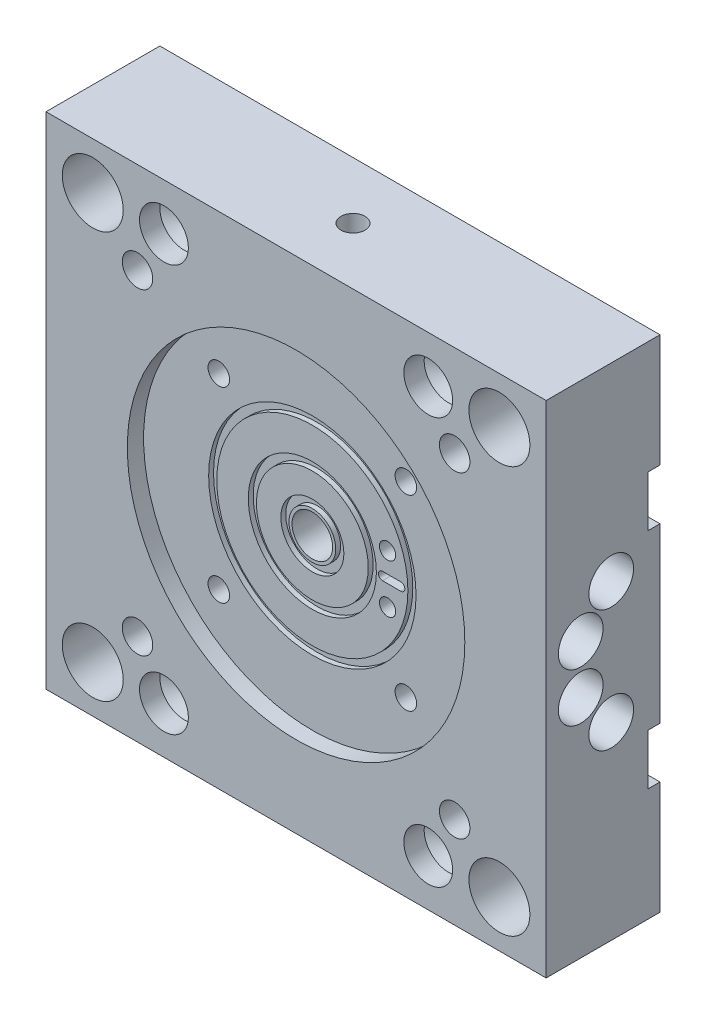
ISO-10303-21;
HEADER;
FILE_DESCRIPTION(('STEP AP214'),'2;1');
FILE_NAME('part.step','',(''),(''),'','','');
FILE_SCHEMA(('AUTOMOTIVE_DESIGN { 1 0 10303 214 1 1 1 1 }'));
ENDSEC;
DATA;
#1=APPLICATION_CONTEXT('core data for automotive mechanical design processes');
#2=APPLICATION_PROTOCOL_DEFINITION('international standard','automotive_design',2000,#1);
#3=PRODUCT_CONTEXT('',#1,'mechanical');
#4=PRODUCT('Part','Part','',(#3));
#5=PRODUCT_RELATED_PRODUCT_CATEGORY('part','',(#4));
#6=PRODUCT_DEFINITION_FORMATION('','',#4);
#7=PRODUCT_DEFINITION_CONTEXT('part definition',#1,'design');
#8=PRODUCT_DEFINITION('design','',#6,#7);
#9=PRODUCT_DEFINITION_SHAPE('','',#8);
#10=(LENGTH_UNIT() NAMED_UNIT(*) SI_UNIT(.MILLI.,.METRE.));
#11=(NAMED_UNIT(*) PLANE_ANGLE_UNIT() SI_UNIT($,.RADIAN.));
#12=(NAMED_UNIT(*) SI_UNIT($,.STERADIAN.) SOLID_ANGLE_UNIT());
#13=UNCERTAINTY_MEASURE_WITH_UNIT(LENGTH_MEASURE(1.E-05),#10,'distance_accuracy_value','');
#14=(GEOMETRIC_REPRESENTATION_CONTEXT(3) GLOBAL_UNCERTAINTY_ASSIGNED_CONTEXT((#13)) GLOBAL_UNIT_ASSIGNED_CONTEXT((#10,
#11,#12)) REPRESENTATION_CONTEXT('',''));
#15=CARTESIAN_POINT('',(0.,0.,0.));
#16=DIRECTION('',(0.,0.,1.));
#17=DIRECTION('',(1.,0.,0.));
#18=AXIS2_PLACEMENT_3D('',#15,#16,#17);
#19=CARTESIAN_POINT('',(0.,0.,-13.));
#20=DIRECTION('',(0.,0.,1.));
#21=DIRECTION('',(1.,0.,0.));
#22=AXIS2_PLACEMENT_3D('',#19,#20,#21);
#23=PLANE('',#22);
#24=CARTESIAN_POINT('',(43.5,0.,-13.));
#25=DIRECTION('',(0.,0.,1.));
#26=DIRECTION('',(1.,0.,0.));
#27=AXIS2_PLACEMENT_3D('',#24,#25,#26);
#28=CIRCLE('',#27,2.);
#29=CARTESIAN_POINT('',(43.5,-2.,-13.));
#30=VERTEX_POINT('',#29);
#31=CARTESIAN_POINT('',(43.5,2.,-13.));
#32=VERTEX_POINT('',#31);
#33=EDGE_CURVE('E154',#30,#32,#28,.T.);
#34=ORIENTED_EDGE('',*,*,#33,.T.);
#35=DIRECTION('',(1.,0.,0.));
#36=VECTOR('',#35,1.);
#37=CARTESIAN_POINT('',(34.5,2.,-13.));
#38=LINE('',#37,#36);
#39=CARTESIAN_POINT('',(34.5,2.,-13.));
#40=VERTEX_POINT('',#39);
#41=EDGE_CURVE('E175',#32,#40,#38,.F.);
#42=ORIENTED_EDGE('',*,*,#41,.T.);
#43=CARTESIAN_POINT('',(34.5,0.,-13.));
#44=DIRECTION('',(0.,0.,1.));
#45=DIRECTION('',(1.,0.,0.));
#46=AXIS2_PLACEMENT_3D('',#43,#44,#45);
#47=CIRCLE('',#46,2.);
#48=CARTESIAN_POINT('',(34.5,-2.,-13.));
#49=VERTEX_POINT('',#48);
#50=EDGE_CURVE('E170',#40,#49,#47,.T.);
#51=ORIENTED_EDGE('',*,*,#50,.T.);
#52=DIRECTION('',(1.,0.,0.));
#53=VECTOR('',#52,1.);
#54=CARTESIAN_POINT('',(43.5,-2.,-13.));
#55=LINE('',#54,#53);
#56=EDGE_CURVE('E164',#49,#30,#55,.T.);
#57=ORIENTED_EDGE('',*,*,#56,.T.);
#58=EDGE_LOOP('',(#34,#42,#51,#57));
#59=FACE_BOUND('',#58,.T.);
#60=ADVANCED_FACE('F17',(#59),#23,.T.);
#61=CARTESIAN_POINT('',(0.,0.,-10.3999999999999));
#62=DIRECTION('',(0.,0.,1.));
#63=DIRECTION('',(1.,0.,0.));
#64=AXIS2_PLACEMENT_3D('',#61,#62,#63);
#65=PLANE('',#64);
#66=CARTESIAN_POINT('',(0.,0.,-10.3999999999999));
#67=DIRECTION('',(0.,0.,1.));
#68=DIRECTION('',(1.,0.,0.));
#69=AXIS2_PLACEMENT_3D('',#66,#67,#68);
#70=CIRCLE('',#69,27.5);
#71=CARTESIAN_POINT('',(27.5,0.,-10.3999999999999));
#72=VERTEX_POINT('',#71);
#73=EDGE_CURVE('E21',#72,#72,#70,.T.);
#74=ORIENTED_EDGE('',*,*,#73,.F.);
#75=EDGE_LOOP('',(#74));
#76=FACE_BOUND('',#75,.T.);
#77=CARTESIAN_POINT('',(0.,0.,-10.3999999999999));
#78=DIRECTION('',(0.,0.,1.));
#79=DIRECTION('',(1.,0.,0.));
#80=AXIS2_PLACEMENT_3D('',#77,#78,#79);
#81=CIRCLE('',#80,31.5);
#82=CARTESIAN_POINT('',(31.5,0.,-10.3999999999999));
#83=VERTEX_POINT('',#82);
#84=EDGE_CURVE('E967',#83,#83,#81,.T.);
#85=ORIENTED_EDGE('',*,*,#84,.T.);
#86=EDGE_LOOP('',(#85));
#87=FACE_BOUND('',#86,.T.);
#88=ADVANCED_FACE('F1927',(#76,#87),#65,.T.);
#89=CARTESIAN_POINT('',(0.,0.,-9.19999999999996));
#90=DIRECTION('',(0.,0.,1.));
#91=DIRECTION('',(1.,0.,0.));
#92=AXIS2_PLACEMENT_3D('',#89,#90,#91);
#93=CYLINDRICAL_SURFACE('',#92,27.5);
#94=CARTESIAN_POINT('',(0.,0.,-7.99999999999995));
#95=DIRECTION('',(0.,0.,1.));
#96=DIRECTION('',(1.,0.,0.));
#97=AXIS2_PLACEMENT_3D('',#94,#95,#96);
#98=CIRCLE('',#97,27.5);
#99=CARTESIAN_POINT('',(27.5,0.,-7.99999999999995));
#100=VERTEX_POINT('',#99);
#101=EDGE_CURVE('E974',#100,#100,#98,.T.);
#102=ORIENTED_EDGE('',*,*,#101,.F.);
#103=EDGE_LOOP('',(#102));
#104=FACE_BOUND('',#103,.T.);
#105=ORIENTED_EDGE('',*,*,#73,.T.);
#106=EDGE_LOOP('',(#105));
#107=FACE_BOUND('',#106,.T.);
#108=ADVANCED_FACE('F1929',(#104,#107),#93,.T.);
#109=CARTESIAN_POINT('',(43.5,0.,-10.5));
#110=DIRECTION('',(0.,0.,1.));
#111=DIRECTION('',(1.,0.,0.));
#112=AXIS2_PLACEMENT_3D('',#109,#110,#111);
#113=CYLINDRICAL_SURFACE('',#112,2.);
#114=CARTESIAN_POINT('',(43.5,0.,-8.00000000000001));
#115=DIRECTION('',(0.,0.,1.));
#116=DIRECTION('',(1.,0.,0.));
#117=AXIS2_PLACEMENT_3D('',#114,#115,#116);
#118=CIRCLE('',#117,2.);
#119=CARTESIAN_POINT('',(43.5,2.,-8.00000000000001));
#120=VERTEX_POINT('',#119);
#121=CARTESIAN_POINT('',(43.5,-2.,-7.99999999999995));
#122=VERTEX_POINT('',#121);
#123=EDGE_CURVE('E977',#120,#122,#118,.F.);
#124=ORIENTED_EDGE('',*,*,#123,.F.);
#125=DIRECTION('',(0.,0.,1.));
#126=VECTOR('',#125,1.);
#127=CARTESIAN_POINT('',(43.5,2.,-8.00000000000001));
#128=LINE('',#127,#126);
#129=EDGE_CURVE('E160',#120,#32,#128,.F.);
#130=ORIENTED_EDGE('',*,*,#129,.T.);
#131=ORIENTED_EDGE('',*,*,#33,.F.);
#132=DIRECTION('',(0.,0.,-1.));
#133=VECTOR('',#132,1.);
#134=CARTESIAN_POINT('',(43.5,-2.,-7.99999999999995));
#135=LINE('',#134,#133);
#136=EDGE_CURVE('E158',#30,#122,#135,.F.);
#137=ORIENTED_EDGE('',*,*,#136,.T.);
#138=EDGE_LOOP('',(#124,#130,#131,#137));
#139=FACE_BOUND('',#138,.T.);
#140=ADVANCED_FACE('F157',(#139),#113,.F.);
#141=CARTESIAN_POINT('',(43.5,-2.,-7.99999999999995));
#142=DIRECTION('',(0.,-1.,0.));
#143=DIRECTION('',(0.,0.,-1.));
#144=AXIS2_PLACEMENT_3D('',#141,#142,#143);
#145=PLANE('',#144);
#146=DIRECTION('',(1.,0.,0.));
#147=VECTOR('',#146,1.);
#148=CARTESIAN_POINT('',(0.,-2.,-7.99999999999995));
#149=LINE('',#148,#147);
#150=CARTESIAN_POINT('',(34.5,-2.,-8.00000000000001));
#151=VERTEX_POINT('',#150);
#152=EDGE_CURVE('E169',#122,#151,#149,.F.);
#153=ORIENTED_EDGE('',*,*,#152,.F.);
#154=ORIENTED_EDGE('',*,*,#136,.F.);
#155=ORIENTED_EDGE('',*,*,#56,.F.);
#156=DIRECTION('',(0.,0.,1.));
#157=VECTOR('',#156,1.);
#158=CARTESIAN_POINT('',(34.5,-2.,-10.5));
#159=LINE('',#158,#157);
#160=EDGE_CURVE('E968',#49,#151,#159,.T.);
#161=ORIENTED_EDGE('',*,*,#160,.T.);
#162=EDGE_LOOP('',(#153,#154,#155,#161));
#163=FACE_BOUND('',#162,.T.);
#164=ADVANCED_FACE('F166',(#163),#145,.F.);
#165=CARTESIAN_POINT('',(34.5,0.,-10.5));
#166=DIRECTION('',(0.,0.,1.));
#167=DIRECTION('',(1.,0.,0.));
#168=AXIS2_PLACEMENT_3D('',#165,#166,#167);
#169=CYLINDRICAL_SURFACE('',#168,2.);
#170=CARTESIAN_POINT('',(34.5,0.,-8.00000000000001));
#171=DIRECTION('',(0.,0.,1.));
#172=DIRECTION('',(1.,0.,0.));
#173=AXIS2_PLACEMENT_3D('',#170,#171,#172);
#174=CIRCLE('',#173,2.);
#175=CARTESIAN_POINT('',(34.5,2.,-8.00000000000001));
#176=VERTEX_POINT('',#175);
#177=EDGE_CURVE('E979',#151,#176,#174,.F.);
#178=ORIENTED_EDGE('',*,*,#177,.F.);
#179=ORIENTED_EDGE('',*,*,#160,.F.);
#180=ORIENTED_EDGE('',*,*,#50,.F.);
#181=DIRECTION('',(0.,0.,1.));
#182=VECTOR('',#181,1.);
#183=CARTESIAN_POINT('',(34.5,2.,-8.00000000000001));
#184=LINE('',#183,#182);
#185=EDGE_CURVE('E963',#40,#176,#184,.T.);
#186=ORIENTED_EDGE('',*,*,#185,.T.);
#187=EDGE_LOOP('',(#178,#179,#180,#186));
#188=FACE_BOUND('',#187,.T.);
#189=ADVANCED_FACE('F1909',(#188),#169,.F.);
#190=CARTESIAN_POINT('',(34.5,2.,-8.00000000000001));
#191=DIRECTION('',(0.,1.,0.));
#192=DIRECTION('',(0.,0.,1.));
#193=AXIS2_PLACEMENT_3D('',#190,#191,#192);
#194=PLANE('',#193);
#195=DIRECTION('',(1.,0.,0.));
#196=VECTOR('',#195,1.);
#197=CARTESIAN_POINT('',(0.,2.,-7.99999999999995));
#198=LINE('',#197,#196);
#199=EDGE_CURVE('E981',#176,#120,#198,.T.);
#200=ORIENTED_EDGE('',*,*,#199,.F.);
#201=ORIENTED_EDGE('',*,*,#185,.F.);
#202=ORIENTED_EDGE('',*,*,#41,.F.);
#203=ORIENTED_EDGE('',*,*,#129,.F.);
#204=EDGE_LOOP('',(#200,#201,#202,#203));
#205=FACE_BOUND('',#204,.T.);
#206=ADVANCED_FACE('F1906',(#205),#194,.F.);
#207=CARTESIAN_POINT('',(0.,0.,-9.19999999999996));
#208=DIRECTION('',(0.,0.,1.));
#209=DIRECTION('',(1.,0.,0.));
#210=AXIS2_PLACEMENT_3D('',#207,#208,#209);
#211=CYLINDRICAL_SURFACE('',#210,31.5);
#212=CARTESIAN_POINT('',(0.,0.,-7.99999999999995));
#213=DIRECTION('',(0.,0.,1.));
#214=DIRECTION('',(1.,0.,0.));
#215=AXIS2_PLACEMENT_3D('',#212,#213,#214);
#216=CIRCLE('',#215,31.5);
#217=CARTESIAN_POINT('',(31.5,0.,-7.99999999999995));
#218=VERTEX_POINT('',#217);
#219=EDGE_CURVE('E982',#218,#218,#216,.F.);
#220=ORIENTED_EDGE('',*,*,#219,.F.);
#221=EDGE_LOOP('',(#220));
#222=FACE_BOUND('',#221,.T.);
#223=ORIENTED_EDGE('',*,*,#84,.F.);
#224=EDGE_LOOP('',(#223));
#225=FACE_BOUND('',#224,.T.);
#226=ADVANCED_FACE('F1277',(#222,#225),#211,.F.);
#227=CARTESIAN_POINT('',(0.,0.,-7.99999999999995));
#228=DIRECTION('',(0.,0.,1.));
#229=DIRECTION('',(1.,0.,0.));
#230=AXIS2_PLACEMENT_3D('',#227,#228,#229);
#231=PLANE('',#230);
#232=CARTESIAN_POINT('',(0.,0.,-7.99999999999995));
#233=DIRECTION('',(0.,0.,1.));
#234=DIRECTION('',(1.,0.,0.));
#235=AXIS2_PLACEMENT_3D('',#232,#233,#234);
#236=CIRCLE('',#235,15.5);
#237=CARTESIAN_POINT('',(15.5,0.,-7.99999999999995));
#238=VERTEX_POINT('',#237);
#239=EDGE_CURVE('E985',#238,#238,#236,.F.);
#240=ORIENTED_EDGE('',*,*,#239,.T.);
#241=EDGE_LOOP('',(#240));
#242=FACE_BOUND('',#241,.T.);
#243=ORIENTED_EDGE('',*,*,#101,.T.);
#244=EDGE_LOOP('',(#243));
#245=FACE_BOUND('',#244,.T.);
#246=ADVANCED_FACE('F1267',(#242,#245),#231,.T.);
#247=CARTESIAN_POINT('',(37.,-12.,-21.0000000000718));
#248=DIRECTION('',(0.,0.,1.));
#249=DIRECTION('',(1.,0.,0.));
#250=AXIS2_PLACEMENT_3D('',#247,#248,#249);
#251=CONICAL_SURFACE('',#250,4.00000000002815,1.04719755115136);
#252=CARTESIAN_POINT('',(37.,-12.,-20.9999999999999));
#253=DIRECTION('',(0.,0.,-1.));
#254=DIRECTION('',(-1.,0.,0.));
#255=AXIS2_PLACEMENT_3D('',#252,#253,#254);
#256=CIRCLE('',#255,4.);
#257=CARTESIAN_POINT('',(41.,-12.,-20.9999999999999));
#258=VERTEX_POINT('',#257);
#259=EDGE_CURVE('E956',#258,#258,#256,.F.);
#260=ORIENTED_EDGE('',*,*,#259,.T.);
#261=EDGE_LOOP('',(#260));
#262=FACE_BOUND('',#261,.T.);
#263=CARTESIAN_POINT('',(36.9999999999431,-12.,-23.3094010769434));
#264=VERTEX_POINT('',#263);
#265=VERTEX_LOOP('',#264);
#266=FACE_BOUND('',#265,.T.);
#267=ADVANCED_FACE('F1264',(#262,#266),#251,.F.);
#268=CARTESIAN_POINT('',(37.,12.,-21.0000000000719));
#269=DIRECTION('',(0.,0.,1.));
#270=DIRECTION('',(1.,0.,0.));
#271=AXIS2_PLACEMENT_3D('',#268,#269,#270);
#272=CONICAL_SURFACE('',#271,4.00000000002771,1.04719755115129);
#273=CARTESIAN_POINT('',(37.,12.,-21.));
#274=DIRECTION('',(0.,0.,-1.));
#275=DIRECTION('',(-1.,0.,0.));
#276=AXIS2_PLACEMENT_3D('',#273,#274,#275);
#277=CIRCLE('',#276,4.);
#278=CARTESIAN_POINT('',(41.,12.,-21.));
#279=VERTEX_POINT('',#278);
#280=EDGE_CURVE('E959',#279,#279,#277,.F.);
#281=ORIENTED_EDGE('',*,*,#280,.T.);
#282=EDGE_LOOP('',(#281));
#283=FACE_BOUND('',#282,.T.);
#284=CARTESIAN_POINT('',(37.0000000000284,11.9999999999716,-23.3094010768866));
#285=VERTEX_POINT('',#284);
#286=VERTEX_LOOP('',#285);
#287=FACE_BOUND('',#286,.T.);
#288=ADVANCED_FACE('F1266',(#283,#287),#272,.F.);
#289=CARTESIAN_POINT('',(0.,0.,-7.99999999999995));
#290=DIRECTION('',(0.,0.,1.));
#291=DIRECTION('',(1.,0.,0.));
#292=AXIS2_PLACEMENT_3D('',#289,#290,#291);
#293=PLANE('',#292);
#294=ORIENTED_EDGE('',*,*,#219,.T.);
#295=EDGE_LOOP('',(#294));
#296=FACE_BOUND('',#295,.T.);
#297=CARTESIAN_POINT('',(37.,-12.,-7.99999999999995));
#298=DIRECTION('',(0.,0.,-1.));
#299=DIRECTION('',(-1.,0.,0.));
#300=AXIS2_PLACEMENT_3D('',#297,#298,#299);
#301=CIRCLE('',#300,4.);
#302=CARTESIAN_POINT('',(33.,-12.,-7.99999999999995));
#303=VERTEX_POINT('',#302);
#304=EDGE_CURVE('E960',#303,#303,#301,.T.);
#305=ORIENTED_EDGE('',*,*,#304,.T.);
#306=EDGE_LOOP('',(#305));
#307=FACE_BOUND('',#306,.T.);
#308=CARTESIAN_POINT('',(37.,12.,-8.00000000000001));
#309=DIRECTION('',(0.,0.,-1.));
#310=DIRECTION('',(-1.,0.,0.));
#311=AXIS2_PLACEMENT_3D('',#308,#309,#310);
#312=CIRCLE('',#311,4.);
#313=CARTESIAN_POINT('',(33.,12.,-8.00000000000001));
#314=VERTEX_POINT('',#313);
#315=EDGE_CURVE('E990',#314,#314,#312,.T.);
#316=ORIENTED_EDGE('',*,*,#315,.T.);
#317=EDGE_LOOP('',(#316));
#318=FACE_BOUND('',#317,.T.);
#319=ORIENTED_EDGE('',*,*,#177,.T.);
#320=ORIENTED_EDGE('',*,*,#199,.T.);
#321=ORIENTED_EDGE('',*,*,#123,.T.);
#322=ORIENTED_EDGE('',*,*,#152,.T.);
#323=EDGE_LOOP('',(#319,#320,#321,#322));
#324=FACE_BOUND('',#323,.T.);
#325=CARTESIAN_POINT('',(0.,0.,-7.99999999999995));
#326=DIRECTION('',(0.,0.,1.));
#327=DIRECTION('',(1.,0.,0.));
#328=AXIS2_PLACEMENT_3D('',#325,#326,#327);
#329=CIRCLE('',#328,47.);
#330=CARTESIAN_POINT('',(47.,0.,-7.99999999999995));
#331=VERTEX_POINT('',#330);
#332=EDGE_CURVE('E993',#331,#331,#329,.F.);
#333=ORIENTED_EDGE('',*,*,#332,.F.);
#334=EDGE_LOOP('',(#333));
#335=FACE_BOUND('',#334,.T.);
#336=ADVANCED_FACE('F1274',(#296,#307,#318,#324,#335),#293,.T.);
#337=CARTESIAN_POINT('',(0.,0.,-9.19999999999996));
#338=DIRECTION('',(0.,0.,1.));
#339=DIRECTION('',(1.,0.,0.));
#340=AXIS2_PLACEMENT_3D('',#337,#338,#339);
#341=CYLINDRICAL_SURFACE('',#340,15.5);
#342=ORIENTED_EDGE('',*,*,#239,.F.);
#343=EDGE_LOOP('',(#342));
#344=FACE_BOUND('',#343,.T.);
#345=CARTESIAN_POINT('',(0.,0.,-10.3999999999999));
#346=DIRECTION('',(0.,0.,1.));
#347=DIRECTION('',(1.,0.,0.));
#348=AXIS2_PLACEMENT_3D('',#345,#346,#347);
#349=CIRCLE('',#348,15.5);
#350=CARTESIAN_POINT('',(15.5,0.,-10.3999999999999));
#351=VERTEX_POINT('',#350);
#352=EDGE_CURVE('E996',#351,#351,#349,.T.);
#353=ORIENTED_EDGE('',*,*,#352,.F.);
#354=EDGE_LOOP('',(#353));
#355=FACE_BOUND('',#354,.T.);
#356=ADVANCED_FACE('F1284',(#344,#355),#341,.F.);
#357=CARTESIAN_POINT('',(37.,-12.,-8.09999999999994));
#358=DIRECTION('',(0.,0.,-1.));
#359=DIRECTION('',(-1.,0.,0.));
#360=AXIS2_PLACEMENT_3D('',#357,#358,#359);
#361=CYLINDRICAL_SURFACE('',#360,4.);
#362=ORIENTED_EDGE('',*,*,#304,.F.);
#363=EDGE_LOOP('',(#362));
#364=FACE_BOUND('',#363,.T.);
#365=CARTESIAN_POINT('',(37.,-12.,-16.9999999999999));
#366=DIRECTION('',(0.707106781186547,0.,-0.707106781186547));
#367=DIRECTION('',(-0.707106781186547,0.,-0.707106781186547));
#368=AXIS2_PLACEMENT_3D('',#365,#366,#367);
#369=ELLIPSE('',#368,5.65685424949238,4.);
#370=CARTESIAN_POINT('',(37.,-8.,-17.));
#371=VERTEX_POINT('',#370);
#372=CARTESIAN_POINT('',(37.,-16.,-17.));
#373=VERTEX_POINT('',#372);
#374=EDGE_CURVE('E1005',#371,#373,#369,.T.);
#375=ORIENTED_EDGE('',*,*,#374,.T.);
#376=CARTESIAN_POINT('',(37.,-12.,-16.9999999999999));
#377=DIRECTION('',(-0.707106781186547,0.,-0.707106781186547));
#378=DIRECTION('',(0.707106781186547,0.,-0.707106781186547));
#379=AXIS2_PLACEMENT_3D('',#376,#377,#378);
#380=ELLIPSE('',#379,5.65685424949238,4.);
#381=EDGE_CURVE('E999',#373,#258,#380,.F.);
#382=ORIENTED_EDGE('',*,*,#381,.T.);
#383=ORIENTED_EDGE('',*,*,#259,.F.);
#384=CARTESIAN_POINT('',(37.,-12.,-16.9999999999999));
#385=DIRECTION('',(-0.707106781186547,0.,-0.707106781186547));
#386=DIRECTION('',(0.707106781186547,0.,-0.707106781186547));
#387=AXIS2_PLACEMENT_3D('',#384,#385,#386);
#388=ELLIPSE('',#387,5.65685424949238,4.);
#389=EDGE_CURVE('E1002',#258,#371,#388,.F.);
#390=ORIENTED_EDGE('',*,*,#389,.T.);
#391=EDGE_LOOP('',(#375,#382,#383,#390));
#392=FACE_BOUND('',#391,.T.);
#393=ADVANCED_FACE('F1288',(#364,#392),#361,.F.);
#394=CARTESIAN_POINT('',(37.,12.,-8.1));
#395=DIRECTION('',(0.,0.,-1.));
#396=DIRECTION('',(-1.,0.,0.));
#397=AXIS2_PLACEMENT_3D('',#394,#395,#396);
#398=CYLINDRICAL_SURFACE('',#397,4.);
#399=ORIENTED_EDGE('',*,*,#315,.F.);
#400=EDGE_LOOP('',(#399));
#401=FACE_BOUND('',#400,.T.);
#402=CARTESIAN_POINT('',(37.,12.,-17.));
#403=DIRECTION('',(-0.707106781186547,0.,-0.707106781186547));
#404=DIRECTION('',(0.707106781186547,0.,-0.707106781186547));
#405=AXIS2_PLACEMENT_3D('',#402,#403,#404);
#406=ELLIPSE('',#405,5.65685424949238,4.);
#407=CARTESIAN_POINT('',(37.,16.,-17.));
#408=VERTEX_POINT('',#407);
#409=EDGE_CURVE('E1014',#279,#408,#406,.F.);
#410=ORIENTED_EDGE('',*,*,#409,.T.);
#411=CARTESIAN_POINT('',(37.,12.,-17.));
#412=DIRECTION('',(0.707106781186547,0.,-0.707106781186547));
#413=DIRECTION('',(-0.707106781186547,0.,-0.707106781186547));
#414=AXIS2_PLACEMENT_3D('',#411,#412,#413);
#415=ELLIPSE('',#414,5.65685424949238,4.);
#416=CARTESIAN_POINT('',(37.,8.,-17.));
#417=VERTEX_POINT('',#416);
#418=EDGE_CURVE('E1008',#408,#417,#415,.T.);
#419=ORIENTED_EDGE('',*,*,#418,.T.);
#420=CARTESIAN_POINT('',(37.,12.,-17.));
#421=DIRECTION('',(-0.707106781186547,0.,-0.707106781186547));
#422=DIRECTION('',(0.707106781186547,0.,-0.707106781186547));
#423=AXIS2_PLACEMENT_3D('',#420,#421,#422);
#424=ELLIPSE('',#423,5.65685424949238,4.);
#425=EDGE_CURVE('E1011',#417,#279,#424,.F.);
#426=ORIENTED_EDGE('',*,*,#425,.T.);
#427=ORIENTED_EDGE('',*,*,#280,.F.);
#428=EDGE_LOOP('',(#410,#419,#426,#427));
#429=FACE_BOUND('',#428,.T.);
#430=ADVANCED_FACE('F1292',(#401,#429),#398,.F.);
#431=CARTESIAN_POINT('',(0.,0.,-9.19999999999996));
#432=DIRECTION('',(0.,0.,1.));
#433=DIRECTION('',(1.,0.,0.));
#434=AXIS2_PLACEMENT_3D('',#431,#432,#433);
#435=CYLINDRICAL_SURFACE('',#434,47.);
#436=ORIENTED_EDGE('',*,*,#332,.T.);
#437=EDGE_LOOP('',(#436));
#438=FACE_BOUND('',#437,.T.);
#439=CARTESIAN_POINT('',(0.,0.,-10.3999999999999));
#440=DIRECTION('',(0.,0.,1.));
#441=DIRECTION('',(1.,0.,0.));
#442=AXIS2_PLACEMENT_3D('',#439,#440,#441);
#443=CIRCLE('',#442,47.);
#444=CARTESIAN_POINT('',(47.,0.,-10.3999999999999));
#445=VERTEX_POINT('',#444);
#446=EDGE_CURVE('E1017',#445,#445,#443,.F.);
#447=ORIENTED_EDGE('',*,*,#446,.F.);
#448=EDGE_LOOP('',(#447));
#449=FACE_BOUND('',#448,.T.);
#450=ADVANCED_FACE('F1296',(#438,#449),#435,.T.);
#451=CARTESIAN_POINT('',(0.,0.,-10.3999999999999));
#452=DIRECTION('',(0.,0.,1.));
#453=DIRECTION('',(1.,0.,0.));
#454=AXIS2_PLACEMENT_3D('',#451,#452,#453);
#455=PLANE('',#454);
#456=CARTESIAN_POINT('',(0.,0.,-10.3999999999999));
#457=DIRECTION('',(0.,0.,1.));
#458=DIRECTION('',(1.,0.,0.));
#459=AXIS2_PLACEMENT_3D('',#456,#457,#458);
#460=CIRCLE('',#459,11.5);
#461=CARTESIAN_POINT('',(11.5,0.,-10.3999999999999));
#462=VERTEX_POINT('',#461);
#463=EDGE_CURVE('E955',#462,#462,#460,.T.);
#464=ORIENTED_EDGE('',*,*,#463,.F.);
#465=EDGE_LOOP('',(#464));
#466=FACE_BOUND('',#465,.T.);
#467=ORIENTED_EDGE('',*,*,#352,.T.);
#468=EDGE_LOOP('',(#467));
#469=FACE_BOUND('',#468,.T.);
#470=ADVANCED_FACE('F1300',(#466,#469),#455,.T.);
#471=CARTESIAN_POINT('',(0.,36.9999999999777,-31.9999999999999));
#472=DIRECTION('',(0.,-1.,0.));
#473=DIRECTION('',(0.,0.,-1.));
#474=AXIS2_PLACEMENT_3D('',#471,#472,#473);
#475=CONICAL_SURFACE('',#474,4.00000000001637,1.04719755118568);
#476=CARTESIAN_POINT('',(0.,37.,-31.9999999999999));
#477=DIRECTION('',(0.,1.,0.));
#478=DIRECTION('',(0.,0.,1.));
#479=AXIS2_PLACEMENT_3D('',#476,#477,#478);
#480=CIRCLE('',#479,4.);
#481=CARTESIAN_POINT('',(0.,37.,-27.9999999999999));
#482=VERTEX_POINT('',#481);
#483=EDGE_CURVE('E951',#482,#482,#480,.F.);
#484=ORIENTED_EDGE('',*,*,#483,.T.);
#485=EDGE_LOOP('',(#484));
#486=FACE_BOUND('',#485,.T.);
#487=CARTESIAN_POINT('',(0.,39.3094010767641,-31.9999999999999));
#488=VERTEX_POINT('',#487);
#489=VERTEX_LOOP('',#488);
#490=FACE_BOUND('',#489,.T.);
#491=ADVANCED_FACE('F1304',(#486,#490),#475,.F.);
#492=CARTESIAN_POINT('',(99.9,-12.,-16.9999999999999));
#493=DIRECTION('',(-1.,0.,0.));
#494=DIRECTION('',(0.,0.,1.));
#495=AXIS2_PLACEMENT_3D('',#492,#493,#494);
#496=CYLINDRICAL_SURFACE('',#495,4.);
#497=CARTESIAN_POINT('',(87.,-12.,-16.9999999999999));
#498=DIRECTION('',(-1.,0.,0.));
#499=DIRECTION('',(0.,0.,1.));
#500=AXIS2_PLACEMENT_3D('',#497,#498,#499);
#501=CIRCLE('',#500,4.);
#502=CARTESIAN_POINT('',(87.,-12.,-12.9999999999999));
#503=VERTEX_POINT('',#502);
#504=EDGE_CURVE('E1026',#503,#503,#501,.F.);
#505=ORIENTED_EDGE('',*,*,#504,.T.);
#506=EDGE_LOOP('',(#505));
#507=FACE_BOUND('',#506,.T.);
#508=ORIENTED_EDGE('',*,*,#374,.F.);
#509=ORIENTED_EDGE('',*,*,#389,.F.);
#510=ORIENTED_EDGE('',*,*,#381,.F.);
#511=EDGE_LOOP('',(#508,#509,#510));
#512=FACE_BOUND('',#511,.T.);
#513=ADVANCED_FACE('F1308',(#507,#512),#496,.F.);
#514=CARTESIAN_POINT('',(99.9,12.,-17.));
#515=DIRECTION('',(-1.,0.,0.));
#516=DIRECTION('',(0.,0.,1.));
#517=AXIS2_PLACEMENT_3D('',#514,#515,#516);
#518=CYLINDRICAL_SURFACE('',#517,4.);
#519=CARTESIAN_POINT('',(87.,12.,-17.));
#520=DIRECTION('',(-1.,0.,0.));
#521=DIRECTION('',(0.,0.,1.));
#522=AXIS2_PLACEMENT_3D('',#519,#520,#521);
#523=CIRCLE('',#522,4.);
#524=CARTESIAN_POINT('',(87.,12.,-13.));
#525=VERTEX_POINT('',#524);
#526=EDGE_CURVE('E1029',#525,#525,#523,.F.);
#527=ORIENTED_EDGE('',*,*,#526,.T.);
#528=EDGE_LOOP('',(#527));
#529=FACE_BOUND('',#528,.T.);
#530=ORIENTED_EDGE('',*,*,#425,.F.);
#531=ORIENTED_EDGE('',*,*,#418,.F.);
#532=ORIENTED_EDGE('',*,*,#409,.F.);
#533=EDGE_LOOP('',(#530,#531,#532));
#534=FACE_BOUND('',#533,.T.);
#535=ADVANCED_FACE('F1312',(#529,#534),#518,.F.);
#536=CARTESIAN_POINT('',(99.9,30.,-32.));
#537=DIRECTION('',(-1.,0.,0.));
#538=DIRECTION('',(0.,0.,1.));
#539=AXIS2_PLACEMENT_3D('',#536,#537,#538);
#540=CYLINDRICAL_SURFACE('',#539,4.);
#541=CARTESIAN_POINT('',(87.,30.,-32.));
#542=DIRECTION('',(-1.,0.,0.));
#543=DIRECTION('',(0.,0.,1.));
#544=AXIS2_PLACEMENT_3D('',#541,#542,#543);
#545=CIRCLE('',#544,4.);
#546=CARTESIAN_POINT('',(87.,30.,-28.));
#547=VERTEX_POINT('',#546);
#548=EDGE_CURVE('E1032',#547,#547,#545,.F.);
#549=ORIENTED_EDGE('',*,*,#548,.T.);
#550=EDGE_LOOP('',(#549));
#551=FACE_BOUND('',#550,.T.);
#552=CARTESIAN_POINT('',(0.,30.,-32.));
#553=DIRECTION('',(-0.707106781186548,-0.707106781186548,0.));
#554=DIRECTION('',(-0.707106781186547,0.707106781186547,0.));
#555=AXIS2_PLACEMENT_3D('',#552,#553,#554);
#556=ELLIPSE('',#555,5.65685424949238,4.);
#557=CARTESIAN_POINT('',(0.,30.,-36.));
#558=VERTEX_POINT('',#557);
#559=CARTESIAN_POINT('',(0.,30.,-28.));
#560=VERTEX_POINT('',#559);
#561=EDGE_CURVE('E1024',#558,#560,#556,.T.);
#562=ORIENTED_EDGE('',*,*,#561,.T.);
#563=CARTESIAN_POINT('',(0.,30.,-32.));
#564=DIRECTION('',(-0.707106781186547,0.707106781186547,0.));
#565=DIRECTION('',(-0.707106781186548,-0.707106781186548,0.));
#566=AXIS2_PLACEMENT_3D('',#563,#564,#565);
#567=ELLIPSE('',#566,5.65685424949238,4.);
#568=EDGE_CURVE('E954',#560,#558,#567,.T.);
#569=ORIENTED_EDGE('',*,*,#568,.T.);
#570=EDGE_LOOP('',(#562,#569));
#571=FACE_BOUND('',#570,.T.);
#572=ADVANCED_FACE('F1316',(#551,#571),#540,.F.);
#573=CARTESIAN_POINT('',(0.,0.,-10.3999999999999));
#574=DIRECTION('',(0.,0.,1.));
#575=DIRECTION('',(1.,0.,0.));
#576=AXIS2_PLACEMENT_3D('',#573,#574,#575);
#577=PLANE('',#576);
#578=ORIENTED_EDGE('',*,*,#446,.T.);
#579=EDGE_LOOP('',(#578));
#580=FACE_BOUND('',#579,.T.);
#581=CARTESIAN_POINT('',(0.,0.,-10.3999999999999));
#582=DIRECTION('',(0.,0.,1.));
#583=DIRECTION('',(1.,0.,0.));
#584=AXIS2_PLACEMENT_3D('',#581,#582,#583);
#585=CIRCLE('',#584,51.);
#586=CARTESIAN_POINT('',(51.,0.,-10.3999999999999));
#587=VERTEX_POINT('',#586);
#588=EDGE_CURVE('E1035',#587,#587,#585,.T.);
#589=ORIENTED_EDGE('',*,*,#588,.T.);
#590=EDGE_LOOP('',(#589));
#591=FACE_BOUND('',#590,.T.);
#592=ADVANCED_FACE('F1319',(#580,#591),#577,.T.);
#593=CARTESIAN_POINT('',(0.,0.,-9.19999999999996));
#594=DIRECTION('',(0.,0.,1.));
#595=DIRECTION('',(1.,0.,0.));
#596=AXIS2_PLACEMENT_3D('',#593,#594,#595);
#597=CYLINDRICAL_SURFACE('',#596,11.5);
#598=CARTESIAN_POINT('',(0.,0.,-7.99999999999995));
#599=DIRECTION('',(0.,0.,1.));
#600=DIRECTION('',(1.,0.,0.));
#601=AXIS2_PLACEMENT_3D('',#598,#599,#600);
#602=CIRCLE('',#601,11.5);
#603=CARTESIAN_POINT('',(11.5,0.,-7.99999999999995));
#604=VERTEX_POINT('',#603);
#605=EDGE_CURVE('E1038',#604,#604,#602,.T.);
#606=ORIENTED_EDGE('',*,*,#605,.F.);
#607=EDGE_LOOP('',(#606));
#608=FACE_BOUND('',#607,.T.);
#609=ORIENTED_EDGE('',*,*,#463,.T.);
#610=EDGE_LOOP('',(#609));
#611=FACE_BOUND('',#610,.T.);
#612=ADVANCED_FACE('F1055',(#608,#611),#597,.T.);
#613=CARTESIAN_POINT('',(0.,-122.9,-31.9999999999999));
#614=DIRECTION('',(0.,1.,0.));
#615=DIRECTION('',(0.,0.,1.));
#616=AXIS2_PLACEMENT_3D('',#613,#614,#615);
#617=CYLINDRICAL_SURFACE('',#616,4.);
#618=CARTESIAN_POINT('',(-3.51033024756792,9.36363078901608,-30.0822978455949));
#619=CARTESIAN_POINT('',(-3.61119932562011,9.32581839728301,-30.2669506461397));
#620=CARTESIAN_POINT('',(-3.69783921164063,9.29149097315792,-30.4602303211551));
#621=CARTESIAN_POINT('',(-3.83985232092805,9.23371365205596,-30.8596192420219));
#622=CARTESIAN_POINT('',(-3.89521261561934,9.21026825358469,-31.0657337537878));
#623=CARTESIAN_POINT('',(-3.97256011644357,9.17717725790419,-31.4857662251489));
#624=CARTESIAN_POINT('',(-3.99447204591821,9.16756279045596,-31.6997006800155));
#625=CARTESIAN_POINT('',(-4.0036810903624,9.16354591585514,-32.1284086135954));
#626=CARTESIAN_POINT('',(-3.99098783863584,9.16913927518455,-32.3431818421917));
#627=CARTESIAN_POINT('',(-3.93263386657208,9.19430876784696,-32.7596653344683));
#628=CARTESIAN_POINT('',(-3.88813110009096,9.21339351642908,-32.9615703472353));
#629=CARTESIAN_POINT('',(-3.76915069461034,9.26270010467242,-33.354900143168));
#630=CARTESIAN_POINT('',(-3.69466467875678,9.2929250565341,-33.546321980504));
#631=CARTESIAN_POINT('',(-3.51465926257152,9.36252075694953,-33.9214886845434));
#632=CARTESIAN_POINT('',(-3.40805607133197,9.40219865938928,-34.1046547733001));
#633=CARTESIAN_POINT('',(-3.16789767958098,9.48580897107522,-34.4513118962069));
#634=CARTESIAN_POINT('',(-3.03433182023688,9.52974305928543,-34.6147951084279));
#635=CARTESIAN_POINT('',(-2.7322810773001,9.62087828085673,-34.9301502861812));
#636=CARTESIAN_POINT('',(-2.56193428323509,9.66807857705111,-35.0802456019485));
#637=CARTESIAN_POINT('',(-2.19742198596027,9.75738223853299,-35.350036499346));
#638=CARTESIAN_POINT('',(-2.00325497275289,9.79948528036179,-35.4697301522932));
#639=CARTESIAN_POINT('',(-1.59535414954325,9.87410138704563,-35.6751989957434));
#640=CARTESIAN_POINT('',(-1.38157521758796,9.90659157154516,-35.760893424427));
#641=CARTESIAN_POINT('',(-0.941007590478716,9.95809088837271,-35.8945366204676));
#642=CARTESIAN_POINT('',(-0.714225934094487,9.97710724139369,-35.9425056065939));
#643=CARTESIAN_POINT('',(-0.269919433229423,9.99866992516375,-35.9967436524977));
#644=CARTESIAN_POINT('',(-0.0527454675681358,10.002202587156,-36.0055107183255));
#645=CARTESIAN_POINT('',(0.379891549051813,9.99512162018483,-35.987797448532));
#646=CARTESIAN_POINT('',(0.595354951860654,9.98451098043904,-35.9613245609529));
#647=CARTESIAN_POINT('',(1.01119062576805,9.95086097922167,-35.8757066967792));
#648=CARTESIAN_POINT('',(1.21182607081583,9.92824054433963,-35.8176614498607));
#649=CARTESIAN_POINT('',(1.60050285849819,9.87304239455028,-35.6717180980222));
#650=CARTESIAN_POINT('',(1.78853890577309,9.8404605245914,-35.5838075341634));
#651=CARTESIAN_POINT('',(2.15550749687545,9.76679738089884,-35.3764064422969));
#652=CARTESIAN_POINT('',(2.33370105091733,9.72541090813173,-35.2557206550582));
#653=CARTESIAN_POINT('',(2.66788936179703,9.63909511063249,-34.9880036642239));
#654=CARTESIAN_POINT('',(2.82389857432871,9.59416812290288,-34.8409897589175));
#655=CARTESIAN_POINT('',(3.07208606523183,9.51705777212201,-34.5664706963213));
#656=CARTESIAN_POINT('',(3.17016655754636,9.48468553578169,-34.444294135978));
#657=CARTESIAN_POINT('',(3.35159183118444,9.42210339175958,-34.188919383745));
#658=CARTESIAN_POINT('',(3.43493581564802,9.39189360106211,-34.0557205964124));
#659=CARTESIAN_POINT('',(3.61119932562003,9.32581839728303,-33.7330493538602));
#660=CARTESIAN_POINT('',(3.69783921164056,9.29149097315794,-33.5397696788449));
#661=CARTESIAN_POINT('',(3.83985232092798,9.23371365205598,-33.1403807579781));
#662=CARTESIAN_POINT('',(3.89521261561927,9.21026825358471,-32.9342662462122));
#663=CARTESIAN_POINT('',(3.97256011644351,9.1771772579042,-32.5142337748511));
#664=CARTESIAN_POINT('',(3.99447204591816,9.16756279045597,-32.3002993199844));
#665=CARTESIAN_POINT('',(4.00368109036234,9.16354591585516,-31.8715913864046));
#666=CARTESIAN_POINT('',(3.99098783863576,9.16913927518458,-31.6568181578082));
#667=CARTESIAN_POINT('',(3.93263386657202,9.19430876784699,-31.2403346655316));
#668=CARTESIAN_POINT('',(3.88813110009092,9.2133935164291,-31.0384296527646));
#669=CARTESIAN_POINT('',(3.76915069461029,9.26270010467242,-30.645099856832));
#670=CARTESIAN_POINT('',(3.69466467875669,9.29292505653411,-30.4536780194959));
#671=CARTESIAN_POINT('',(3.51465926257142,9.36252075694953,-30.0785113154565));
#672=CARTESIAN_POINT('',(3.40805607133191,9.40219865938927,-29.8953452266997));
#673=CARTESIAN_POINT('',(3.16789767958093,9.48580897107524,-29.548688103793));
#674=CARTESIAN_POINT('',(3.03433182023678,9.52974305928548,-29.385204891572));
#675=CARTESIAN_POINT('',(2.73228107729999,9.62087828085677,-29.0698497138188));
#676=CARTESIAN_POINT('',(2.56193428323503,9.66807857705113,-28.9197543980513));
#677=CARTESIAN_POINT('',(2.19742198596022,9.75738223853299,-28.6499635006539));
#678=CARTESIAN_POINT('',(2.00325497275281,9.79948528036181,-28.5302698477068));
#679=CARTESIAN_POINT('',(1.59535414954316,9.87410138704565,-28.3248010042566));
#680=CARTESIAN_POINT('',(1.3815752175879,9.90659157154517,-28.2391065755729));
#681=CARTESIAN_POINT('',(0.941007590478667,9.95809088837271,-28.1054633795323));
#682=CARTESIAN_POINT('',(0.714225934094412,9.97710724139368,-28.0574943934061));
#683=CARTESIAN_POINT('',(0.269919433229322,9.99866992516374,-28.0032563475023));
#684=CARTESIAN_POINT('',(0.0527454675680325,10.002202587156,-27.9944892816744));
#685=CARTESIAN_POINT('',(-0.379891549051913,9.99512162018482,-28.0122025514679));
#686=CARTESIAN_POINT('',(-0.595354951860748,9.98451098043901,-28.0386754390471));
#687=CARTESIAN_POINT('',(-1.01119062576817,9.95086097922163,-28.1242933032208));
#688=CARTESIAN_POINT('',(-1.21182607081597,9.92824054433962,-28.1823385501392));
#689=CARTESIAN_POINT('',(-1.60050285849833,9.87304239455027,-28.3282819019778));
#690=CARTESIAN_POINT('',(-1.7885389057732,9.84046052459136,-28.4161924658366));
#691=CARTESIAN_POINT('',(-2.15550749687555,9.76679738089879,-28.6235935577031));
#692=CARTESIAN_POINT('',(-2.33370105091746,9.7254109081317,-28.7442793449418));
#693=CARTESIAN_POINT('',(-2.66788936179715,9.63909511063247,-29.011996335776));
#694=CARTESIAN_POINT('',(-2.8238985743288,9.59416812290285,-29.1590102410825));
#695=CARTESIAN_POINT('',(-3.0720860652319,9.51705777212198,-29.4335293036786));
#696=CARTESIAN_POINT('',(-3.17016655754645,9.48468553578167,-29.555705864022));
#697=CARTESIAN_POINT('',(-3.35159183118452,9.42210339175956,-29.8110806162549));
#698=CARTESIAN_POINT('',(-3.4349358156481,9.3918936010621,-29.9442794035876));
#699=CARTESIAN_POINT('',(-3.51033024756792,9.36363078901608,-30.0822978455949));
#700=B_SPLINE_CURVE_WITH_KNOTS('',3,(#618,#619,#620,#621,#622,#623,#624,#625,#626,#627,#628,
#629,#630,#631,#632,#633,#634,#635,#636,#637,#638,#639,#640,#641,#642,#643,#644,#645,#646,#647,
#648,#649,#650,#651,#652,#653,#654,#655,#656,#657,#658,#659,#660,#661,#662,#663,#664,#665,#666,
#667,#668,#669,#670,#671,#672,#673,#674,#675,#676,#677,#678,#679,#680,#681,#682,#683,#684,#685,
#686,#687,#688,#689,#690,#691,#692,#693,#694,#695,#696,#697,#698,#699),.UNSPECIFIED.,.T.,.F.,(4,
2,2,2,2,2,2,2,2,2,2,2,2,2,2,2,2,2,2,2,2,2,2,2,2,2,2,2,2,2,2,2,2,2,2,2,2,2,2,2,4),(0.,
0.640806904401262,1.28187847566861,1.92439068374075,2.56672404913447,3.18679313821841,
3.80703558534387,4.4511429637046,5.09550546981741,5.7879488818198,6.48043621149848,
7.17455876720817,7.86830905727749,8.5171576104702,9.16586904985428,9.79331020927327,
10.4210134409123,11.0757044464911,11.7299668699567,12.2089110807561,12.6878811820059,
13.3286880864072,13.9697596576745,14.6122718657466,15.2546052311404,15.8746743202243,
16.4949167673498,17.1390241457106,17.7833866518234,18.4758300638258,19.1683173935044,
19.8624399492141,20.5561902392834,21.2050387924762,21.8537502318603,22.4811913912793,
23.1088946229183,23.7635856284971,24.4178480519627,24.8967922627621,25.3757623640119),.UNSPECIFIED.);
#701=CARTESIAN_POINT('',(-3.51033024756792,9.36363078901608,-30.0822978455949));
#702=VERTEX_POINT('',#701);
#703=EDGE_CURVE('E1041',#702,#702,#700,.T.);
#704=ORIENTED_EDGE('',*,*,#703,.T.);
#705=EDGE_LOOP('',(#704));
#706=FACE_BOUND('',#705,.T.);
#707=ORIENTED_EDGE('',*,*,#483,.F.);
#708=EDGE_LOOP('',(#707));
#709=FACE_BOUND('',#708,.T.);
#710=ORIENTED_EDGE('',*,*,#568,.F.);
#711=ORIENTED_EDGE('',*,*,#561,.F.);
#712=EDGE_LOOP('',(#710,#711));
#713=FACE_BOUND('',#712,.T.);
#714=ADVANCED_FACE('F1049',(#706,#709,#713),#617,.F.);
#715=CARTESIAN_POINT('',(87.,-26.,-32.));
#716=DIRECTION('',(-1.,0.,0.));
#717=DIRECTION('',(0.,0.,1.));
#718=AXIS2_PLACEMENT_3D('',#715,#716,#717);
#719=PLANE('',#718);
#720=ORIENTED_EDGE('',*,*,#504,.F.);
#721=EDGE_LOOP('',(#720));
#722=FACE_BOUND('',#721,.T.);
#723=CARTESIAN_POINT('',(87.,-12.,-16.9999999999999));
#724=DIRECTION('',(-1.,0.,0.));
#725=DIRECTION('',(0.,0.,1.));
#726=AXIS2_PLACEMENT_3D('',#723,#724,#725);
#727=CIRCLE('',#726,5.75);
#728=CARTESIAN_POINT('',(87.,-12.,-11.2499999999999));
#729=VERTEX_POINT('',#728);
#730=EDGE_CURVE('E1047',#729,#729,#727,.F.);
#731=ORIENTED_EDGE('',*,*,#730,.T.);
#732=EDGE_LOOP('',(#731));
#733=FACE_BOUND('',#732,.T.);
#734=ADVANCED_FACE('F1054',(#722,#733),#719,.F.);
#735=CARTESIAN_POINT('',(87.,-26.,-32.));
#736=DIRECTION('',(-1.,0.,0.));
#737=DIRECTION('',(0.,0.,1.));
#738=AXIS2_PLACEMENT_3D('',#735,#736,#737);
#739=PLANE('',#738);
#740=ORIENTED_EDGE('',*,*,#526,.F.);
#741=EDGE_LOOP('',(#740));
#742=FACE_BOUND('',#741,.T.);
#743=CARTESIAN_POINT('',(87.,12.,-17.));
#744=DIRECTION('',(-1.,0.,0.));
#745=DIRECTION('',(0.,0.,1.));
#746=AXIS2_PLACEMENT_3D('',#743,#744,#745);
#747=CIRCLE('',#746,5.75);
#748=CARTESIAN_POINT('',(87.,12.,-11.25));
#749=VERTEX_POINT('',#748);
#750=EDGE_CURVE('E1176',#749,#749,#747,.F.);
#751=ORIENTED_EDGE('',*,*,#750,.T.);
#752=EDGE_LOOP('',(#751));
#753=FACE_BOUND('',#752,.T.);
#754=ADVANCED_FACE('F1060',(#742,#753),#739,.F.);
#755=CARTESIAN_POINT('',(87.,-26.,-32.));
#756=DIRECTION('',(-1.,0.,0.));
#757=DIRECTION('',(0.,0.,1.));
#758=AXIS2_PLACEMENT_3D('',#755,#756,#757);
#759=PLANE('',#758);
#760=ORIENTED_EDGE('',*,*,#548,.F.);
#761=EDGE_LOOP('',(#760));
#762=FACE_BOUND('',#761,.T.);
#763=CARTESIAN_POINT('',(87.,30.,-32.));
#764=DIRECTION('',(-1.,0.,0.));
#765=DIRECTION('',(0.,0.,1.));
#766=AXIS2_PLACEMENT_3D('',#763,#764,#765);
#767=CIRCLE('',#766,5.75);
#768=CARTESIAN_POINT('',(87.,30.,-26.25));
#769=VERTEX_POINT('',#768);
#770=EDGE_CURVE('E1174',#769,#769,#767,.F.);
#771=ORIENTED_EDGE('',*,*,#770,.T.);
#772=EDGE_LOOP('',(#771));
#773=FACE_BOUND('',#772,.T.);
#774=ADVANCED_FACE('F1064',(#762,#773),#759,.F.);
#775=CARTESIAN_POINT('',(0.,0.,-9.19999999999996));
#776=DIRECTION('',(0.,0.,1.));
#777=DIRECTION('',(1.,0.,0.));
#778=AXIS2_PLACEMENT_3D('',#775,#776,#777);
#779=CYLINDRICAL_SURFACE('',#778,51.);
#780=CARTESIAN_POINT('',(0.,0.,-7.99999999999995));
#781=DIRECTION('',(0.,0.,1.));
#782=DIRECTION('',(1.,0.,0.));
#783=AXIS2_PLACEMENT_3D('',#780,#781,#782);
#784=CIRCLE('',#783,51.);
#785=CARTESIAN_POINT('',(51.,0.,-7.99999999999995));
#786=VERTEX_POINT('',#785);
#787=EDGE_CURVE('E1127',#786,#786,#784,.F.);
#788=ORIENTED_EDGE('',*,*,#787,.F.);
#789=EDGE_LOOP('',(#788));
#790=FACE_BOUND('',#789,.T.);
#791=ORIENTED_EDGE('',*,*,#588,.F.);
#792=EDGE_LOOP('',(#791));
#793=FACE_BOUND('',#792,.T.);
#794=ADVANCED_FACE('F1068',(#790,#793),#779,.F.);
#795=CARTESIAN_POINT('',(0.,0.,-37.));
#796=DIRECTION('',(0.,0.,1.));
#797=DIRECTION('',(1.,0.,0.));
#798=AXIS2_PLACEMENT_3D('',#795,#796,#797);
#799=PLANE('',#798);
#800=CARTESIAN_POINT('',(0.,0.,-37.));
#801=DIRECTION('',(0.,0.,1.));
#802=DIRECTION('',(1.,0.,0.));
#803=AXIS2_PLACEMENT_3D('',#800,#801,#802);
#804=CIRCLE('',#803,10.);
#805=CARTESIAN_POINT('',(10.,0.,-37.));
#806=VERTEX_POINT('',#805);
#807=EDGE_CURVE('E1167',#806,#806,#804,.T.);
#808=ORIENTED_EDGE('',*,*,#807,.T.);
#809=EDGE_LOOP('',(#808));
#810=FACE_BOUND('',#809,.T.);
#811=ADVANCED_FACE('F1072',(#810),#799,.T.);
#812=CARTESIAN_POINT('',(0.,0.,-7.99999999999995));
#813=DIRECTION('',(0.,0.,1.));
#814=DIRECTION('',(1.,0.,0.));
#815=AXIS2_PLACEMENT_3D('',#812,#813,#814);
#816=PLANE('',#815);
#817=CARTESIAN_POINT('',(0.,0.,-7.99999999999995));
#818=DIRECTION('',(0.,0.,1.));
#819=DIRECTION('',(1.,0.,0.));
#820=AXIS2_PLACEMENT_3D('',#817,#818,#819);
#821=CIRCLE('',#820,10.);
#822=CARTESIAN_POINT('',(9.99999999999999,0.,-7.99999999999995));
#823=VERTEX_POINT('',#822);
#824=EDGE_CURVE('E1164',#823,#823,#821,.F.);
#825=ORIENTED_EDGE('',*,*,#824,.T.);
#826=EDGE_LOOP('',(#825));
#827=FACE_BOUND('',#826,.T.);
#828=ORIENTED_EDGE('',*,*,#605,.T.);
#829=EDGE_LOOP('',(#828));
#830=FACE_BOUND('',#829,.T.);
#831=ADVANCED_FACE('F1076',(#827,#830),#816,.T.);
#832=CARTESIAN_POINT('',(87.,-26.,-32.));
#833=DIRECTION('',(-1.,0.,0.));
#834=DIRECTION('',(0.,0.,1.));
#835=AXIS2_PLACEMENT_3D('',#832,#833,#834);
#836=PLANE('',#835);
#837=CARTESIAN_POINT('',(87.,-30.,-32.));
#838=DIRECTION('',(-1.,0.,0.));
#839=DIRECTION('',(0.,0.,1.));
#840=AXIS2_PLACEMENT_3D('',#837,#838,#839);
#841=CIRCLE('',#840,4.);
#842=CARTESIAN_POINT('',(87.,-30.,-28.));
#843=VERTEX_POINT('',#842);
#844=EDGE_CURVE('E1161',#843,#843,#841,.T.);
#845=ORIENTED_EDGE('',*,*,#844,.T.);
#846=EDGE_LOOP('',(#845));
#847=FACE_BOUND('',#846,.T.);
#848=CARTESIAN_POINT('',(87.,-30.,-32.));
#849=DIRECTION('',(-1.,0.,0.));
#850=DIRECTION('',(0.,0.,1.));
#851=AXIS2_PLACEMENT_3D('',#848,#849,#850);
#852=CIRCLE('',#851,5.75);
#853=CARTESIAN_POINT('',(87.,-30.,-26.25));
#854=VERTEX_POINT('',#853);
#855=EDGE_CURVE('E1171',#854,#854,#852,.F.);
#856=ORIENTED_EDGE('',*,*,#855,.T.);
#857=EDGE_LOOP('',(#856));
#858=FACE_BOUND('',#857,.T.);
#859=ADVANCED_FACE('F1080',(#847,#858),#836,.F.);
#860=CARTESIAN_POINT('',(99.9,-12.,-16.9999999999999));
#861=DIRECTION('',(-1.,0.,0.));
#862=DIRECTION('',(0.,0.,1.));
#863=AXIS2_PLACEMENT_3D('',#860,#861,#862);
#864=CYLINDRICAL_SURFACE('',#863,5.75);
#865=ORIENTED_EDGE('',*,*,#730,.F.);
#866=EDGE_LOOP('',(#865));
#867=FACE_BOUND('',#866,.T.);
#868=CARTESIAN_POINT('',(100.,-12.,-16.9999999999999));
#869=DIRECTION('',(-1.,0.,0.));
#870=DIRECTION('',(0.,0.,1.));
#871=AXIS2_PLACEMENT_3D('',#868,#869,#870);
#872=CIRCLE('',#871,5.75);
#873=CARTESIAN_POINT('',(100.,-12.,-11.2499999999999));
#874=VERTEX_POINT('',#873);
#875=EDGE_CURVE('E1158',#874,#874,#872,.F.);
#876=ORIENTED_EDGE('',*,*,#875,.T.);
#877=EDGE_LOOP('',(#876));
#878=FACE_BOUND('',#877,.T.);
#879=ADVANCED_FACE('F1084',(#867,#878),#864,.F.);
#880=CARTESIAN_POINT('',(99.9,12.,-17.));
#881=DIRECTION('',(-1.,0.,0.));
#882=DIRECTION('',(0.,0.,1.));
#883=AXIS2_PLACEMENT_3D('',#880,#881,#882);
#884=CYLINDRICAL_SURFACE('',#883,5.75);
#885=ORIENTED_EDGE('',*,*,#750,.F.);
#886=EDGE_LOOP('',(#885));
#887=FACE_BOUND('',#886,.T.);
#888=CARTESIAN_POINT('',(100.,12.,-17.));
#889=DIRECTION('',(-1.,0.,0.));
#890=DIRECTION('',(0.,0.,1.));
#891=AXIS2_PLACEMENT_3D('',#888,#889,#890);
#892=CIRCLE('',#891,5.75);
#893=CARTESIAN_POINT('',(100.,12.,-11.25));
#894=VERTEX_POINT('',#893);
#895=EDGE_CURVE('E1155',#894,#894,#892,.F.);
#896=ORIENTED_EDGE('',*,*,#895,.T.);
#897=EDGE_LOOP('',(#896));
#898=FACE_BOUND('',#897,.T.);
#899=ADVANCED_FACE('F1088',(#887,#898),#884,.F.);
#900=CARTESIAN_POINT('',(99.9,30.,-32.));
#901=DIRECTION('',(-1.,0.,0.));
#902=DIRECTION('',(0.,0.,1.));
#903=AXIS2_PLACEMENT_3D('',#900,#901,#902);
#904=CYLINDRICAL_SURFACE('',#903,5.75);
#905=ORIENTED_EDGE('',*,*,#770,.F.);
#906=EDGE_LOOP('',(#905));
#907=FACE_BOUND('',#906,.T.);
#908=CARTESIAN_POINT('',(100.,30.,-32.));
#909=DIRECTION('',(-1.,0.,0.));
#910=DIRECTION('',(0.,0.,1.));
#911=AXIS2_PLACEMENT_3D('',#908,#909,#910);
#912=CIRCLE('',#911,5.75);
#913=CARTESIAN_POINT('',(100.,30.,-26.25));
#914=VERTEX_POINT('',#913);
#915=EDGE_CURVE('E1152',#914,#914,#912,.F.);
#916=ORIENTED_EDGE('',*,*,#915,.T.);
#917=EDGE_LOOP('',(#916));
#918=FACE_BOUND('',#917,.T.);
#919=ADVANCED_FACE('F1092',(#907,#918),#904,.F.);
#920=CARTESIAN_POINT('',(99.9,-30.,-32.));
#921=DIRECTION('',(-1.,0.,0.));
#922=DIRECTION('',(0.,0.,1.));
#923=AXIS2_PLACEMENT_3D('',#920,#921,#922);
#924=CYLINDRICAL_SURFACE('',#923,5.75);
#925=ORIENTED_EDGE('',*,*,#855,.F.);
#926=EDGE_LOOP('',(#925));
#927=FACE_BOUND('',#926,.T.);
#928=CARTESIAN_POINT('',(100.,-30.,-32.));
#929=DIRECTION('',(-1.,0.,0.));
#930=DIRECTION('',(0.,0.,1.));
#931=AXIS2_PLACEMENT_3D('',#928,#929,#930);
#932=CIRCLE('',#931,5.75);
#933=CARTESIAN_POINT('',(100.,-30.,-26.25));
#934=VERTEX_POINT('',#933);
#935=EDGE_CURVE('E950',#934,#934,#932,.F.);
#936=ORIENTED_EDGE('',*,*,#935,.T.);
#937=EDGE_LOOP('',(#936));
#938=FACE_BOUND('',#937,.T.);
#939=ADVANCED_FACE('F1096',(#927,#938),#924,.F.);
#940=CARTESIAN_POINT('',(-65.,-100.,-10.0000000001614));
#941=DIRECTION('',(0.,0.,1.));
#942=DIRECTION('',(1.,0.,0.));
#943=AXIS2_PLACEMENT_3D('',#940,#941,#942);
#944=CONICAL_SURFACE('',#943,12.000000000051,1.047197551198);
#945=CARTESIAN_POINT('',(-65.,-100.,-10.));
#946=DIRECTION('',(0.,0.,-1.));
#947=DIRECTION('',(-1.,0.,0.));
#948=AXIS2_PLACEMENT_3D('',#945,#946,#947);
#949=CIRCLE('',#948,12.);
#950=CARTESIAN_POINT('',(-77.,-100.,-10.));
#951=VERTEX_POINT('',#950);
#952=EDGE_CURVE('E947',#951,#951,#949,.F.);
#953=ORIENTED_EDGE('',*,*,#952,.T.);
#954=EDGE_LOOP('',(#953));
#955=FACE_BOUND('',#954,.T.);
#956=CARTESIAN_POINT('',(-65.,-100.,-16.9282032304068));
#957=VERTEX_POINT('',#956);
#958=VERTEX_LOOP('',#957);
#959=FACE_BOUND('',#958,.T.);
#960=ADVANCED_FACE('F1100',(#955,#959),#944,.F.);
#961=CARTESIAN_POINT('',(65.,-100.,-10.0000000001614));
#962=DIRECTION('',(0.,0.,1.));
#963=DIRECTION('',(1.,0.,0.));
#964=AXIS2_PLACEMENT_3D('',#961,#962,#963);
#965=CONICAL_SURFACE('',#964,11.9999999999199,1.04719755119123);
#966=CARTESIAN_POINT('',(65.,-100.,-10.));
#967=DIRECTION('',(0.,0.,-1.));
#968=DIRECTION('',(-1.,0.,0.));
#969=AXIS2_PLACEMENT_3D('',#966,#967,#968);
#970=CIRCLE('',#969,12.);
#971=CARTESIAN_POINT('',(53.,-100.,-10.));
#972=VERTEX_POINT('',#971);
#973=EDGE_CURVE('E944',#972,#972,#970,.F.);
#974=ORIENTED_EDGE('',*,*,#973,.T.);
#975=EDGE_LOOP('',(#974));
#976=FACE_BOUND('',#975,.T.);
#977=CARTESIAN_POINT('',(65.,-100.,-16.9282032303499));
#978=VERTEX_POINT('',#977);
#979=VERTEX_LOOP('',#978);
#980=FACE_BOUND('',#979,.T.);
#981=ADVANCED_FACE('F1104',(#976,#980),#965,.F.);
#982=CARTESIAN_POINT('',(-65.,100.,-10.0000000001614));
#983=DIRECTION('',(0.,0.,1.));
#984=DIRECTION('',(1.,0.,0.));
#985=AXIS2_PLACEMENT_3D('',#982,#983,#984);
#986=CONICAL_SURFACE('',#985,11.9999999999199,1.04719755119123);
#987=CARTESIAN_POINT('',(-65.,100.,-9.99999999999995));
#988=DIRECTION('',(0.,0.,-1.));
#989=DIRECTION('',(-1.,0.,0.));
#990=AXIS2_PLACEMENT_3D('',#987,#988,#989);
#991=CIRCLE('',#990,12.);
#992=CARTESIAN_POINT('',(-77.,100.,-9.99999999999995));
#993=VERTEX_POINT('',#992);
#994=EDGE_CURVE('E941',#993,#993,#991,.F.);
#995=ORIENTED_EDGE('',*,*,#994,.T.);
#996=EDGE_LOOP('',(#995));
#997=FACE_BOUND('',#996,.T.);
#998=CARTESIAN_POINT('',(-65.,99.9999999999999,-16.9282032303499));
#999=VERTEX_POINT('',#998);
#1000=VERTEX_LOOP('',#999);
#1001=FACE_BOUND('',#1000,.T.);
#1002=ADVANCED_FACE('F1108',(#997,#1001),#986,.F.);
#1003=CARTESIAN_POINT('',(65.,100.,-10.0000000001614));
#1004=DIRECTION('',(0.,0.,1.));
#1005=DIRECTION('',(1.,0.,0.));
#1006=AXIS2_PLACEMENT_3D('',#1003,#1004,#1005);
#1007=CONICAL_SURFACE('',#1006,11.9999999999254,1.04719755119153);
#1008=CARTESIAN_POINT('',(65.,100.,-9.99999999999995));
#1009=DIRECTION('',(0.,0.,-1.));
#1010=DIRECTION('',(-1.,0.,0.));
#1011=AXIS2_PLACEMENT_3D('',#1008,#1009,#1010);
#1012=CIRCLE('',#1011,12.);
#1013=CARTESIAN_POINT('',(53.,100.,-9.99999999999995));
#1014=VERTEX_POINT('',#1013);
#1015=EDGE_CURVE('E937',#1014,#1014,#1012,.F.);
#1016=ORIENTED_EDGE('',*,*,#1015,.T.);
#1017=EDGE_LOOP('',(#1016));
#1018=FACE_BOUND('',#1017,.T.);
#1019=CARTESIAN_POINT('',(65.,99.9999999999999,-16.9282032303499));
#1020=VERTEX_POINT('',#1019);
#1021=VERTEX_LOOP('',#1020);
#1022=FACE_BOUND('',#1021,.T.);
#1023=ADVANCED_FACE('F1112',(#1018,#1022),#1007,.F.);
#1024=CARTESIAN_POINT('',(0.,0.,-7.99999999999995));
#1025=DIRECTION('',(0.,0.,1.));
#1026=DIRECTION('',(1.,0.,0.));
#1027=AXIS2_PLACEMENT_3D('',#1024,#1025,#1026);
#1028=PLANE('',#1027);
#1029=ORIENTED_EDGE('',*,*,#787,.T.);
#1030=EDGE_LOOP('',(#1029));
#1031=FACE_BOUND('',#1030,.T.);
#1032=CARTESIAN_POINT('',(46.,46.,-8.00000000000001));
#1033=DIRECTION('',(0.,0.,1.));
#1034=DIRECTION('',(1.,0.,0.));
#1035=AXIS2_PLACEMENT_3D('',#1032,#1033,#1034);
#1036=CIRCLE('',#1035,5.3);
#1037=CARTESIAN_POINT('',(51.3,46.,-8.00000000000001));
#1038=VERTEX_POINT('',#1037);
#1039=EDGE_CURVE('E421',#1038,#1038,#1036,.F.);
#1040=ORIENTED_EDGE('',*,*,#1039,.T.);
#1041=EDGE_LOOP('',(#1040));
#1042=FACE_BOUND('',#1041,.T.);
#1043=CARTESIAN_POINT('',(-46.,46.,-8.00000000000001));
#1044=DIRECTION('',(0.,0.,1.));
#1045=DIRECTION('',(1.,0.,0.));
#1046=AXIS2_PLACEMENT_3D('',#1043,#1044,#1045);
#1047=CIRCLE('',#1046,5.3);
#1048=CARTESIAN_POINT('',(-40.7,46.,-8.00000000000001));
#1049=VERTEX_POINT('',#1048);
#1050=EDGE_CURVE('E1134',#1049,#1049,#1047,.F.);
#1051=ORIENTED_EDGE('',*,*,#1050,.T.);
#1052=EDGE_LOOP('',(#1051));
#1053=FACE_BOUND('',#1052,.T.);
#1054=CARTESIAN_POINT('',(-46.,-46.,-8.00000000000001));
#1055=DIRECTION('',(0.,0.,1.));
#1056=DIRECTION('',(1.,0.,0.));
#1057=AXIS2_PLACEMENT_3D('',#1054,#1055,#1056);
#1058=CIRCLE('',#1057,5.3);
#1059=CARTESIAN_POINT('',(-40.7,-46.,-8.00000000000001));
#1060=VERTEX_POINT('',#1059);
#1061=EDGE_CURVE('E1138',#1060,#1060,#1058,.F.);
#1062=ORIENTED_EDGE('',*,*,#1061,.T.);
#1063=EDGE_LOOP('',(#1062));
#1064=FACE_BOUND('',#1063,.T.);
#1065=CARTESIAN_POINT('',(46.,-46.,-8.00000000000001));
#1066=DIRECTION('',(0.,0.,1.));
#1067=DIRECTION('',(1.,0.,0.));
#1068=AXIS2_PLACEMENT_3D('',#1065,#1066,#1067);
#1069=CIRCLE('',#1068,5.3);
#1070=CARTESIAN_POINT('',(51.3,-46.,-8.00000000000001));
#1071=VERTEX_POINT('',#1070);
#1072=EDGE_CURVE('E1142',#1071,#1071,#1069,.F.);
#1073=ORIENTED_EDGE('',*,*,#1072,.T.);
#1074=EDGE_LOOP('',(#1073));
#1075=FACE_BOUND('',#1074,.T.);
#1076=CARTESIAN_POINT('',(0.,0.,-7.99999999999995));
#1077=DIRECTION('',(0.,0.,1.));
#1078=DIRECTION('',(1.,0.,0.));
#1079=AXIS2_PLACEMENT_3D('',#1076,#1077,#1078);
#1080=CIRCLE('',#1079,83.);
#1081=CARTESIAN_POINT('',(83.,0.,-7.99999999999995));
#1082=VERTEX_POINT('',#1081);
#1083=EDGE_CURVE('E940',#1082,#1082,#1080,.T.);
#1084=ORIENTED_EDGE('',*,*,#1083,.T.);
#1085=EDGE_LOOP('',(#1084));
#1086=FACE_BOUND('',#1085,.T.);
#1087=ADVANCED_FACE('F1115',(#1031,#1042,#1053,#1064,#1075,#1086),#1028,.T.);
#1088=CARTESIAN_POINT('',(0.,0.,-22.4999999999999));
#1089=DIRECTION('',(0.,0.,1.));
#1090=DIRECTION('',(1.,0.,0.));
#1091=AXIS2_PLACEMENT_3D('',#1088,#1089,#1090);
#1092=CYLINDRICAL_SURFACE('',#1091,10.);
#1093=ORIENTED_EDGE('',*,*,#824,.F.);
#1094=EDGE_LOOP('',(#1093));
#1095=FACE_BOUND('',#1094,.T.);
#1096=CARTESIAN_POINT('',(3.51033024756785,-9.36363078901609,-33.917702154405));
#1097=CARTESIAN_POINT('',(3.61119932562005,-9.32581839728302,-33.7330493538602));
#1098=CARTESIAN_POINT('',(3.69783921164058,-9.29149097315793,-33.5397696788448));
#1099=CARTESIAN_POINT('',(3.83985232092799,-9.23371365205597,-33.140380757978));
#1100=CARTESIAN_POINT('',(3.89521261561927,-9.21026825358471,-32.9342662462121));
#1101=CARTESIAN_POINT('',(3.9725601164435,-9.1771772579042,-32.514233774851));
#1102=CARTESIAN_POINT('',(3.99447204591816,-9.16756279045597,-32.3002993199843));
#1103=CARTESIAN_POINT('',(4.00368109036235,-9.16354591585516,-31.8715913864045));
#1104=CARTESIAN_POINT('',(3.99098783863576,-9.1691392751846,-31.6568181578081));
#1105=CARTESIAN_POINT('',(3.93263386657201,-9.194308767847,-31.2403346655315));
#1106=CARTESIAN_POINT('',(3.88813110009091,-9.2133935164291,-31.0384296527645));
#1107=CARTESIAN_POINT('',(3.76915069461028,-9.26270010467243,-30.6450998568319));
#1108=CARTESIAN_POINT('',(3.69466467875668,-9.29292505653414,-30.4536780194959));
#1109=CARTESIAN_POINT('',(3.51465926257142,-9.36252075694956,-30.0785113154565));
#1110=CARTESIAN_POINT('',(3.40805607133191,-9.40219865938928,-29.8953452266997));
#1111=CARTESIAN_POINT('',(3.16789767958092,-9.48580897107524,-29.5486881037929));
#1112=CARTESIAN_POINT('',(3.03433182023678,-9.5297430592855,-29.385204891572));
#1113=CARTESIAN_POINT('',(2.73228107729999,-9.6208782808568,-29.0698497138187));
#1114=CARTESIAN_POINT('',(2.56193428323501,-9.66807857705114,-28.9197543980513));
#1115=CARTESIAN_POINT('',(2.1974219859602,-9.75738223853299,-28.6499635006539));
#1116=CARTESIAN_POINT('',(2.0032549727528,-9.79948528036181,-28.5302698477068));
#1117=CARTESIAN_POINT('',(1.59535414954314,-9.87410138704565,-28.3248010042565));
#1118=CARTESIAN_POINT('',(1.38157521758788,-9.90659157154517,-28.2391065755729));
#1119=CARTESIAN_POINT('',(0.941007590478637,-9.95809088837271,-28.1054633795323));
#1120=CARTESIAN_POINT('',(0.714225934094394,-9.97710724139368,-28.0574943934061));
#1121=CARTESIAN_POINT('',(0.269919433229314,-9.99866992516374,-28.0032563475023));
#1122=CARTESIAN_POINT('',(0.0527454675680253,-10.0022025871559,-27.9944892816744));
#1123=CARTESIAN_POINT('',(-0.379891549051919,-9.99512162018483,-28.0122025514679));
#1124=CARTESIAN_POINT('',(-0.595354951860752,-9.98451098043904,-28.0386754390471));
#1125=CARTESIAN_POINT('',(-1.01119062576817,-9.95086097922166,-28.1242933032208));
#1126=CARTESIAN_POINT('',(-1.21182607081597,-9.92824054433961,-28.1823385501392));
#1127=CARTESIAN_POINT('',(-1.60050285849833,-9.87304239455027,-28.3282819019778));
#1128=CARTESIAN_POINT('',(-1.7885389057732,-9.84046052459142,-28.4161924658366));
#1129=CARTESIAN_POINT('',(-2.15550749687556,-9.76679738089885,-28.6235935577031));
#1130=CARTESIAN_POINT('',(-2.33370105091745,-9.72541090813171,-28.7442793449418));
#1131=CARTESIAN_POINT('',(-2.66788936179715,-9.63909511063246,-29.011996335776));
#1132=CARTESIAN_POINT('',(-2.82389857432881,-9.59416812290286,-29.1590102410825));
#1133=CARTESIAN_POINT('',(-3.07208606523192,-9.51705777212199,-29.4335293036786));
#1134=CARTESIAN_POINT('',(-3.17016655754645,-9.48468553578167,-29.555705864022));
#1135=CARTESIAN_POINT('',(-3.35159183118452,-9.42210339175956,-29.8110806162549));
#1136=CARTESIAN_POINT('',(-3.43493581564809,-9.39189360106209,-29.9442794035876));
#1137=CARTESIAN_POINT('',(-3.6111993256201,-9.32581839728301,-30.2669506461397));
#1138=CARTESIAN_POINT('',(-3.69783921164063,-9.29149097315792,-30.4602303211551));
#1139=CARTESIAN_POINT('',(-3.83985232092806,-9.23371365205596,-30.8596192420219));
#1140=CARTESIAN_POINT('',(-3.89521261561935,-9.2102682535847,-31.0657337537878));
#1141=CARTESIAN_POINT('',(-3.97256011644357,-9.17717725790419,-31.4857662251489));
#1142=CARTESIAN_POINT('',(-3.99447204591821,-9.16756279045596,-31.6997006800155));
#1143=CARTESIAN_POINT('',(-4.0036810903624,-9.16354591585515,-32.1284086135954));
#1144=CARTESIAN_POINT('',(-3.99098783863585,-9.16913927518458,-32.3431818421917));
#1145=CARTESIAN_POINT('',(-3.9326338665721,-9.19430876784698,-32.7596653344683));
#1146=CARTESIAN_POINT('',(-3.88813110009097,-9.21339351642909,-32.9615703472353));
#1147=CARTESIAN_POINT('',(-3.76915069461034,-9.26270010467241,-33.354900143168));
#1148=CARTESIAN_POINT('',(-3.69466467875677,-9.29292505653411,-33.546321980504));
#1149=CARTESIAN_POINT('',(-3.5146592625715,-9.36252075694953,-33.9214886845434));
#1150=CARTESIAN_POINT('',(-3.40805607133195,-9.40219865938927,-34.1046547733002));
#1151=CARTESIAN_POINT('',(-3.16789767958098,-9.48580897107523,-34.451311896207));
#1152=CARTESIAN_POINT('',(-3.03433182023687,-9.52974305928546,-34.6147951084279));
#1153=CARTESIAN_POINT('',(-2.7322810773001,-9.62087828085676,-34.9301502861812));
#1154=CARTESIAN_POINT('',(-2.56193428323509,-9.66807857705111,-35.0802456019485));
#1155=CARTESIAN_POINT('',(-2.19742198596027,-9.75738223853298,-35.350036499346));
#1156=CARTESIAN_POINT('',(-2.0032549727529,-9.79948528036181,-35.4697301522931));
#1157=CARTESIAN_POINT('',(-1.59535414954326,-9.87410138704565,-35.6751989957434));
#1158=CARTESIAN_POINT('',(-1.38157521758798,-9.90659157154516,-35.760893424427));
#1159=CARTESIAN_POINT('',(-0.941007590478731,-9.95809088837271,-35.8945366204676));
#1160=CARTESIAN_POINT('',(-0.714225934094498,-9.9771072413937,-35.9425056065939));
#1161=CARTESIAN_POINT('',(-0.269919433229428,-9.99866992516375,-35.9967436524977));
#1162=CARTESIAN_POINT('',(-0.0527454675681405,-10.0022025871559,-36.0055107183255));
#1163=CARTESIAN_POINT('',(0.379891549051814,-9.99512162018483,-35.987797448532));
#1164=CARTESIAN_POINT('',(0.595354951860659,-9.98451098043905,-35.9613245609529));
#1165=CARTESIAN_POINT('',(1.01119062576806,-9.95086097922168,-35.8757066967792));
#1166=CARTESIAN_POINT('',(1.21182607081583,-9.92824054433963,-35.8176614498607));
#1167=CARTESIAN_POINT('',(1.6005028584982,-9.87304239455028,-35.6717180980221));
#1168=CARTESIAN_POINT('',(1.7885389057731,-9.84046052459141,-35.5838075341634));
#1169=CARTESIAN_POINT('',(2.15550749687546,-9.76679738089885,-35.3764064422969));
#1170=CARTESIAN_POINT('',(2.33370105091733,-9.72541090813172,-35.2557206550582));
#1171=CARTESIAN_POINT('',(2.66788936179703,-9.63909511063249,-34.9880036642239));
#1172=CARTESIAN_POINT('',(2.82389857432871,-9.5941681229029,-34.8409897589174));
#1173=CARTESIAN_POINT('',(3.07208606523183,-9.51705777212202,-34.5664706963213));
#1174=CARTESIAN_POINT('',(3.17016655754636,-9.4846855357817,-34.444294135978));
#1175=CARTESIAN_POINT('',(3.35159183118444,-9.42210339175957,-34.188919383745));
#1176=CARTESIAN_POINT('',(3.43493581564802,-9.39189360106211,-34.0557205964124));
#1177=CARTESIAN_POINT('',(3.51033024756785,-9.36363078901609,-33.917702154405));
#1178=B_SPLINE_CURVE_WITH_KNOTS('',3,(#1096,#1097,#1098,#1099,#1100,#1101,#1102,#1103,#1104,
#1105,#1106,#1107,#1108,#1109,#1110,#1111,#1112,#1113,#1114,#1115,#1116,#1117,#1118,#1119,#1120,
#1121,#1122,#1123,#1124,#1125,#1126,#1127,#1128,#1129,#1130,#1131,#1132,#1133,#1134,#1135,#1136,
#1137,#1138,#1139,#1140,#1141,#1142,#1143,#1144,#1145,#1146,#1147,#1148,#1149,#1150,#1151,#1152,
#1153,#1154,#1155,#1156,#1157,#1158,#1159,#1160,#1161,#1162,#1163,#1164,#1165,#1166,#1167,#1168,
#1169,#1170,#1171,#1172,#1173,#1174,#1175,#1176,#1177),.UNSPECIFIED.,.T.,.F.,(4,2,2,2,2,2,2,2,2,
2,2,2,2,2,2,2,2,2,2,2,2,2,2,2,2,2,2,2,2,2,2,2,2,2,2,2,2,2,2,2,4),(0.,0.640806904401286,
1.28187847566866,1.92439068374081,2.56672404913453,3.18679313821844,3.80703558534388,
4.45114296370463,5.09550546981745,5.78794888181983,6.4804362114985,7.17455876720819,
7.86830905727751,8.51715761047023,9.16586904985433,9.79331020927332,10.4210134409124,
11.0757044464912,11.7299668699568,12.2089110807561,12.6878811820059,13.3286880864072,
13.9697596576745,14.6122718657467,15.2546052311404,15.8746743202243,16.4949167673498,
17.1390241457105,17.7833866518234,18.4758300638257,19.1683173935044,19.8624399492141,
20.5561902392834,21.2050387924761,21.8537502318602,22.4811913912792,23.1088946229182,
23.763585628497,24.4178480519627,24.8967922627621,25.3757623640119),.UNSPECIFIED.);
#1179=CARTESIAN_POINT('',(3.51033024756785,-9.36363078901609,-33.917702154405));
#1180=VERTEX_POINT('',#1179);
#1181=EDGE_CURVE('E414',#1180,#1180,#1178,.T.);
#1182=ORIENTED_EDGE('',*,*,#1181,.T.);
#1183=EDGE_LOOP('',(#1182));
#1184=FACE_BOUND('',#1183,.T.);
#1185=ORIENTED_EDGE('',*,*,#807,.F.);
#1186=EDGE_LOOP('',(#1185));
#1187=FACE_BOUND('',#1186,.T.);
#1188=ORIENTED_EDGE('',*,*,#703,.F.);
#1189=EDGE_LOOP('',(#1188));
#1190=FACE_BOUND('',#1189,.T.);
#1191=ADVANCED_FACE('F423',(#1095,#1184,#1187,#1190),#1092,.F.);
#1192=CARTESIAN_POINT('',(99.9,-30.,-32.));
#1193=DIRECTION('',(-1.,0.,0.));
#1194=DIRECTION('',(0.,0.,1.));
#1195=AXIS2_PLACEMENT_3D('',#1192,#1193,#1194);
#1196=CYLINDRICAL_SURFACE('',#1195,4.);
#1197=ORIENTED_EDGE('',*,*,#844,.F.);
#1198=EDGE_LOOP('',(#1197));
#1199=FACE_BOUND('',#1198,.T.);
#1200=CARTESIAN_POINT('',(0.,-30.,-32.));
#1201=DIRECTION('',(-0.707106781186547,0.707106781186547,0.));
#1202=DIRECTION('',(-0.707106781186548,-0.707106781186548,0.));
#1203=AXIS2_PLACEMENT_3D('',#1200,#1201,#1202);
#1204=ELLIPSE('',#1203,5.65685424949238,4.);
#1205=CARTESIAN_POINT('',(0.,-30.,-28.));
#1206=VERTEX_POINT('',#1205);
#1207=CARTESIAN_POINT('',(0.,-30.,-36.));
#1208=VERTEX_POINT('',#1207);
#1209=EDGE_CURVE('E409',#1206,#1208,#1204,.T.);
#1210=ORIENTED_EDGE('',*,*,#1209,.T.);
#1211=CARTESIAN_POINT('',(0.,-30.,-32.));
#1212=DIRECTION('',(-0.707106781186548,-0.707106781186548,0.));
#1213=DIRECTION('',(-0.707106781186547,0.707106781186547,0.));
#1214=AXIS2_PLACEMENT_3D('',#1211,#1212,#1213);
#1215=ELLIPSE('',#1214,5.65685424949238,4.);
#1216=EDGE_CURVE('E411',#1208,#1206,#1215,.T.);
#1217=ORIENTED_EDGE('',*,*,#1216,.T.);
#1218=EDGE_LOOP('',(#1210,#1217));
#1219=FACE_BOUND('',#1218,.T.);
#1220=ADVANCED_FACE('F1122',(#1199,#1219),#1196,.F.);
#1221=CARTESIAN_POINT('',(100.,-30.,-32.));
#1222=DIRECTION('',(-1.,0.,0.));
#1223=DIRECTION('',(0.,0.,1.));
#1224=AXIS2_PLACEMENT_3D('',#1221,#1222,#1223);
#1225=PLANE('',#1224);
#1226=ORIENTED_EDGE('',*,*,#875,.F.);
#1227=EDGE_LOOP('',(#1226));
#1228=FACE_BOUND('',#1227,.T.);
#1229=CARTESIAN_POINT('',(100.,-12.,-16.9999999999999));
#1230=DIRECTION('',(-1.,0.,0.));
#1231=DIRECTION('',(0.,0.,1.));
#1232=AXIS2_PLACEMENT_3D('',#1229,#1230,#1231);
#1233=CIRCLE('',#1232,11.);
#1234=CARTESIAN_POINT('',(100.,-12.,-5.99999999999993));
#1235=VERTEX_POINT('',#1234);
#1236=EDGE_CURVE('E406',#1235,#1235,#1233,.F.);
#1237=ORIENTED_EDGE('',*,*,#1236,.T.);
#1238=EDGE_LOOP('',(#1237));
#1239=FACE_BOUND('',#1238,.T.);
#1240=ADVANCED_FACE('F1186',(#1228,#1239),#1225,.F.);
#1241=CARTESIAN_POINT('',(100.,-30.,-32.));
#1242=DIRECTION('',(-1.,0.,0.));
#1243=DIRECTION('',(0.,0.,1.));
#1244=AXIS2_PLACEMENT_3D('',#1241,#1242,#1243);
#1245=PLANE('',#1244);
#1246=ORIENTED_EDGE('',*,*,#895,.F.);
#1247=EDGE_LOOP('',(#1246));
#1248=FACE_BOUND('',#1247,.T.);
#1249=CARTESIAN_POINT('',(100.,12.,-17.));
#1250=DIRECTION('',(-1.,0.,0.));
#1251=DIRECTION('',(0.,0.,1.));
#1252=AXIS2_PLACEMENT_3D('',#1249,#1250,#1251);
#1253=CIRCLE('',#1252,11.);
#1254=CARTESIAN_POINT('',(100.,12.,-5.99999999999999));
#1255=VERTEX_POINT('',#1254);
#1256=EDGE_CURVE('E403',#1255,#1255,#1253,.F.);
#1257=ORIENTED_EDGE('',*,*,#1256,.T.);
#1258=EDGE_LOOP('',(#1257));
#1259=FACE_BOUND('',#1258,.T.);
#1260=ADVANCED_FACE('F1189',(#1248,#1259),#1245,.F.);
#1261=CARTESIAN_POINT('',(100.,-30.,-32.));
#1262=DIRECTION('',(-1.,0.,0.));
#1263=DIRECTION('',(0.,0.,1.));
#1264=AXIS2_PLACEMENT_3D('',#1261,#1262,#1263);
#1265=PLANE('',#1264);
#1266=ORIENTED_EDGE('',*,*,#915,.F.);
#1267=EDGE_LOOP('',(#1266));
#1268=FACE_BOUND('',#1267,.T.);
#1269=CARTESIAN_POINT('',(100.,30.,-32.));
#1270=DIRECTION('',(-1.,0.,0.));
#1271=DIRECTION('',(0.,0.,1.));
#1272=AXIS2_PLACEMENT_3D('',#1269,#1270,#1271);
#1273=CIRCLE('',#1272,11.);
#1274=CARTESIAN_POINT('',(100.,30.,-21.));
#1275=VERTEX_POINT('',#1274);
#1276=EDGE_CURVE('E400',#1275,#1275,#1273,.F.);
#1277=ORIENTED_EDGE('',*,*,#1276,.T.);
#1278=EDGE_LOOP('',(#1277));
#1279=FACE_BOUND('',#1278,.T.);
#1280=ADVANCED_FACE('F1433',(#1268,#1279),#1265,.F.);
#1281=CARTESIAN_POINT('',(100.,-30.,-32.));
#1282=DIRECTION('',(-1.,0.,0.));
#1283=DIRECTION('',(0.,0.,1.));
#1284=AXIS2_PLACEMENT_3D('',#1281,#1282,#1283);
#1285=PLANE('',#1284);
#1286=ORIENTED_EDGE('',*,*,#935,.F.);
#1287=EDGE_LOOP('',(#1286));
#1288=FACE_BOUND('',#1287,.T.);
#1289=CARTESIAN_POINT('',(100.,-30.,-32.));
#1290=DIRECTION('',(-1.,0.,0.));
#1291=DIRECTION('',(0.,0.,1.));
#1292=AXIS2_PLACEMENT_3D('',#1289,#1290,#1291);
#1293=CIRCLE('',#1292,11.);
#1294=CARTESIAN_POINT('',(100.,-30.,-21.));
#1295=VERTEX_POINT('',#1294);
#1296=EDGE_CURVE('E397',#1295,#1295,#1293,.F.);
#1297=ORIENTED_EDGE('',*,*,#1296,.T.);
#1298=EDGE_LOOP('',(#1297));
#1299=FACE_BOUND('',#1298,.T.);
#1300=ADVANCED_FACE('F1441',(#1288,#1299),#1285,.F.);
#1301=CARTESIAN_POINT('',(0.,80.0000000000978,-28.));
#1302=DIRECTION('',(0.,1.,0.));
#1303=DIRECTION('',(0.,0.,1.));
#1304=AXIS2_PLACEMENT_3D('',#1301,#1302,#1303);
#1305=CONICAL_SURFACE('',#1304,5.91750000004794,1.04719755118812);
#1306=CARTESIAN_POINT('',(0.,80.,-28.));
#1307=DIRECTION('',(0.,-1.,0.));
#1308=DIRECTION('',(0.,0.,-1.));
#1309=AXIS2_PLACEMENT_3D('',#1306,#1307,#1308);
#1310=CIRCLE('',#1309,5.9175);
#1311=CARTESIAN_POINT('',(0.,80.,-33.9175));
#1312=VERTEX_POINT('',#1311);
#1313=EDGE_CURVE('E396',#1312,#1312,#1310,.F.);
#1314=ORIENTED_EDGE('',*,*,#1313,.T.);
#1315=EDGE_LOOP('',(#1314));
#1316=FACE_BOUND('',#1315,.T.);
#1317=CARTESIAN_POINT('',(5.68017854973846E-11,76.5835297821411,-27.9999999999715));
#1318=VERTEX_POINT('',#1317);
#1319=VERTEX_LOOP('',#1318);
#1320=FACE_BOUND('',#1319,.T.);
#1321=ADVANCED_FACE('F1449',(#1316,#1320),#1305,.F.);
#1322=CARTESIAN_POINT('',(-65.,-100.,-0.100000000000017));
#1323=DIRECTION('',(0.,0.,-1.));
#1324=DIRECTION('',(-1.,0.,0.));
#1325=AXIS2_PLACEMENT_3D('',#1322,#1323,#1324);
#1326=CYLINDRICAL_SURFACE('',#1325,12.);
#1327=ORIENTED_EDGE('',*,*,#952,.F.);
#1328=EDGE_LOOP('',(#1327));
#1329=FACE_BOUND('',#1328,.T.);
#1330=CARTESIAN_POINT('',(-65.,-100.,0.));
#1331=DIRECTION('',(0.,0.,-1.));
#1332=DIRECTION('',(-1.,0.,0.));
#1333=AXIS2_PLACEMENT_3D('',#1330,#1331,#1332);
#1334=CIRCLE('',#1333,12.);
#1335=CARTESIAN_POINT('',(-77.,-100.,0.));
#1336=VERTEX_POINT('',#1335);
#1337=EDGE_CURVE('E393',#1336,#1336,#1334,.T.);
#1338=ORIENTED_EDGE('',*,*,#1337,.F.);
#1339=EDGE_LOOP('',(#1338));
#1340=FACE_BOUND('',#1339,.T.);
#1341=ADVANCED_FACE('F1457',(#1329,#1340),#1326,.F.);
#1342=CARTESIAN_POINT('',(65.,-100.,-0.100000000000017));
#1343=DIRECTION('',(0.,0.,-1.));
#1344=DIRECTION('',(-1.,0.,0.));
#1345=AXIS2_PLACEMENT_3D('',#1342,#1343,#1344);
#1346=CYLINDRICAL_SURFACE('',#1345,12.);
#1347=ORIENTED_EDGE('',*,*,#973,.F.);
#1348=EDGE_LOOP('',(#1347));
#1349=FACE_BOUND('',#1348,.T.);
#1350=CARTESIAN_POINT('',(65.,-100.,0.));
#1351=DIRECTION('',(0.,0.,-1.));
#1352=DIRECTION('',(-1.,0.,0.));
#1353=AXIS2_PLACEMENT_3D('',#1350,#1351,#1352);
#1354=CIRCLE('',#1353,12.);
#1355=CARTESIAN_POINT('',(53.,-100.,0.));
#1356=VERTEX_POINT('',#1355);
#1357=EDGE_CURVE('E390',#1356,#1356,#1354,.T.);
#1358=ORIENTED_EDGE('',*,*,#1357,.F.);
#1359=EDGE_LOOP('',(#1358));
#1360=FACE_BOUND('',#1359,.T.);
#1361=ADVANCED_FACE('F1465',(#1349,#1360),#1346,.F.);
#1362=CARTESIAN_POINT('',(-65.,99.9999999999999,-0.0999999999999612));
#1363=DIRECTION('',(0.,0.,-1.));
#1364=DIRECTION('',(-1.,0.,0.));
#1365=AXIS2_PLACEMENT_3D('',#1362,#1363,#1364);
#1366=CYLINDRICAL_SURFACE('',#1365,12.);
#1367=ORIENTED_EDGE('',*,*,#994,.F.);
#1368=EDGE_LOOP('',(#1367));
#1369=FACE_BOUND('',#1368,.T.);
#1370=CARTESIAN_POINT('',(-65.,99.9999999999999,0.));
#1371=DIRECTION('',(0.,0.,-1.));
#1372=DIRECTION('',(-1.,0.,0.));
#1373=AXIS2_PLACEMENT_3D('',#1370,#1371,#1372);
#1374=CIRCLE('',#1373,12.);
#1375=CARTESIAN_POINT('',(-77.,99.9999999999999,0.));
#1376=VERTEX_POINT('',#1375);
#1377=EDGE_CURVE('E387',#1376,#1376,#1374,.T.);
#1378=ORIENTED_EDGE('',*,*,#1377,.F.);
#1379=EDGE_LOOP('',(#1378));
#1380=FACE_BOUND('',#1379,.T.);
#1381=ADVANCED_FACE('F1473',(#1369,#1380),#1366,.F.);
#1382=CARTESIAN_POINT('',(65.,99.9999999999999,-0.0999999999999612));
#1383=DIRECTION('',(0.,0.,-1.));
#1384=DIRECTION('',(-1.,0.,0.));
#1385=AXIS2_PLACEMENT_3D('',#1382,#1383,#1384);
#1386=CYLINDRICAL_SURFACE('',#1385,12.);
#1387=ORIENTED_EDGE('',*,*,#1015,.F.);
#1388=EDGE_LOOP('',(#1387));
#1389=FACE_BOUND('',#1388,.T.);
#1390=CARTESIAN_POINT('',(65.,99.9999999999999,0.));
#1391=DIRECTION('',(0.,0.,-1.));
#1392=DIRECTION('',(-1.,0.,0.));
#1393=AXIS2_PLACEMENT_3D('',#1390,#1391,#1392);
#1394=CIRCLE('',#1393,12.);
#1395=CARTESIAN_POINT('',(53.,99.9999999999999,0.));
#1396=VERTEX_POINT('',#1395);
#1397=EDGE_CURVE('E384',#1396,#1396,#1394,.T.);
#1398=ORIENTED_EDGE('',*,*,#1397,.F.);
#1399=EDGE_LOOP('',(#1398));
#1400=FACE_BOUND('',#1399,.T.);
#1401=ADVANCED_FACE('F1481',(#1389,#1400),#1386,.F.);
#1402=CARTESIAN_POINT('',(0.,0.,-3.99999999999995));
#1403=DIRECTION('',(0.,0.,1.));
#1404=DIRECTION('',(1.,0.,0.));
#1405=AXIS2_PLACEMENT_3D('',#1402,#1403,#1404);
#1406=CYLINDRICAL_SURFACE('',#1405,83.);
#1407=CARTESIAN_POINT('',(0.,0.,0.));
#1408=DIRECTION('',(0.,0.,1.));
#1409=DIRECTION('',(1.,0.,0.));
#1410=AXIS2_PLACEMENT_3D('',#1407,#1408,#1409);
#1411=CIRCLE('',#1410,83.);
#1412=CARTESIAN_POINT('',(83.,0.,0.));
#1413=VERTEX_POINT('',#1412);
#1414=EDGE_CURVE('E369',#1413,#1413,#1411,.F.);
#1415=ORIENTED_EDGE('',*,*,#1414,.F.);
#1416=EDGE_LOOP('',(#1415));
#1417=FACE_BOUND('',#1416,.T.);
#1418=ORIENTED_EDGE('',*,*,#1083,.F.);
#1419=EDGE_LOOP('',(#1418));
#1420=FACE_BOUND('',#1419,.T.);
#1421=ADVANCED_FACE('F1489',(#1417,#1420),#1406,.F.);
#1422=CARTESIAN_POINT('',(46.,-46.,-55.9));
#1423=DIRECTION('',(0.,0.,1.));
#1424=DIRECTION('',(1.,0.,0.));
#1425=AXIS2_PLACEMENT_3D('',#1422,#1423,#1424);
#1426=CYLINDRICAL_SURFACE('',#1425,5.3);
#1427=CARTESIAN_POINT('',(46.,-46.,-44.));
#1428=DIRECTION('',(0.,0.,1.));
#1429=DIRECTION('',(1.,0.,0.));
#1430=AXIS2_PLACEMENT_3D('',#1427,#1428,#1429);
#1431=CIRCLE('',#1430,5.3);
#1432=CARTESIAN_POINT('',(51.3,-46.,-44.));
#1433=VERTEX_POINT('',#1432);
#1434=EDGE_CURVE('E354',#1433,#1433,#1431,.F.);
#1435=ORIENTED_EDGE('',*,*,#1434,.T.);
#1436=EDGE_LOOP('',(#1435));
#1437=FACE_BOUND('',#1436,.T.);
#1438=ORIENTED_EDGE('',*,*,#1072,.F.);
#1439=EDGE_LOOP('',(#1438));
#1440=FACE_BOUND('',#1439,.T.);
#1441=ADVANCED_FACE('F1497',(#1437,#1440),#1426,.F.);
#1442=CARTESIAN_POINT('',(-78.,-78.0000000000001,-55.9));
#1443=DIRECTION('',(0.,0.,1.));
#1444=DIRECTION('',(1.,0.,0.));
#1445=AXIS2_PLACEMENT_3D('',#1442,#1443,#1444);
#1446=CYLINDRICAL_SURFACE('',#1445,7.5);
#1447=CARTESIAN_POINT('',(-78.,-78.,-19.9999999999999));
#1448=DIRECTION('',(0.,0.,1.));
#1449=DIRECTION('',(1.,0.,0.));
#1450=AXIS2_PLACEMENT_3D('',#1447,#1448,#1449);
#1451=CIRCLE('',#1450,7.5);
#1452=CARTESIAN_POINT('',(-70.5,-78.,-19.9999999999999));
#1453=VERTEX_POINT('',#1452);
#1454=EDGE_CURVE('E351',#1453,#1453,#1451,.F.);
#1455=ORIENTED_EDGE('',*,*,#1454,.T.);
#1456=EDGE_LOOP('',(#1455));
#1457=FACE_BOUND('',#1456,.T.);
#1458=CARTESIAN_POINT('',(-78.,-78.,0.));
#1459=DIRECTION('',(0.,0.,1.));
#1460=DIRECTION('',(1.,0.,0.));
#1461=AXIS2_PLACEMENT_3D('',#1458,#1459,#1460);
#1462=CIRCLE('',#1461,7.5);
#1463=CARTESIAN_POINT('',(-70.5,-78.,0.));
#1464=VERTEX_POINT('',#1463);
#1465=EDGE_CURVE('E381',#1464,#1464,#1462,.F.);
#1466=ORIENTED_EDGE('',*,*,#1465,.F.);
#1467=EDGE_LOOP('',(#1466));
#1468=FACE_BOUND('',#1467,.T.);
#1469=ADVANCED_FACE('F1505',(#1457,#1468),#1446,.F.);
#1470=CARTESIAN_POINT('',(-78.,77.9999999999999,-55.9));
#1471=DIRECTION('',(0.,0.,1.));
#1472=DIRECTION('',(1.,0.,0.));
#1473=AXIS2_PLACEMENT_3D('',#1470,#1471,#1472);
#1474=CYLINDRICAL_SURFACE('',#1473,7.5);
#1475=CARTESIAN_POINT('',(-78.,77.9999999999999,-20.));
#1476=DIRECTION('',(0.,0.,1.));
#1477=DIRECTION('',(1.,0.,0.));
#1478=AXIS2_PLACEMENT_3D('',#1475,#1476,#1477);
#1479=CIRCLE('',#1478,7.5);
#1480=CARTESIAN_POINT('',(-70.5,77.9999999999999,-20.));
#1481=VERTEX_POINT('',#1480);
#1482=EDGE_CURVE('E348',#1481,#1481,#1479,.F.);
#1483=ORIENTED_EDGE('',*,*,#1482,.T.);
#1484=EDGE_LOOP('',(#1483));
#1485=FACE_BOUND('',#1484,.T.);
#1486=CARTESIAN_POINT('',(-78.,77.9999999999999,0.));
#1487=DIRECTION('',(0.,0.,1.));
#1488=DIRECTION('',(1.,0.,0.));
#1489=AXIS2_PLACEMENT_3D('',#1486,#1487,#1488);
#1490=CIRCLE('',#1489,7.5);
#1491=CARTESIAN_POINT('',(-70.5,77.9999999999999,0.));
#1492=VERTEX_POINT('',#1491);
#1493=EDGE_CURVE('E378',#1492,#1492,#1490,.F.);
#1494=ORIENTED_EDGE('',*,*,#1493,.F.);
#1495=EDGE_LOOP('',(#1494));
#1496=FACE_BOUND('',#1495,.T.);
#1497=ADVANCED_FACE('F1513',(#1485,#1496),#1474,.F.);
#1498=CARTESIAN_POINT('',(78.,-78.,-55.9));
#1499=DIRECTION('',(0.,0.,1.));
#1500=DIRECTION('',(1.,0.,0.));
#1501=AXIS2_PLACEMENT_3D('',#1498,#1499,#1500);
#1502=CYLINDRICAL_SURFACE('',#1501,7.5);
#1503=CARTESIAN_POINT('',(78.,-77.9999999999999,-19.9999999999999));
#1504=DIRECTION('',(0.,0.,1.));
#1505=DIRECTION('',(1.,0.,0.));
#1506=AXIS2_PLACEMENT_3D('',#1503,#1504,#1505);
#1507=CIRCLE('',#1506,7.5);
#1508=CARTESIAN_POINT('',(85.5,-77.9999999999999,-19.9999999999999));
#1509=VERTEX_POINT('',#1508);
#1510=EDGE_CURVE('E345',#1509,#1509,#1507,.F.);
#1511=ORIENTED_EDGE('',*,*,#1510,.T.);
#1512=EDGE_LOOP('',(#1511));
#1513=FACE_BOUND('',#1512,.T.);
#1514=CARTESIAN_POINT('',(78.,-78.,0.));
#1515=DIRECTION('',(0.,0.,1.));
#1516=DIRECTION('',(1.,0.,0.));
#1517=AXIS2_PLACEMENT_3D('',#1514,#1515,#1516);
#1518=CIRCLE('',#1517,7.5);
#1519=CARTESIAN_POINT('',(85.5,-78.,0.));
#1520=VERTEX_POINT('',#1519);
#1521=EDGE_CURVE('E375',#1520,#1520,#1518,.F.);
#1522=ORIENTED_EDGE('',*,*,#1521,.F.);
#1523=EDGE_LOOP('',(#1522));
#1524=FACE_BOUND('',#1523,.T.);
#1525=ADVANCED_FACE('F1521',(#1513,#1524),#1502,.F.);
#1526=CARTESIAN_POINT('',(78.,78.,-55.9));
#1527=DIRECTION('',(0.,0.,1.));
#1528=DIRECTION('',(1.,0.,0.));
#1529=AXIS2_PLACEMENT_3D('',#1526,#1527,#1528);
#1530=CYLINDRICAL_SURFACE('',#1529,7.5);
#1531=CARTESIAN_POINT('',(78.,78.,-20.));
#1532=DIRECTION('',(0.,0.,1.));
#1533=DIRECTION('',(1.,0.,0.));
#1534=AXIS2_PLACEMENT_3D('',#1531,#1532,#1533);
#1535=CIRCLE('',#1534,7.5);
#1536=CARTESIAN_POINT('',(85.5,78.,-20.));
#1537=VERTEX_POINT('',#1536);
#1538=EDGE_CURVE('E342',#1537,#1537,#1535,.F.);
#1539=ORIENTED_EDGE('',*,*,#1538,.T.);
#1540=EDGE_LOOP('',(#1539));
#1541=FACE_BOUND('',#1540,.T.);
#1542=CARTESIAN_POINT('',(78.,78.,0.));
#1543=DIRECTION('',(0.,0.,1.));
#1544=DIRECTION('',(1.,0.,0.));
#1545=AXIS2_PLACEMENT_3D('',#1542,#1543,#1544);
#1546=CIRCLE('',#1545,7.5);
#1547=CARTESIAN_POINT('',(85.5,78.,0.));
#1548=VERTEX_POINT('',#1547);
#1549=EDGE_CURVE('E372',#1548,#1548,#1546,.F.);
#1550=ORIENTED_EDGE('',*,*,#1549,.F.);
#1551=EDGE_LOOP('',(#1550));
#1552=FACE_BOUND('',#1551,.T.);
#1553=ADVANCED_FACE('F1529',(#1541,#1552),#1530,.F.);
#1554=CARTESIAN_POINT('',(-46.,-46.,-55.9));
#1555=DIRECTION('',(0.,0.,1.));
#1556=DIRECTION('',(1.,0.,0.));
#1557=AXIS2_PLACEMENT_3D('',#1554,#1555,#1556);
#1558=CYLINDRICAL_SURFACE('',#1557,5.3);
#1559=CARTESIAN_POINT('',(-46.,-46.,-44.));
#1560=DIRECTION('',(0.,0.,1.));
#1561=DIRECTION('',(1.,0.,0.));
#1562=AXIS2_PLACEMENT_3D('',#1559,#1560,#1561);
#1563=CIRCLE('',#1562,5.3);
#1564=CARTESIAN_POINT('',(-40.7,-46.,-44.));
#1565=VERTEX_POINT('',#1564);
#1566=EDGE_CURVE('E339',#1565,#1565,#1563,.F.);
#1567=ORIENTED_EDGE('',*,*,#1566,.T.);
#1568=EDGE_LOOP('',(#1567));
#1569=FACE_BOUND('',#1568,.T.);
#1570=ORIENTED_EDGE('',*,*,#1061,.F.);
#1571=EDGE_LOOP('',(#1570));
#1572=FACE_BOUND('',#1571,.T.);
#1573=ADVANCED_FACE('F1537',(#1569,#1572),#1558,.F.);
#1574=CARTESIAN_POINT('',(-46.,46.,-55.9));
#1575=DIRECTION('',(0.,0.,1.));
#1576=DIRECTION('',(1.,0.,0.));
#1577=AXIS2_PLACEMENT_3D('',#1574,#1575,#1576);
#1578=CYLINDRICAL_SURFACE('',#1577,5.3);
#1579=CARTESIAN_POINT('',(-46.,46.,-44.));
#1580=DIRECTION('',(0.,0.,1.));
#1581=DIRECTION('',(1.,0.,0.));
#1582=AXIS2_PLACEMENT_3D('',#1579,#1580,#1581);
#1583=CIRCLE('',#1582,5.3);
#1584=CARTESIAN_POINT('',(-40.7,46.,-44.));
#1585=VERTEX_POINT('',#1584);
#1586=EDGE_CURVE('E336',#1585,#1585,#1583,.F.);
#1587=ORIENTED_EDGE('',*,*,#1586,.T.);
#1588=EDGE_LOOP('',(#1587));
#1589=FACE_BOUND('',#1588,.T.);
#1590=ORIENTED_EDGE('',*,*,#1050,.F.);
#1591=EDGE_LOOP('',(#1590));
#1592=FACE_BOUND('',#1591,.T.);
#1593=ADVANCED_FACE('F1545',(#1589,#1592),#1578,.F.);
#1594=CARTESIAN_POINT('',(46.,46.,-55.9));
#1595=DIRECTION('',(0.,0.,1.));
#1596=DIRECTION('',(1.,0.,0.));
#1597=AXIS2_PLACEMENT_3D('',#1594,#1595,#1596);
#1598=CYLINDRICAL_SURFACE('',#1597,5.3);
#1599=CARTESIAN_POINT('',(46.,46.,-44.));
#1600=DIRECTION('',(0.,0.,1.));
#1601=DIRECTION('',(1.,0.,0.));
#1602=AXIS2_PLACEMENT_3D('',#1599,#1600,#1601);
#1603=CIRCLE('',#1602,5.3);
#1604=CARTESIAN_POINT('',(51.3,46.,-44.));
#1605=VERTEX_POINT('',#1604);
#1606=EDGE_CURVE('E333',#1605,#1605,#1603,.F.);
#1607=ORIENTED_EDGE('',*,*,#1606,.T.);
#1608=EDGE_LOOP('',(#1607));
#1609=FACE_BOUND('',#1608,.T.);
#1610=ORIENTED_EDGE('',*,*,#1039,.F.);
#1611=EDGE_LOOP('',(#1610));
#1612=FACE_BOUND('',#1611,.T.);
#1613=ADVANCED_FACE('F1553',(#1609,#1612),#1598,.F.);
#1614=CARTESIAN_POINT('',(100.,-100.,-28.));
#1615=DIRECTION('',(0.,0.,1.));
#1616=DIRECTION('',(1.,0.,0.));
#1617=AXIS2_PLACEMENT_3D('',#1614,#1615,#1616);
#1618=CYLINDRICAL_SURFACE('',#1617,15.);
#1619=CARTESIAN_POINT('',(100.,-100.,0.));
#1620=DIRECTION('',(0.,0.,1.));
#1621=DIRECTION('',(1.,0.,0.));
#1622=AXIS2_PLACEMENT_3D('',#1619,#1620,#1621);
#1623=CIRCLE('',#1622,15.);
#1624=CARTESIAN_POINT('',(115.,-100.,0.));
#1625=VERTEX_POINT('',#1624);
#1626=EDGE_CURVE('E363',#1625,#1625,#1623,.F.);
#1627=ORIENTED_EDGE('',*,*,#1626,.F.);
#1628=EDGE_LOOP('',(#1627));
#1629=FACE_BOUND('',#1628,.T.);
#1630=CARTESIAN_POINT('',(100.,-100.,-49.7));
#1631=DIRECTION('',(0.,0.,1.));
#1632=DIRECTION('',(1.,0.,0.));
#1633=AXIS2_PLACEMENT_3D('',#1630,#1631,#1632);
#1634=CIRCLE('',#1633,15.);
#1635=CARTESIAN_POINT('',(115.,-100.,-49.7));
#1636=VERTEX_POINT('',#1635);
#1637=EDGE_CURVE('E330',#1636,#1636,#1634,.T.);
#1638=ORIENTED_EDGE('',*,*,#1637,.F.);
#1639=EDGE_LOOP('',(#1638));
#1640=FACE_BOUND('',#1639,.T.);
#1641=ADVANCED_FACE('F1561',(#1629,#1640),#1618,.F.);
#1642=CARTESIAN_POINT('',(-100.,-100.,-28.));
#1643=DIRECTION('',(0.,0.,1.));
#1644=DIRECTION('',(1.,0.,0.));
#1645=AXIS2_PLACEMENT_3D('',#1642,#1643,#1644);
#1646=CYLINDRICAL_SURFACE('',#1645,15.);
#1647=CARTESIAN_POINT('',(-100.,-100.,0.));
#1648=DIRECTION('',(0.,0.,1.));
#1649=DIRECTION('',(1.,0.,0.));
#1650=AXIS2_PLACEMENT_3D('',#1647,#1648,#1649);
#1651=CIRCLE('',#1650,15.);
#1652=CARTESIAN_POINT('',(-85.,-100.,0.));
#1653=VERTEX_POINT('',#1652);
#1654=EDGE_CURVE('E360',#1653,#1653,#1651,.F.);
#1655=ORIENTED_EDGE('',*,*,#1654,.F.);
#1656=EDGE_LOOP('',(#1655));
#1657=FACE_BOUND('',#1656,.T.);
#1658=CARTESIAN_POINT('',(-100.,-100.,-49.7));
#1659=DIRECTION('',(0.,0.,1.));
#1660=DIRECTION('',(1.,0.,0.));
#1661=AXIS2_PLACEMENT_3D('',#1658,#1659,#1660);
#1662=CIRCLE('',#1661,15.);
#1663=CARTESIAN_POINT('',(-85.,-100.,-49.7));
#1664=VERTEX_POINT('',#1663);
#1665=EDGE_CURVE('E327',#1664,#1664,#1662,.T.);
#1666=ORIENTED_EDGE('',*,*,#1665,.F.);
#1667=EDGE_LOOP('',(#1666));
#1668=FACE_BOUND('',#1667,.T.);
#1669=ADVANCED_FACE('F1569',(#1657,#1668),#1646,.F.);
#1670=CARTESIAN_POINT('',(100.,100.,-27.9999999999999));
#1671=DIRECTION('',(0.,0.,1.));
#1672=DIRECTION('',(1.,0.,0.));
#1673=AXIS2_PLACEMENT_3D('',#1670,#1671,#1672);
#1674=CYLINDRICAL_SURFACE('',#1673,15.);
#1675=CARTESIAN_POINT('',(100.,100.,0.));
#1676=DIRECTION('',(0.,0.,1.));
#1677=DIRECTION('',(1.,0.,0.));
#1678=AXIS2_PLACEMENT_3D('',#1675,#1676,#1677);
#1679=CIRCLE('',#1678,15.);
#1680=CARTESIAN_POINT('',(115.,100.,0.));
#1681=VERTEX_POINT('',#1680);
#1682=EDGE_CURVE('E366',#1681,#1681,#1679,.F.);
#1683=ORIENTED_EDGE('',*,*,#1682,.F.);
#1684=EDGE_LOOP('',(#1683));
#1685=FACE_BOUND('',#1684,.T.);
#1686=CARTESIAN_POINT('',(100.,100.,-49.7));
#1687=DIRECTION('',(0.,0.,1.));
#1688=DIRECTION('',(1.,0.,0.));
#1689=AXIS2_PLACEMENT_3D('',#1686,#1687,#1688);
#1690=CIRCLE('',#1689,15.);
#1691=CARTESIAN_POINT('',(115.,100.,-49.7));
#1692=VERTEX_POINT('',#1691);
#1693=EDGE_CURVE('E324',#1692,#1692,#1690,.T.);
#1694=ORIENTED_EDGE('',*,*,#1693,.F.);
#1695=EDGE_LOOP('',(#1694));
#1696=FACE_BOUND('',#1695,.T.);
#1697=ADVANCED_FACE('F1577',(#1685,#1696),#1674,.F.);
#1698=CARTESIAN_POINT('',(-100.,100.,-28.));
#1699=DIRECTION('',(0.,0.,1.));
#1700=DIRECTION('',(1.,0.,0.));
#1701=AXIS2_PLACEMENT_3D('',#1698,#1699,#1700);
#1702=CYLINDRICAL_SURFACE('',#1701,15.);
#1703=CARTESIAN_POINT('',(-100.,99.9999999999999,0.));
#1704=DIRECTION('',(0.,0.,1.));
#1705=DIRECTION('',(1.,0.,0.));
#1706=AXIS2_PLACEMENT_3D('',#1703,#1704,#1705);
#1707=CIRCLE('',#1706,15.);
#1708=CARTESIAN_POINT('',(-85.,99.9999999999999,0.));
#1709=VERTEX_POINT('',#1708);
#1710=EDGE_CURVE('E357',#1709,#1709,#1707,.F.);
#1711=ORIENTED_EDGE('',*,*,#1710,.F.);
#1712=EDGE_LOOP('',(#1711));
#1713=FACE_BOUND('',#1712,.T.);
#1714=CARTESIAN_POINT('',(-100.,100.,-49.7));
#1715=DIRECTION('',(0.,0.,1.));
#1716=DIRECTION('',(1.,0.,0.));
#1717=AXIS2_PLACEMENT_3D('',#1714,#1715,#1716);
#1718=CIRCLE('',#1717,15.);
#1719=CARTESIAN_POINT('',(-85.,100.,-49.7));
#1720=VERTEX_POINT('',#1719);
#1721=EDGE_CURVE('E320',#1720,#1720,#1718,.T.);
#1722=ORIENTED_EDGE('',*,*,#1721,.F.);
#1723=EDGE_LOOP('',(#1722));
#1724=FACE_BOUND('',#1723,.T.);
#1725=ADVANCED_FACE('F433',(#1713,#1724),#1702,.F.);
#1726=CARTESIAN_POINT('',(0.,-122.9,-31.9999999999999));
#1727=DIRECTION('',(0.,1.,0.));
#1728=DIRECTION('',(0.,0.,1.));
#1729=AXIS2_PLACEMENT_3D('',#1726,#1727,#1728);
#1730=CYLINDRICAL_SURFACE('',#1729,4.);
#1731=ORIENTED_EDGE('',*,*,#1181,.F.);
#1732=EDGE_LOOP('',(#1731));
#1733=FACE_BOUND('',#1732,.T.);
#1734=CARTESIAN_POINT('',(0.,-123.,-31.9999999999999));
#1735=DIRECTION('',(0.,1.,0.));
#1736=DIRECTION('',(0.,0.,1.));
#1737=AXIS2_PLACEMENT_3D('',#1734,#1735,#1736);
#1738=CIRCLE('',#1737,4.);
#1739=CARTESIAN_POINT('',(0.,-123.,-27.9999999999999));
#1740=VERTEX_POINT('',#1739);
#1741=EDGE_CURVE('E312',#1740,#1740,#1738,.T.);
#1742=ORIENTED_EDGE('',*,*,#1741,.F.);
#1743=EDGE_LOOP('',(#1742));
#1744=FACE_BOUND('',#1743,.T.);
#1745=ORIENTED_EDGE('',*,*,#1216,.F.);
#1746=ORIENTED_EDGE('',*,*,#1209,.F.);
#1747=EDGE_LOOP('',(#1745,#1746));
#1748=FACE_BOUND('',#1747,.T.);
#1749=ADVANCED_FACE('F427',(#1733,#1744,#1748),#1730,.F.);
#1750=CARTESIAN_POINT('',(0.,0.,-50.));
#1751=DIRECTION('',(0.,0.,-1.));
#1752=DIRECTION('',(-1.,0.,0.));
#1753=AXIS2_PLACEMENT_3D('',#1750,#1751,#1752);
#1754=PLANE('',#1753);
#1755=DIRECTION('',(1.,0.,0.));
#1756=VECTOR('',#1755,1.);
#1757=CARTESIAN_POINT('',(117.,67.5,-50.));
#1758=LINE('',#1757,#1756);
#1759=CARTESIAN_POINT('',(123.,67.5,-50.));
#1760=VERTEX_POINT('',#1759);
#1761=CARTESIAN_POINT('',(117.,67.5,-50.));
#1762=VERTEX_POINT('',#1761);
#1763=EDGE_CURVE('E800',#1760,#1762,#1758,.F.);
#1764=ORIENTED_EDGE('',*,*,#1763,.F.);
#1765=DIRECTION('',(0.,1.,0.));
#1766=VECTOR('',#1765,1.);
#1767=CARTESIAN_POINT('',(123.,123.,-50.));
#1768=LINE('',#1767,#1766);
#1769=CARTESIAN_POINT('',(123.,42.5,-50.));
#1770=VERTEX_POINT('',#1769);
#1771=EDGE_CURVE('E794',#1770,#1760,#1768,.T.);
#1772=ORIENTED_EDGE('',*,*,#1771,.F.);
#1773=DIRECTION('',(1.,0.,0.));
#1774=VECTOR('',#1773,1.);
#1775=CARTESIAN_POINT('',(128.633514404,42.5,-50.));
#1776=LINE('',#1775,#1774);
#1777=CARTESIAN_POINT('',(117.,42.5,-50.));
#1778=VERTEX_POINT('',#1777);
#1779=EDGE_CURVE('E307',#1778,#1770,#1776,.T.);
#1780=ORIENTED_EDGE('',*,*,#1779,.F.);
#1781=CARTESIAN_POINT('',(117.,55.,-50.));
#1782=DIRECTION('',(0.,0.,-1.));
#1783=DIRECTION('',(-1.,0.,0.));
#1784=AXIS2_PLACEMENT_3D('',#1781,#1782,#1783);
#1785=CIRCLE('',#1784,12.5);
#1786=EDGE_CURVE('E303',#1778,#1762,#1785,.T.);
#1787=ORIENTED_EDGE('',*,*,#1786,.T.);
#1788=EDGE_LOOP('',(#1764,#1772,#1780,#1787));
#1789=FACE_BOUND('',#1788,.T.);
#1790=ADVANCED_FACE('F432',(#1789),#1754,.T.);
#1791=CARTESIAN_POINT('',(0.,0.,-50.));
#1792=DIRECTION('',(0.,0.,-1.));
#1793=DIRECTION('',(-1.,0.,0.));
#1794=AXIS2_PLACEMENT_3D('',#1791,#1792,#1793);
#1795=PLANE('',#1794);
#1796=DIRECTION('',(1.,0.,0.));
#1797=VECTOR('',#1796,1.);
#1798=CARTESIAN_POINT('',(128.633514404,-42.5,-50.));
#1799=LINE('',#1798,#1797);
#1800=CARTESIAN_POINT('',(117.,-42.5,-50.));
#1801=VERTEX_POINT('',#1800);
#1802=CARTESIAN_POINT('',(123.,-42.5,-50.));
#1803=VERTEX_POINT('',#1802);
#1804=EDGE_CURVE('E819',#1801,#1803,#1799,.T.);
#1805=ORIENTED_EDGE('',*,*,#1804,.T.);
#1806=DIRECTION('',(0.,1.,0.));
#1807=VECTOR('',#1806,1.);
#1808=CARTESIAN_POINT('',(123.,123.,-50.));
#1809=LINE('',#1808,#1807);
#1810=CARTESIAN_POINT('',(123.,-67.5,-50.));
#1811=VERTEX_POINT('',#1810);
#1812=EDGE_CURVE('E813',#1811,#1803,#1809,.T.);
#1813=ORIENTED_EDGE('',*,*,#1812,.F.);
#1814=DIRECTION('',(1.,0.,0.));
#1815=VECTOR('',#1814,1.);
#1816=CARTESIAN_POINT('',(117.,-67.5,-50.));
#1817=LINE('',#1816,#1815);
#1818=CARTESIAN_POINT('',(117.,-67.5,-50.));
#1819=VERTEX_POINT('',#1818);
#1820=EDGE_CURVE('E311',#1811,#1819,#1817,.F.);
#1821=ORIENTED_EDGE('',*,*,#1820,.T.);
#1822=CARTESIAN_POINT('',(117.,-55.,-50.));
#1823=DIRECTION('',(0.,0.,-1.));
#1824=DIRECTION('',(-1.,0.,0.));
#1825=AXIS2_PLACEMENT_3D('',#1822,#1823,#1824);
#1826=CIRCLE('',#1825,12.5);
#1827=EDGE_CURVE('E308',#1819,#1801,#1826,.T.);
#1828=ORIENTED_EDGE('',*,*,#1827,.T.);
#1829=EDGE_LOOP('',(#1805,#1813,#1821,#1828));
#1830=FACE_BOUND('',#1829,.T.);
#1831=ADVANCED_FACE('F438',(#1830),#1795,.T.);
#1832=CARTESIAN_POINT('',(122.9,-12.,-16.9999999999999));
#1833=DIRECTION('',(-1.,0.,0.));
#1834=DIRECTION('',(0.,0.,1.));
#1835=AXIS2_PLACEMENT_3D('',#1832,#1833,#1834);
#1836=CYLINDRICAL_SURFACE('',#1835,11.);
#1837=ORIENTED_EDGE('',*,*,#1236,.F.);
#1838=EDGE_LOOP('',(#1837));
#1839=FACE_BOUND('',#1838,.T.);
#1840=CARTESIAN_POINT('',(123.,-12.,-16.9999999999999));
#1841=DIRECTION('',(-1.,0.,0.));
#1842=DIRECTION('',(0.,0.,1.));
#1843=AXIS2_PLACEMENT_3D('',#1840,#1841,#1842);
#1844=CIRCLE('',#1843,11.);
#1845=CARTESIAN_POINT('',(123.,-12.,-5.99999999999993));
#1846=VERTEX_POINT('',#1845);
#1847=EDGE_CURVE('E299',#1846,#1846,#1844,.T.);
#1848=ORIENTED_EDGE('',*,*,#1847,.F.);
#1849=EDGE_LOOP('',(#1848));
#1850=FACE_BOUND('',#1849,.T.);
#1851=ADVANCED_FACE('F442',(#1839,#1850),#1836,.F.);
#1852=CARTESIAN_POINT('',(122.9,12.,-17.));
#1853=DIRECTION('',(-1.,0.,0.));
#1854=DIRECTION('',(0.,0.,1.));
#1855=AXIS2_PLACEMENT_3D('',#1852,#1853,#1854);
#1856=CYLINDRICAL_SURFACE('',#1855,11.);
#1857=ORIENTED_EDGE('',*,*,#1256,.F.);
#1858=EDGE_LOOP('',(#1857));
#1859=FACE_BOUND('',#1858,.T.);
#1860=CARTESIAN_POINT('',(123.,12.,-17.));
#1861=DIRECTION('',(-1.,0.,0.));
#1862=DIRECTION('',(0.,0.,1.));
#1863=AXIS2_PLACEMENT_3D('',#1860,#1861,#1862);
#1864=CIRCLE('',#1863,11.);
#1865=CARTESIAN_POINT('',(123.,12.,-5.99999999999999));
#1866=VERTEX_POINT('',#1865);
#1867=EDGE_CURVE('E296',#1866,#1866,#1864,.T.);
#1868=ORIENTED_EDGE('',*,*,#1867,.F.);
#1869=EDGE_LOOP('',(#1868));
#1870=FACE_BOUND('',#1869,.T.);
#1871=ADVANCED_FACE('F446',(#1859,#1870),#1856,.F.);
#1872=CARTESIAN_POINT('',(122.9,30.,-32.));
#1873=DIRECTION('',(-1.,0.,0.));
#1874=DIRECTION('',(0.,0.,1.));
#1875=AXIS2_PLACEMENT_3D('',#1872,#1873,#1874);
#1876=CYLINDRICAL_SURFACE('',#1875,11.);
#1877=ORIENTED_EDGE('',*,*,#1276,.F.);
#1878=EDGE_LOOP('',(#1877));
#1879=FACE_BOUND('',#1878,.T.);
#1880=CARTESIAN_POINT('',(123.,30.,-32.));
#1881=DIRECTION('',(-1.,0.,0.));
#1882=DIRECTION('',(0.,0.,1.));
#1883=AXIS2_PLACEMENT_3D('',#1880,#1881,#1882);
#1884=CIRCLE('',#1883,11.);
#1885=CARTESIAN_POINT('',(123.,30.,-21.));
#1886=VERTEX_POINT('',#1885);
#1887=EDGE_CURVE('E293',#1886,#1886,#1884,.T.);
#1888=ORIENTED_EDGE('',*,*,#1887,.F.);
#1889=EDGE_LOOP('',(#1888));
#1890=FACE_BOUND('',#1889,.T.);
#1891=ADVANCED_FACE('F450',(#1879,#1890),#1876,.F.);
#1892=CARTESIAN_POINT('',(122.9,-30.,-32.));
#1893=DIRECTION('',(-1.,0.,0.));
#1894=DIRECTION('',(0.,0.,1.));
#1895=AXIS2_PLACEMENT_3D('',#1892,#1893,#1894);
#1896=CYLINDRICAL_SURFACE('',#1895,11.);
#1897=ORIENTED_EDGE('',*,*,#1296,.F.);
#1898=EDGE_LOOP('',(#1897));
#1899=FACE_BOUND('',#1898,.T.);
#1900=CARTESIAN_POINT('',(123.,-30.,-32.));
#1901=DIRECTION('',(-1.,0.,0.));
#1902=DIRECTION('',(0.,0.,1.));
#1903=AXIS2_PLACEMENT_3D('',#1900,#1901,#1902);
#1904=CIRCLE('',#1903,11.);
#1905=CARTESIAN_POINT('',(123.,-30.,-21.));
#1906=VERTEX_POINT('',#1905);
#1907=EDGE_CURVE('E289',#1906,#1906,#1904,.T.);
#1908=ORIENTED_EDGE('',*,*,#1907,.F.);
#1909=EDGE_LOOP('',(#1908));
#1910=FACE_BOUND('',#1909,.T.);
#1911=ADVANCED_FACE('F454',(#1899,#1910),#1896,.F.);
#1912=CARTESIAN_POINT('',(0.,122.9,-27.9999999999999));
#1913=DIRECTION('',(0.,-1.,0.));
#1914=DIRECTION('',(0.,0.,-1.));
#1915=AXIS2_PLACEMENT_3D('',#1912,#1913,#1914);
#1916=CYLINDRICAL_SURFACE('',#1915,5.9175);
#1917=ORIENTED_EDGE('',*,*,#1313,.F.);
#1918=EDGE_LOOP('',(#1917));
#1919=FACE_BOUND('',#1918,.T.);
#1920=CARTESIAN_POINT('',(0.,123.,-27.9999999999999));
#1921=DIRECTION('',(0.,-1.,0.));
#1922=DIRECTION('',(0.,0.,-1.));
#1923=AXIS2_PLACEMENT_3D('',#1920,#1921,#1922);
#1924=CIRCLE('',#1923,5.9175);
#1925=CARTESIAN_POINT('',(0.,123.,-33.9174999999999));
#1926=VERTEX_POINT('',#1925);
#1927=EDGE_CURVE('E284',#1926,#1926,#1924,.T.);
#1928=ORIENTED_EDGE('',*,*,#1927,.F.);
#1929=EDGE_LOOP('',(#1928));
#1930=FACE_BOUND('',#1929,.T.);
#1931=ADVANCED_FACE('F458',(#1919,#1930),#1916,.F.);
#1932=CARTESIAN_POINT('',(0.,0.,-50.));
#1933=DIRECTION('',(0.,0.,-1.));
#1934=DIRECTION('',(-1.,0.,0.));
#1935=AXIS2_PLACEMENT_3D('',#1932,#1933,#1934);
#1936=PLANE('',#1935);
#1937=DIRECTION('',(1.,0.,0.));
#1938=VECTOR('',#1937,1.);
#1939=CARTESIAN_POINT('',(117.,-67.5,-50.));
#1940=LINE('',#1939,#1938);
#1941=CARTESIAN_POINT('',(-117.,-67.5,-50.));
#1942=VERTEX_POINT('',#1941);
#1943=CARTESIAN_POINT('',(-123.,-67.5000000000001,-50.));
#1944=VERTEX_POINT('',#1943);
#1945=EDGE_CURVE('E858',#1942,#1944,#1940,.F.);
#1946=ORIENTED_EDGE('',*,*,#1945,.T.);
#1947=DIRECTION('',(0.,1.,0.));
#1948=VECTOR('',#1947,1.);
#1949=CARTESIAN_POINT('',(-123.,-123.,-50.));
#1950=LINE('',#1949,#1948);
#1951=CARTESIAN_POINT('',(-123.,-42.5000000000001,-50.));
#1952=VERTEX_POINT('',#1951);
#1953=EDGE_CURVE('E853',#1952,#1944,#1950,.F.);
#1954=ORIENTED_EDGE('',*,*,#1953,.F.);
#1955=DIRECTION('',(1.,0.,0.));
#1956=VECTOR('',#1955,1.);
#1957=CARTESIAN_POINT('',(128.633514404,-42.5,-50.));
#1958=LINE('',#1957,#1956);
#1959=CARTESIAN_POINT('',(-117.,-42.5,-50.));
#1960=VERTEX_POINT('',#1959);
#1961=EDGE_CURVE('E323',#1952,#1960,#1958,.T.);
#1962=ORIENTED_EDGE('',*,*,#1961,.T.);
#1963=CARTESIAN_POINT('',(-117.,-55.,-50.));
#1964=DIRECTION('',(0.,0.,1.));
#1965=DIRECTION('',(1.,0.,0.));
#1966=AXIS2_PLACEMENT_3D('',#1963,#1964,#1965);
#1967=CIRCLE('',#1966,12.5);
#1968=EDGE_CURVE('E316',#1960,#1942,#1967,.F.);
#1969=ORIENTED_EDGE('',*,*,#1968,.T.);
#1970=EDGE_LOOP('',(#1946,#1954,#1962,#1969));
#1971=FACE_BOUND('',#1970,.T.);
#1972=ADVANCED_FACE('F462',(#1971),#1936,.T.);
#1973=CARTESIAN_POINT('',(0.,0.,0.));
#1974=DIRECTION('',(0.,0.,1.));
#1975=DIRECTION('',(1.,0.,0.));
#1976=AXIS2_PLACEMENT_3D('',#1973,#1974,#1975);
#1977=PLANE('',#1976);
#1978=ORIENTED_EDGE('',*,*,#1710,.T.);
#1979=EDGE_LOOP('',(#1978));
#1980=FACE_BOUND('',#1979,.T.);
#1981=ORIENTED_EDGE('',*,*,#1654,.T.);
#1982=EDGE_LOOP('',(#1981));
#1983=FACE_BOUND('',#1982,.T.);
#1984=ORIENTED_EDGE('',*,*,#1626,.T.);
#1985=EDGE_LOOP('',(#1984));
#1986=FACE_BOUND('',#1985,.T.);
#1987=ORIENTED_EDGE('',*,*,#1682,.T.);
#1988=EDGE_LOOP('',(#1987));
#1989=FACE_BOUND('',#1988,.T.);
#1990=ORIENTED_EDGE('',*,*,#1414,.T.);
#1991=EDGE_LOOP('',(#1990));
#1992=FACE_BOUND('',#1991,.T.);
#1993=ORIENTED_EDGE('',*,*,#1549,.T.);
#1994=EDGE_LOOP('',(#1993));
#1995=FACE_BOUND('',#1994,.T.);
#1996=ORIENTED_EDGE('',*,*,#1521,.T.);
#1997=EDGE_LOOP('',(#1996));
#1998=FACE_BOUND('',#1997,.T.);
#1999=ORIENTED_EDGE('',*,*,#1493,.T.);
#2000=EDGE_LOOP('',(#1999));
#2001=FACE_BOUND('',#2000,.T.);
#2002=ORIENTED_EDGE('',*,*,#1465,.T.);
#2003=EDGE_LOOP('',(#2002));
#2004=FACE_BOUND('',#2003,.T.);
#2005=ORIENTED_EDGE('',*,*,#1397,.T.);
#2006=EDGE_LOOP('',(#2005));
#2007=FACE_BOUND('',#2006,.T.);
#2008=ORIENTED_EDGE('',*,*,#1377,.T.);
#2009=EDGE_LOOP('',(#2008));
#2010=FACE_BOUND('',#2009,.T.);
#2011=ORIENTED_EDGE('',*,*,#1357,.T.);
#2012=EDGE_LOOP('',(#2011));
#2013=FACE_BOUND('',#2012,.T.);
#2014=ORIENTED_EDGE('',*,*,#1337,.T.);
#2015=EDGE_LOOP('',(#2014));
#2016=FACE_BOUND('',#2015,.T.);
#2017=DIRECTION('',(1.,0.,0.));
#2018=VECTOR('',#2017,1.);
#2019=CARTESIAN_POINT('',(123.,-123.,0.));
#2020=LINE('',#2019,#2018);
#2021=CARTESIAN_POINT('',(123.,-123.,0.));
#2022=VERTEX_POINT('',#2021);
#2023=CARTESIAN_POINT('',(-123.,-123.,0.));
#2024=VERTEX_POINT('',#2023);
#2025=EDGE_CURVE('E315',#2022,#2024,#2020,.F.);
#2026=ORIENTED_EDGE('',*,*,#2025,.F.);
#2027=DIRECTION('',(0.,1.,0.));
#2028=VECTOR('',#2027,1.);
#2029=CARTESIAN_POINT('',(123.,123.,0.));
#2030=LINE('',#2029,#2028);
#2031=CARTESIAN_POINT('',(123.,123.,0.));
#2032=VERTEX_POINT('',#2031);
#2033=EDGE_CURVE('E793',#2032,#2022,#2030,.F.);
#2034=ORIENTED_EDGE('',*,*,#2033,.F.);
#2035=DIRECTION('',(1.,0.,0.));
#2036=VECTOR('',#2035,1.);
#2037=CARTESIAN_POINT('',(-123.,123.,0.));
#2038=LINE('',#2037,#2036);
#2039=CARTESIAN_POINT('',(-123.,123.,0.));
#2040=VERTEX_POINT('',#2039);
#2041=EDGE_CURVE('E292',#2040,#2032,#2038,.T.);
#2042=ORIENTED_EDGE('',*,*,#2041,.F.);
#2043=DIRECTION('',(0.,1.,0.));
#2044=VECTOR('',#2043,1.);
#2045=CARTESIAN_POINT('',(-123.,-123.,0.));
#2046=LINE('',#2045,#2044);
#2047=EDGE_CURVE('E775',#2024,#2040,#2046,.T.);
#2048=ORIENTED_EDGE('',*,*,#2047,.F.);
#2049=EDGE_LOOP('',(#2026,#2034,#2042,#2048));
#2050=FACE_BOUND('',#2049,.T.);
#2051=ADVANCED_FACE('F466',(#1980,#1983,#1986,#1989,#1992,#1995,#1998,#2001,#2004,#2007,#2010,
#2013,#2016,#2050),#1977,.T.);
#2052=CARTESIAN_POINT('',(0.,0.,-50.));
#2053=DIRECTION('',(0.,0.,-1.));
#2054=DIRECTION('',(-1.,0.,0.));
#2055=AXIS2_PLACEMENT_3D('',#2052,#2053,#2054);
#2056=PLANE('',#2055);
#2057=DIRECTION('',(1.,0.,0.));
#2058=VECTOR('',#2057,1.);
#2059=CARTESIAN_POINT('',(128.633514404,42.5,-50.));
#2060=LINE('',#2059,#2058);
#2061=CARTESIAN_POINT('',(-123.,42.5,-50.));
#2062=VERTEX_POINT('',#2061);
#2063=CARTESIAN_POINT('',(-117.,42.5,-50.));
#2064=VERTEX_POINT('',#2063);
#2065=EDGE_CURVE('E282',#2062,#2064,#2060,.T.);
#2066=ORIENTED_EDGE('',*,*,#2065,.F.);
#2067=DIRECTION('',(0.,1.,0.));
#2068=VECTOR('',#2067,1.);
#2069=CARTESIAN_POINT('',(-123.,-123.,-50.));
#2070=LINE('',#2069,#2068);
#2071=CARTESIAN_POINT('',(-123.,67.4999999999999,-50.));
#2072=VERTEX_POINT('',#2071);
#2073=EDGE_CURVE('E774',#2072,#2062,#2070,.F.);
#2074=ORIENTED_EDGE('',*,*,#2073,.F.);
#2075=DIRECTION('',(1.,0.,0.));
#2076=VECTOR('',#2075,1.);
#2077=CARTESIAN_POINT('',(117.,67.5,-50.));
#2078=LINE('',#2077,#2076);
#2079=CARTESIAN_POINT('',(-117.,67.5,-50.));
#2080=VERTEX_POINT('',#2079);
#2081=EDGE_CURVE('E766',#2080,#2072,#2078,.F.);
#2082=ORIENTED_EDGE('',*,*,#2081,.F.);
#2083=CARTESIAN_POINT('',(-117.,55.,-50.));
#2084=DIRECTION('',(0.,0.,1.));
#2085=DIRECTION('',(1.,0.,0.));
#2086=AXIS2_PLACEMENT_3D('',#2083,#2084,#2085);
#2087=CIRCLE('',#2086,12.5);
#2088=EDGE_CURVE('E279',#2080,#2064,#2087,.F.);
#2089=ORIENTED_EDGE('',*,*,#2088,.T.);
#2090=EDGE_LOOP('',(#2066,#2074,#2082,#2089));
#2091=FACE_BOUND('',#2090,.T.);
#2092=ADVANCED_FACE('F470',(#2091),#2056,.T.);
#2093=CARTESIAN_POINT('',(-100.,65.,-33.3999999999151));
#2094=DIRECTION('',(0.,0.,-1.));
#2095=DIRECTION('',(-1.,0.,0.));
#2096=AXIS2_PLACEMENT_3D('',#2093,#2094,#2095);
#2097=CONICAL_SURFACE('',#2096,5.05299999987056,1.04719755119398);
#2098=CARTESIAN_POINT('',(-100.,65.,-33.4));
#2099=DIRECTION('',(0.,0.,1.));
#2100=DIRECTION('',(1.,0.,0.));
#2101=AXIS2_PLACEMENT_3D('',#2098,#2099,#2100);
#2102=CIRCLE('',#2101,5.053);
#2103=CARTESIAN_POINT('',(-94.947,65.,-33.4));
#2104=VERTEX_POINT('',#2103);
#2105=EDGE_CURVE('E757',#2104,#2104,#2102,.F.);
#2106=ORIENTED_EDGE('',*,*,#2105,.T.);
#2107=EDGE_LOOP('',(#2106));
#2108=FACE_BOUND('',#2107,.T.);
#2109=CARTESIAN_POINT('',(-100.000000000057,64.9999999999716,-30.4826490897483));
#2110=VERTEX_POINT('',#2109);
#2111=VERTEX_LOOP('',#2110);
#2112=FACE_BOUND('',#2111,.T.);
#2113=ADVANCED_FACE('F474',(#2108,#2112),#2097,.F.);
#2114=CARTESIAN_POINT('',(-100.,-65.,-33.3999999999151));
#2115=DIRECTION('',(0.,0.,-1.));
#2116=DIRECTION('',(-1.,0.,0.));
#2117=AXIS2_PLACEMENT_3D('',#2114,#2115,#2116);
#2118=CONICAL_SURFACE('',#2117,5.05299999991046,1.04719755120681);
#2119=CARTESIAN_POINT('',(-100.,-65.,-33.4));
#2120=DIRECTION('',(0.,0.,1.));
#2121=DIRECTION('',(1.,0.,0.));
#2122=AXIS2_PLACEMENT_3D('',#2119,#2120,#2121);
#2123=CIRCLE('',#2122,5.053);
#2124=CARTESIAN_POINT('',(-94.947,-65.,-33.4));
#2125=VERTEX_POINT('',#2124);
#2126=EDGE_CURVE('E870',#2125,#2125,#2123,.F.);
#2127=ORIENTED_EDGE('',*,*,#2126,.T.);
#2128=EDGE_LOOP('',(#2127));
#2129=FACE_BOUND('',#2128,.T.);
#2130=CARTESIAN_POINT('',(-99.9999999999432,-64.9999999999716,-30.4826490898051));
#2131=VERTEX_POINT('',#2130);
#2132=VERTEX_LOOP('',#2131);
#2133=FACE_BOUND('',#2132,.T.);
#2134=ADVANCED_FACE('F478',(#2129,#2133),#2118,.F.);
#2135=CARTESIAN_POINT('',(100.,65.,-33.399999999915));
#2136=DIRECTION('',(0.,0.,-1.));
#2137=DIRECTION('',(-1.,0.,0.));
#2138=AXIS2_PLACEMENT_3D('',#2135,#2136,#2137);
#2139=CONICAL_SURFACE('',#2138,5.05299999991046,1.04719755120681);
#2140=CARTESIAN_POINT('',(100.,65.,-33.4));
#2141=DIRECTION('',(0.,0.,1.));
#2142=DIRECTION('',(1.,0.,0.));
#2143=AXIS2_PLACEMENT_3D('',#2140,#2141,#2142);
#2144=CIRCLE('',#2143,5.053);
#2145=CARTESIAN_POINT('',(105.053,65.,-33.4));
#2146=VERTEX_POINT('',#2145);
#2147=EDGE_CURVE('E867',#2146,#2146,#2144,.F.);
#2148=ORIENTED_EDGE('',*,*,#2147,.T.);
#2149=EDGE_LOOP('',(#2148));
#2150=FACE_BOUND('',#2149,.T.);
#2151=CARTESIAN_POINT('',(99.9999999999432,64.9999999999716,-30.4826490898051));
#2152=VERTEX_POINT('',#2151);
#2153=VERTEX_LOOP('',#2152);
#2154=FACE_BOUND('',#2153,.T.);
#2155=ADVANCED_FACE('F482',(#2150,#2154),#2139,.F.);
#2156=CARTESIAN_POINT('',(100.,-65.,-33.399999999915));
#2157=DIRECTION('',(0.,0.,-1.));
#2158=DIRECTION('',(-1.,0.,0.));
#2159=AXIS2_PLACEMENT_3D('',#2156,#2157,#2158);
#2160=CONICAL_SURFACE('',#2159,5.05299999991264,1.047197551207);
#2161=CARTESIAN_POINT('',(100.,-65.,-33.4));
#2162=DIRECTION('',(0.,0.,1.));
#2163=DIRECTION('',(1.,0.,0.));
#2164=AXIS2_PLACEMENT_3D('',#2161,#2162,#2163);
#2165=CIRCLE('',#2164,5.053);
#2166=CARTESIAN_POINT('',(105.053,-65.,-33.4));
#2167=VERTEX_POINT('',#2166);
#2168=EDGE_CURVE('E278',#2167,#2167,#2165,.F.);
#2169=ORIENTED_EDGE('',*,*,#2168,.T.);
#2170=EDGE_LOOP('',(#2169));
#2171=FACE_BOUND('',#2170,.T.);
#2172=CARTESIAN_POINT('',(99.9999999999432,-65.0000000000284,-30.4826490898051));
#2173=VERTEX_POINT('',#2172);
#2174=VERTEX_LOOP('',#2173);
#2175=FACE_BOUND('',#2174,.T.);
#2176=ADVANCED_FACE('F486',(#2171,#2175),#2160,.F.);
#2177=CARTESIAN_POINT('',(51.3,-46.,-44.));
#2178=DIRECTION('',(0.,0.,1.));
#2179=DIRECTION('',(1.,0.,0.));
#2180=AXIS2_PLACEMENT_3D('',#2177,#2178,#2179);
#2181=PLANE('',#2180);
#2182=ORIENTED_EDGE('',*,*,#1434,.F.);
#2183=EDGE_LOOP('',(#2182));
#2184=FACE_BOUND('',#2183,.T.);
#2185=CARTESIAN_POINT('',(46.,-46.,-44.));
#2186=DIRECTION('',(0.,0.,1.));
#2187=DIRECTION('',(1.,0.,0.));
#2188=AXIS2_PLACEMENT_3D('',#2185,#2186,#2187);
#2189=CIRCLE('',#2188,9.);
#2190=CARTESIAN_POINT('',(55.,-46.,-44.));
#2191=VERTEX_POINT('',#2190);
#2192=EDGE_CURVE('E275',#2191,#2191,#2189,.F.);
#2193=ORIENTED_EDGE('',*,*,#2192,.T.);
#2194=EDGE_LOOP('',(#2193));
#2195=FACE_BOUND('',#2194,.T.);
#2196=ADVANCED_FACE('F490',(#2184,#2195),#2181,.F.);
#2197=CARTESIAN_POINT('',(85.5,78.,-20.));
#2198=DIRECTION('',(0.,0.,1.));
#2199=DIRECTION('',(1.,0.,0.));
#2200=AXIS2_PLACEMENT_3D('',#2197,#2198,#2199);
#2201=PLANE('',#2200);
#2202=ORIENTED_EDGE('',*,*,#1454,.F.);
#2203=EDGE_LOOP('',(#2202));
#2204=FACE_BOUND('',#2203,.T.);
#2205=CARTESIAN_POINT('',(-78.,-78.,-19.9999999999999));
#2206=DIRECTION('',(0.,0.,1.));
#2207=DIRECTION('',(1.,0.,0.));
#2208=AXIS2_PLACEMENT_3D('',#2205,#2206,#2207);
#2209=CIRCLE('',#2208,11.);
#2210=CARTESIAN_POINT('',(-67.,-78.,-19.9999999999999));
#2211=VERTEX_POINT('',#2210);
#2212=EDGE_CURVE('E272',#2211,#2211,#2209,.F.);
#2213=ORIENTED_EDGE('',*,*,#2212,.T.);
#2214=EDGE_LOOP('',(#2213));
#2215=FACE_BOUND('',#2214,.T.);
#2216=ADVANCED_FACE('F494',(#2204,#2215),#2201,.F.);
#2217=CARTESIAN_POINT('',(85.5,78.,-20.));
#2218=DIRECTION('',(0.,0.,1.));
#2219=DIRECTION('',(1.,0.,0.));
#2220=AXIS2_PLACEMENT_3D('',#2217,#2218,#2219);
#2221=PLANE('',#2220);
#2222=ORIENTED_EDGE('',*,*,#1482,.F.);
#2223=EDGE_LOOP('',(#2222));
#2224=FACE_BOUND('',#2223,.T.);
#2225=CARTESIAN_POINT('',(-78.,77.9999999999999,-20.));
#2226=DIRECTION('',(0.,0.,1.));
#2227=DIRECTION('',(1.,0.,0.));
#2228=AXIS2_PLACEMENT_3D('',#2225,#2226,#2227);
#2229=CIRCLE('',#2228,11.);
#2230=CARTESIAN_POINT('',(-67.,77.9999999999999,-20.));
#2231=VERTEX_POINT('',#2230);
#2232=EDGE_CURVE('E269',#2231,#2231,#2229,.F.);
#2233=ORIENTED_EDGE('',*,*,#2232,.T.);
#2234=EDGE_LOOP('',(#2233));
#2235=FACE_BOUND('',#2234,.T.);
#2236=ADVANCED_FACE('F498',(#2224,#2235),#2221,.F.);
#2237=CARTESIAN_POINT('',(85.5,78.,-20.));
#2238=DIRECTION('',(0.,0.,1.));
#2239=DIRECTION('',(1.,0.,0.));
#2240=AXIS2_PLACEMENT_3D('',#2237,#2238,#2239);
#2241=PLANE('',#2240);
#2242=ORIENTED_EDGE('',*,*,#1510,.F.);
#2243=EDGE_LOOP('',(#2242));
#2244=FACE_BOUND('',#2243,.T.);
#2245=CARTESIAN_POINT('',(78.,-77.9999999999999,-19.9999999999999));
#2246=DIRECTION('',(0.,0.,1.));
#2247=DIRECTION('',(1.,0.,0.));
#2248=AXIS2_PLACEMENT_3D('',#2245,#2246,#2247);
#2249=CIRCLE('',#2248,11.);
#2250=CARTESIAN_POINT('',(89.,-77.9999999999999,-19.9999999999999));
#2251=VERTEX_POINT('',#2250);
#2252=EDGE_CURVE('E266',#2251,#2251,#2249,.F.);
#2253=ORIENTED_EDGE('',*,*,#2252,.T.);
#2254=EDGE_LOOP('',(#2253));
#2255=FACE_BOUND('',#2254,.T.);
#2256=ADVANCED_FACE('F502',(#2244,#2255),#2241,.F.);
#2257=CARTESIAN_POINT('',(85.5,78.,-20.));
#2258=DIRECTION('',(0.,0.,1.));
#2259=DIRECTION('',(1.,0.,0.));
#2260=AXIS2_PLACEMENT_3D('',#2257,#2258,#2259);
#2261=PLANE('',#2260);
#2262=ORIENTED_EDGE('',*,*,#1538,.F.);
#2263=EDGE_LOOP('',(#2262));
#2264=FACE_BOUND('',#2263,.T.);
#2265=CARTESIAN_POINT('',(78.,78.,-20.));
#2266=DIRECTION('',(0.,0.,1.));
#2267=DIRECTION('',(1.,0.,0.));
#2268=AXIS2_PLACEMENT_3D('',#2265,#2266,#2267);
#2269=CIRCLE('',#2268,11.);
#2270=CARTESIAN_POINT('',(89.,78.,-20.));
#2271=VERTEX_POINT('',#2270);
#2272=EDGE_CURVE('E263',#2271,#2271,#2269,.F.);
#2273=ORIENTED_EDGE('',*,*,#2272,.T.);
#2274=EDGE_LOOP('',(#2273));
#2275=FACE_BOUND('',#2274,.T.);
#2276=ADVANCED_FACE('F506',(#2264,#2275),#2261,.F.);
#2277=CARTESIAN_POINT('',(51.3,-46.,-44.));
#2278=DIRECTION('',(0.,0.,1.));
#2279=DIRECTION('',(1.,0.,0.));
#2280=AXIS2_PLACEMENT_3D('',#2277,#2278,#2279);
#2281=PLANE('',#2280);
#2282=ORIENTED_EDGE('',*,*,#1566,.F.);
#2283=EDGE_LOOP('',(#2282));
#2284=FACE_BOUND('',#2283,.T.);
#2285=CARTESIAN_POINT('',(-46.,-46.,-44.));
#2286=DIRECTION('',(0.,0.,1.));
#2287=DIRECTION('',(1.,0.,0.));
#2288=AXIS2_PLACEMENT_3D('',#2285,#2286,#2287);
#2289=CIRCLE('',#2288,9.);
#2290=CARTESIAN_POINT('',(-37.,-46.,-44.));
#2291=VERTEX_POINT('',#2290);
#2292=EDGE_CURVE('E260',#2291,#2291,#2289,.F.);
#2293=ORIENTED_EDGE('',*,*,#2292,.T.);
#2294=EDGE_LOOP('',(#2293));
#2295=FACE_BOUND('',#2294,.T.);
#2296=ADVANCED_FACE('F510',(#2284,#2295),#2281,.F.);
#2297=CARTESIAN_POINT('',(51.3,-46.,-44.));
#2298=DIRECTION('',(0.,0.,1.));
#2299=DIRECTION('',(1.,0.,0.));
#2300=AXIS2_PLACEMENT_3D('',#2297,#2298,#2299);
#2301=PLANE('',#2300);
#2302=ORIENTED_EDGE('',*,*,#1586,.F.);
#2303=EDGE_LOOP('',(#2302));
#2304=FACE_BOUND('',#2303,.T.);
#2305=CARTESIAN_POINT('',(-46.,46.,-44.));
#2306=DIRECTION('',(0.,0.,1.));
#2307=DIRECTION('',(1.,0.,0.));
#2308=AXIS2_PLACEMENT_3D('',#2305,#2306,#2307);
#2309=CIRCLE('',#2308,9.);
#2310=CARTESIAN_POINT('',(-37.,46.,-44.));
#2311=VERTEX_POINT('',#2310);
#2312=EDGE_CURVE('E257',#2311,#2311,#2309,.F.);
#2313=ORIENTED_EDGE('',*,*,#2312,.T.);
#2314=EDGE_LOOP('',(#2313));
#2315=FACE_BOUND('',#2314,.T.);
#2316=ADVANCED_FACE('F514',(#2304,#2315),#2301,.F.);
#2317=CARTESIAN_POINT('',(51.3,-46.,-44.));
#2318=DIRECTION('',(0.,0.,1.));
#2319=DIRECTION('',(1.,0.,0.));
#2320=AXIS2_PLACEMENT_3D('',#2317,#2318,#2319);
#2321=PLANE('',#2320);
#2322=ORIENTED_EDGE('',*,*,#1606,.F.);
#2323=EDGE_LOOP('',(#2322));
#2324=FACE_BOUND('',#2323,.T.);
#2325=CARTESIAN_POINT('',(46.,46.,-44.));
#2326=DIRECTION('',(0.,0.,1.));
#2327=DIRECTION('',(1.,0.,0.));
#2328=AXIS2_PLACEMENT_3D('',#2325,#2326,#2327);
#2329=CIRCLE('',#2328,9.);
#2330=CARTESIAN_POINT('',(55.,46.,-44.));
#2331=VERTEX_POINT('',#2330);
#2332=EDGE_CURVE('E254',#2331,#2331,#2329,.F.);
#2333=ORIENTED_EDGE('',*,*,#2332,.T.);
#2334=EDGE_LOOP('',(#2333));
#2335=FACE_BOUND('',#2334,.T.);
#2336=ADVANCED_FACE('F518',(#2324,#2335),#2321,.F.);
#2337=CARTESIAN_POINT('',(0.,0.,-49.6999999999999));
#2338=DIRECTION('',(0.,0.,-1.));
#2339=DIRECTION('',(-1.,0.,0.));
#2340=AXIS2_PLACEMENT_3D('',#2337,#2338,#2339);
#2341=PLANE('',#2340);
#2342=ORIENTED_EDGE('',*,*,#1637,.T.);
#2343=EDGE_LOOP('',(#2342));
#2344=FACE_BOUND('',#2343,.T.);
#2345=CARTESIAN_POINT('',(100.,-100.,-49.7));
#2346=DIRECTION('',(0.,0.,-1.));
#2347=DIRECTION('',(-1.,0.,0.));
#2348=AXIS2_PLACEMENT_3D('',#2345,#2346,#2347);
#2349=CIRCLE('',#2348,18.);
#2350=CARTESIAN_POINT('',(82.,-100.,-49.7));
#2351=VERTEX_POINT('',#2350);
#2352=EDGE_CURVE('E251',#2351,#2351,#2349,.T.);
#2353=ORIENTED_EDGE('',*,*,#2352,.T.);
#2354=EDGE_LOOP('',(#2353));
#2355=FACE_BOUND('',#2354,.T.);
#2356=ADVANCED_FACE('F522',(#2344,#2355),#2341,.T.);
#2357=CARTESIAN_POINT('',(0.,0.,-49.6999999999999));
#2358=DIRECTION('',(0.,0.,-1.));
#2359=DIRECTION('',(-1.,0.,0.));
#2360=AXIS2_PLACEMENT_3D('',#2357,#2358,#2359);
#2361=PLANE('',#2360);
#2362=ORIENTED_EDGE('',*,*,#1665,.T.);
#2363=EDGE_LOOP('',(#2362));
#2364=FACE_BOUND('',#2363,.T.);
#2365=CARTESIAN_POINT('',(-100.,-100.,-49.7));
#2366=DIRECTION('',(0.,0.,-1.));
#2367=DIRECTION('',(-1.,0.,0.));
#2368=AXIS2_PLACEMENT_3D('',#2365,#2366,#2367);
#2369=CIRCLE('',#2368,18.);
#2370=CARTESIAN_POINT('',(-118.,-100.,-49.7));
#2371=VERTEX_POINT('',#2370);
#2372=EDGE_CURVE('E248',#2371,#2371,#2369,.T.);
#2373=ORIENTED_EDGE('',*,*,#2372,.T.);
#2374=EDGE_LOOP('',(#2373));
#2375=FACE_BOUND('',#2374,.T.);
#2376=ADVANCED_FACE('F526',(#2364,#2375),#2361,.T.);
#2377=CARTESIAN_POINT('',(0.,0.,-49.6999999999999));
#2378=DIRECTION('',(0.,0.,-1.));
#2379=DIRECTION('',(-1.,0.,0.));
#2380=AXIS2_PLACEMENT_3D('',#2377,#2378,#2379);
#2381=PLANE('',#2380);
#2382=ORIENTED_EDGE('',*,*,#1693,.T.);
#2383=EDGE_LOOP('',(#2382));
#2384=FACE_BOUND('',#2383,.T.);
#2385=CARTESIAN_POINT('',(100.,100.,-49.7));
#2386=DIRECTION('',(0.,0.,-1.));
#2387=DIRECTION('',(-1.,0.,0.));
#2388=AXIS2_PLACEMENT_3D('',#2385,#2386,#2387);
#2389=CIRCLE('',#2388,18.);
#2390=CARTESIAN_POINT('',(82.,100.,-49.7));
#2391=VERTEX_POINT('',#2390);
#2392=EDGE_CURVE('E245',#2391,#2391,#2389,.T.);
#2393=ORIENTED_EDGE('',*,*,#2392,.T.);
#2394=EDGE_LOOP('',(#2393));
#2395=FACE_BOUND('',#2394,.T.);
#2396=ADVANCED_FACE('F530',(#2384,#2395),#2381,.T.);
#2397=CARTESIAN_POINT('',(0.,0.,-49.6999999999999));
#2398=DIRECTION('',(0.,0.,-1.));
#2399=DIRECTION('',(-1.,0.,0.));
#2400=AXIS2_PLACEMENT_3D('',#2397,#2398,#2399);
#2401=PLANE('',#2400);
#2402=ORIENTED_EDGE('',*,*,#1721,.T.);
#2403=EDGE_LOOP('',(#2402));
#2404=FACE_BOUND('',#2403,.T.);
#2405=CARTESIAN_POINT('',(-100.,100.,-49.7));
#2406=DIRECTION('',(0.,0.,-1.));
#2407=DIRECTION('',(-1.,0.,0.));
#2408=AXIS2_PLACEMENT_3D('',#2405,#2406,#2407);
#2409=CIRCLE('',#2408,18.);
#2410=CARTESIAN_POINT('',(-118.,100.,-49.7));
#2411=VERTEX_POINT('',#2410);
#2412=EDGE_CURVE('E241',#2411,#2411,#2409,.T.);
#2413=ORIENTED_EDGE('',*,*,#2412,.T.);
#2414=EDGE_LOOP('',(#2413));
#2415=FACE_BOUND('',#2414,.T.);
#2416=ADVANCED_FACE('F534',(#2404,#2415),#2401,.T.);
#2417=CARTESIAN_POINT('',(128.633514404,-42.5,-55.9999999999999));
#2418=DIRECTION('',(0.,1.,0.));
#2419=DIRECTION('',(0.,0.,1.));
#2420=AXIS2_PLACEMENT_3D('',#2417,#2418,#2419);
#2421=PLANE('',#2420);
#2422=DIRECTION('',(1.,0.,0.));
#2423=VECTOR('',#2422,1.);
#2424=CARTESIAN_POINT('',(0.,-42.5,-55.9999999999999));
#2425=LINE('',#2424,#2423);
#2426=CARTESIAN_POINT('',(-123.,-42.5,-55.9999999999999));
#2427=VERTEX_POINT('',#2426);
#2428=CARTESIAN_POINT('',(-117.,-42.5,-55.9999999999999));
#2429=VERTEX_POINT('',#2428);
#2430=EDGE_CURVE('E240',#2427,#2429,#2425,.T.);
#2431=ORIENTED_EDGE('',*,*,#2430,.T.);
#2432=DIRECTION('',(0.,0.,1.));
#2433=VECTOR('',#2432,1.);
#2434=CARTESIAN_POINT('',(-117.,-42.5,-52.9999999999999));
#2435=LINE('',#2434,#2433);
#2436=EDGE_CURVE('E319',#2429,#1960,#2435,.T.);
#2437=ORIENTED_EDGE('',*,*,#2436,.T.);
#2438=ORIENTED_EDGE('',*,*,#1961,.F.);
#2439=DIRECTION('',(0.,0.,1.));
#2440=VECTOR('',#2439,1.);
#2441=CARTESIAN_POINT('',(-123.,-42.5,0.));
#2442=LINE('',#2441,#2440);
#2443=EDGE_CURVE('E287',#2427,#1952,#2442,.T.);
#2444=ORIENTED_EDGE('',*,*,#2443,.F.);
#2445=EDGE_LOOP('',(#2431,#2437,#2438,#2444));
#2446=FACE_BOUND('',#2445,.T.);
#2447=ADVANCED_FACE('F538',(#2446),#2421,.F.);
#2448=CARTESIAN_POINT('',(-117.,-55.,-53.));
#2449=DIRECTION('',(0.,0.,1.));
#2450=DIRECTION('',(1.,0.,0.));
#2451=AXIS2_PLACEMENT_3D('',#2448,#2449,#2450);
#2452=CYLINDRICAL_SURFACE('',#2451,12.5);
#2453=ORIENTED_EDGE('',*,*,#2436,.F.);
#2454=CARTESIAN_POINT('',(-117.,-55.,-56.));
#2455=DIRECTION('',(0.,0.,1.));
#2456=DIRECTION('',(1.,0.,0.));
#2457=AXIS2_PLACEMENT_3D('',#2454,#2455,#2456);
#2458=CIRCLE('',#2457,12.5);
#2459=CARTESIAN_POINT('',(-117.,-67.5000000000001,-56.));
#2460=VERTEX_POINT('',#2459);
#2461=EDGE_CURVE('E236',#2429,#2460,#2458,.F.);
#2462=ORIENTED_EDGE('',*,*,#2461,.T.);
#2463=DIRECTION('',(0.,0.,-1.));
#2464=VECTOR('',#2463,1.);
#2465=CARTESIAN_POINT('',(-117.,-67.5000000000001,-56.));
#2466=LINE('',#2465,#2464);
#2467=EDGE_CURVE('E318',#2460,#1942,#2466,.F.);
#2468=ORIENTED_EDGE('',*,*,#2467,.T.);
#2469=ORIENTED_EDGE('',*,*,#1968,.F.);
#2470=EDGE_LOOP('',(#2453,#2462,#2468,#2469));
#2471=FACE_BOUND('',#2470,.T.);
#2472=ADVANCED_FACE('F542',(#2471),#2452,.F.);
#2473=CARTESIAN_POINT('',(117.,-67.5,-56.));
#2474=DIRECTION('',(0.,-1.,0.));
#2475=DIRECTION('',(0.,0.,-1.));
#2476=AXIS2_PLACEMENT_3D('',#2473,#2474,#2475);
#2477=PLANE('',#2476);
#2478=ORIENTED_EDGE('',*,*,#1945,.F.);
#2479=ORIENTED_EDGE('',*,*,#2467,.F.);
#2480=DIRECTION('',(1.,0.,0.));
#2481=VECTOR('',#2480,1.);
#2482=CARTESIAN_POINT('',(0.,-67.5000000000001,-56.));
#2483=LINE('',#2482,#2481);
#2484=CARTESIAN_POINT('',(-123.,-67.5000000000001,-56.));
#2485=VERTEX_POINT('',#2484);
#2486=EDGE_CURVE('E239',#2460,#2485,#2483,.F.);
#2487=ORIENTED_EDGE('',*,*,#2486,.T.);
#2488=DIRECTION('',(0.,0.,1.));
#2489=VECTOR('',#2488,1.);
#2490=CARTESIAN_POINT('',(-123.,-67.5000000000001,0.));
#2491=LINE('',#2490,#2489);
#2492=EDGE_CURVE('E848',#1944,#2485,#2491,.F.);
#2493=ORIENTED_EDGE('',*,*,#2492,.F.);
#2494=EDGE_LOOP('',(#2478,#2479,#2487,#2493));
#2495=FACE_BOUND('',#2494,.T.);
#2496=ADVANCED_FACE('F546',(#2495),#2477,.F.);
#2497=CARTESIAN_POINT('',(123.,-123.,0.));
#2498=DIRECTION('',(0.,-1.,0.));
#2499=DIRECTION('',(0.,0.,-1.));
#2500=AXIS2_PLACEMENT_3D('',#2497,#2498,#2499);
#2501=PLANE('',#2500);
#2502=ORIENTED_EDGE('',*,*,#1741,.T.);
#2503=EDGE_LOOP('',(#2502));
#2504=FACE_BOUND('',#2503,.T.);
#2505=ORIENTED_EDGE('',*,*,#2025,.T.);
#2506=DIRECTION('',(0.,0.,1.));
#2507=VECTOR('',#2506,1.);
#2508=CARTESIAN_POINT('',(-123.,-123.,0.));
#2509=LINE('',#2508,#2507);
#2510=CARTESIAN_POINT('',(-123.,-123.,-56.));
#2511=VERTEX_POINT('',#2510);
#2512=EDGE_CURVE('E845',#2511,#2024,#2509,.T.);
#2513=ORIENTED_EDGE('',*,*,#2512,.F.);
#2514=DIRECTION('',(1.,0.,0.));
#2515=VECTOR('',#2514,1.);
#2516=CARTESIAN_POINT('',(0.,-123.,-55.9999999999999));
#2517=LINE('',#2516,#2515);
#2518=CARTESIAN_POINT('',(123.,-123.,-56.));
#2519=VERTEX_POINT('',#2518);
#2520=EDGE_CURVE('E824',#2511,#2519,#2517,.T.);
#2521=ORIENTED_EDGE('',*,*,#2520,.T.);
#2522=DIRECTION('',(0.,0.,-1.));
#2523=VECTOR('',#2522,1.);
#2524=CARTESIAN_POINT('',(123.,-123.,0.));
#2525=LINE('',#2524,#2523);
#2526=EDGE_CURVE('E830',#2022,#2519,#2525,.T.);
#2527=ORIENTED_EDGE('',*,*,#2526,.F.);
#2528=EDGE_LOOP('',(#2505,#2513,#2521,#2527));
#2529=FACE_BOUND('',#2528,.T.);
#2530=ADVANCED_FACE('F550',(#2504,#2529),#2501,.T.);
#2531=CARTESIAN_POINT('',(117.,-67.5,-56.));
#2532=DIRECTION('',(0.,-1.,0.));
#2533=DIRECTION('',(0.,0.,-1.));
#2534=AXIS2_PLACEMENT_3D('',#2531,#2532,#2533);
#2535=PLANE('',#2534);
#2536=DIRECTION('',(1.,0.,0.));
#2537=VECTOR('',#2536,1.);
#2538=CARTESIAN_POINT('',(0.,-67.5000000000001,-56.));
#2539=LINE('',#2538,#2537);
#2540=CARTESIAN_POINT('',(123.,-67.5,-56.));
#2541=VERTEX_POINT('',#2540);
#2542=CARTESIAN_POINT('',(117.,-67.5,-56.));
#2543=VERTEX_POINT('',#2542);
#2544=EDGE_CURVE('E235',#2541,#2543,#2539,.F.);
#2545=ORIENTED_EDGE('',*,*,#2544,.T.);
#2546=DIRECTION('',(0.,0.,-1.));
#2547=VECTOR('',#2546,1.);
#2548=CARTESIAN_POINT('',(117.,-67.5,-53.));
#2549=LINE('',#2548,#2547);
#2550=EDGE_CURVE('E310',#2543,#1819,#2549,.F.);
#2551=ORIENTED_EDGE('',*,*,#2550,.T.);
#2552=ORIENTED_EDGE('',*,*,#1820,.F.);
#2553=DIRECTION('',(0.,0.,-1.));
#2554=VECTOR('',#2553,1.);
#2555=CARTESIAN_POINT('',(123.,-67.5,0.));
#2556=LINE('',#2555,#2554);
#2557=EDGE_CURVE('E827',#2541,#1811,#2556,.F.);
#2558=ORIENTED_EDGE('',*,*,#2557,.F.);
#2559=EDGE_LOOP('',(#2545,#2551,#2552,#2558));
#2560=FACE_BOUND('',#2559,.T.);
#2561=ADVANCED_FACE('F554',(#2560),#2535,.F.);
#2562=CARTESIAN_POINT('',(117.,-55.,-53.));
#2563=DIRECTION('',(0.,0.,-1.));
#2564=DIRECTION('',(-1.,0.,0.));
#2565=AXIS2_PLACEMENT_3D('',#2562,#2563,#2564);
#2566=CYLINDRICAL_SURFACE('',#2565,12.5);
#2567=CARTESIAN_POINT('',(117.,-55.,-56.));
#2568=DIRECTION('',(0.,0.,-1.));
#2569=DIRECTION('',(-1.,0.,0.));
#2570=AXIS2_PLACEMENT_3D('',#2567,#2568,#2569);
#2571=CIRCLE('',#2570,12.5);
#2572=CARTESIAN_POINT('',(117.,-42.5,-55.9999999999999));
#2573=VERTEX_POINT('',#2572);
#2574=EDGE_CURVE('E231',#2543,#2573,#2571,.T.);
#2575=ORIENTED_EDGE('',*,*,#2574,.T.);
#2576=DIRECTION('',(0.,0.,1.));
#2577=VECTOR('',#2576,1.);
#2578=CARTESIAN_POINT('',(117.,-42.5,-55.9999999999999));
#2579=LINE('',#2578,#2577);
#2580=EDGE_CURVE('E816',#2573,#1801,#2579,.T.);
#2581=ORIENTED_EDGE('',*,*,#2580,.T.);
#2582=ORIENTED_EDGE('',*,*,#1827,.F.);
#2583=ORIENTED_EDGE('',*,*,#2550,.F.);
#2584=EDGE_LOOP('',(#2575,#2581,#2582,#2583));
#2585=FACE_BOUND('',#2584,.T.);
#2586=ADVANCED_FACE('F558',(#2585),#2566,.F.);
#2587=CARTESIAN_POINT('',(128.633514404,-42.5,-55.9999999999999));
#2588=DIRECTION('',(0.,1.,0.));
#2589=DIRECTION('',(0.,0.,1.));
#2590=AXIS2_PLACEMENT_3D('',#2587,#2588,#2589);
#2591=PLANE('',#2590);
#2592=ORIENTED_EDGE('',*,*,#1804,.F.);
#2593=ORIENTED_EDGE('',*,*,#2580,.F.);
#2594=DIRECTION('',(1.,0.,0.));
#2595=VECTOR('',#2594,1.);
#2596=CARTESIAN_POINT('',(0.,-42.5,-55.9999999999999));
#2597=LINE('',#2596,#2595);
#2598=CARTESIAN_POINT('',(123.,-42.5,-55.9999999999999));
#2599=VERTEX_POINT('',#2598);
#2600=EDGE_CURVE('E234',#2573,#2599,#2597,.T.);
#2601=ORIENTED_EDGE('',*,*,#2600,.T.);
#2602=DIRECTION('',(0.,0.,-1.));
#2603=VECTOR('',#2602,1.);
#2604=CARTESIAN_POINT('',(123.,-42.5,0.));
#2605=LINE('',#2604,#2603);
#2606=EDGE_CURVE('E302',#1803,#2599,#2605,.T.);
#2607=ORIENTED_EDGE('',*,*,#2606,.F.);
#2608=EDGE_LOOP('',(#2592,#2593,#2601,#2607));
#2609=FACE_BOUND('',#2608,.T.);
#2610=ADVANCED_FACE('F562',(#2609),#2591,.F.);
#2611=CARTESIAN_POINT('',(128.633514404,42.5,-56.));
#2612=DIRECTION('',(0.,1.,0.));
#2613=DIRECTION('',(0.,0.,1.));
#2614=AXIS2_PLACEMENT_3D('',#2611,#2612,#2613);
#2615=PLANE('',#2614);
#2616=ORIENTED_EDGE('',*,*,#1779,.T.);
#2617=DIRECTION('',(0.,0.,-1.));
#2618=VECTOR('',#2617,1.);
#2619=CARTESIAN_POINT('',(123.,42.5,0.));
#2620=LINE('',#2619,#2618);
#2621=CARTESIAN_POINT('',(123.,42.5,-56.));
#2622=VERTEX_POINT('',#2621);
#2623=EDGE_CURVE('E799',#2622,#1770,#2620,.F.);
#2624=ORIENTED_EDGE('',*,*,#2623,.F.);
#2625=DIRECTION('',(1.,0.,0.));
#2626=VECTOR('',#2625,1.);
#2627=CARTESIAN_POINT('',(0.,42.5,-56.));
#2628=LINE('',#2627,#2626);
#2629=CARTESIAN_POINT('',(117.,42.5,-56.));
#2630=VERTEX_POINT('',#2629);
#2631=EDGE_CURVE('E230',#2622,#2630,#2628,.F.);
#2632=ORIENTED_EDGE('',*,*,#2631,.T.);
#2633=DIRECTION('',(0.,0.,-1.));
#2634=VECTOR('',#2633,1.);
#2635=CARTESIAN_POINT('',(117.,42.5,-53.));
#2636=LINE('',#2635,#2634);
#2637=EDGE_CURVE('E306',#2630,#1778,#2636,.F.);
#2638=ORIENTED_EDGE('',*,*,#2637,.T.);
#2639=EDGE_LOOP('',(#2616,#2624,#2632,#2638));
#2640=FACE_BOUND('',#2639,.T.);
#2641=ADVANCED_FACE('F566',(#2640),#2615,.T.);
#2642=CARTESIAN_POINT('',(117.,55.,-53.));
#2643=DIRECTION('',(0.,0.,-1.));
#2644=DIRECTION('',(-1.,0.,0.));
#2645=AXIS2_PLACEMENT_3D('',#2642,#2643,#2644);
#2646=CYLINDRICAL_SURFACE('',#2645,12.5);
#2647=CARTESIAN_POINT('',(117.,55.,-56.));
#2648=DIRECTION('',(0.,0.,-1.));
#2649=DIRECTION('',(-1.,0.,0.));
#2650=AXIS2_PLACEMENT_3D('',#2647,#2648,#2649);
#2651=CIRCLE('',#2650,12.5);
#2652=CARTESIAN_POINT('',(117.,67.5,-55.9999999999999));
#2653=VERTEX_POINT('',#2652);
#2654=EDGE_CURVE('E226',#2630,#2653,#2651,.T.);
#2655=ORIENTED_EDGE('',*,*,#2654,.T.);
#2656=DIRECTION('',(0.,0.,-1.));
#2657=VECTOR('',#2656,1.);
#2658=CARTESIAN_POINT('',(117.,67.5,-55.9999999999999));
#2659=LINE('',#2658,#2657);
#2660=EDGE_CURVE('E797',#1762,#2653,#2659,.T.);
#2661=ORIENTED_EDGE('',*,*,#2660,.F.);
#2662=ORIENTED_EDGE('',*,*,#1786,.F.);
#2663=ORIENTED_EDGE('',*,*,#2637,.F.);
#2664=EDGE_LOOP('',(#2655,#2661,#2662,#2663));
#2665=FACE_BOUND('',#2664,.T.);
#2666=ADVANCED_FACE('F570',(#2665),#2646,.F.);
#2667=CARTESIAN_POINT('',(117.,67.5,-55.9999999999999));
#2668=DIRECTION('',(0.,-1.,0.));
#2669=DIRECTION('',(0.,0.,-1.));
#2670=AXIS2_PLACEMENT_3D('',#2667,#2668,#2669);
#2671=PLANE('',#2670);
#2672=DIRECTION('',(1.,0.,0.));
#2673=VECTOR('',#2672,1.);
#2674=CARTESIAN_POINT('',(0.,67.5,-55.9999999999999));
#2675=LINE('',#2674,#2673);
#2676=CARTESIAN_POINT('',(123.,67.5,-55.9999999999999));
#2677=VERTEX_POINT('',#2676);
#2678=EDGE_CURVE('E229',#2653,#2677,#2675,.T.);
#2679=ORIENTED_EDGE('',*,*,#2678,.T.);
#2680=DIRECTION('',(0.,0.,-1.));
#2681=VECTOR('',#2680,1.);
#2682=CARTESIAN_POINT('',(123.,67.5,0.));
#2683=LINE('',#2682,#2681);
#2684=EDGE_CURVE('E790',#1760,#2677,#2683,.T.);
#2685=ORIENTED_EDGE('',*,*,#2684,.F.);
#2686=ORIENTED_EDGE('',*,*,#1763,.T.);
#2687=ORIENTED_EDGE('',*,*,#2660,.T.);
#2688=EDGE_LOOP('',(#2679,#2685,#2686,#2687));
#2689=FACE_BOUND('',#2688,.T.);
#2690=ADVANCED_FACE('F574',(#2689),#2671,.T.);
#2691=CARTESIAN_POINT('',(123.,123.,0.));
#2692=DIRECTION('',(1.,0.,0.));
#2693=DIRECTION('',(0.,0.,-1.));
#2694=AXIS2_PLACEMENT_3D('',#2691,#2692,#2693);
#2695=PLANE('',#2694);
#2696=ORIENTED_EDGE('',*,*,#1907,.T.);
#2697=EDGE_LOOP('',(#2696));
#2698=FACE_BOUND('',#2697,.T.);
#2699=ORIENTED_EDGE('',*,*,#1887,.T.);
#2700=EDGE_LOOP('',(#2699));
#2701=FACE_BOUND('',#2700,.T.);
#2702=ORIENTED_EDGE('',*,*,#1867,.T.);
#2703=EDGE_LOOP('',(#2702));
#2704=FACE_BOUND('',#2703,.T.);
#2705=ORIENTED_EDGE('',*,*,#1847,.T.);
#2706=EDGE_LOOP('',(#2705));
#2707=FACE_BOUND('',#2706,.T.);
#2708=ORIENTED_EDGE('',*,*,#1812,.T.);
#2709=ORIENTED_EDGE('',*,*,#2606,.T.);
#2710=DIRECTION('',(0.,1.,0.));
#2711=VECTOR('',#2710,1.);
#2712=CARTESIAN_POINT('',(123.,0.,-56.));
#2713=LINE('',#2712,#2711);
#2714=EDGE_CURVE('E732',#2599,#2622,#2713,.T.);
#2715=ORIENTED_EDGE('',*,*,#2714,.T.);
#2716=ORIENTED_EDGE('',*,*,#2623,.T.);
#2717=ORIENTED_EDGE('',*,*,#1771,.T.);
#2718=ORIENTED_EDGE('',*,*,#2684,.T.);
#2719=DIRECTION('',(0.,1.,0.));
#2720=VECTOR('',#2719,1.);
#2721=CARTESIAN_POINT('',(123.,0.,-56.));
#2722=LINE('',#2721,#2720);
#2723=CARTESIAN_POINT('',(123.,123.,-56.));
#2724=VERTEX_POINT('',#2723);
#2725=EDGE_CURVE('E727',#2677,#2724,#2722,.T.);
#2726=ORIENTED_EDGE('',*,*,#2725,.T.);
#2727=DIRECTION('',(0.,0.,1.));
#2728=VECTOR('',#2727,1.);
#2729=CARTESIAN_POINT('',(123.,123.,0.));
#2730=LINE('',#2729,#2728);
#2731=EDGE_CURVE('E288',#2032,#2724,#2730,.F.);
#2732=ORIENTED_EDGE('',*,*,#2731,.F.);
#2733=ORIENTED_EDGE('',*,*,#2033,.T.);
#2734=ORIENTED_EDGE('',*,*,#2526,.T.);
#2735=DIRECTION('',(0.,1.,0.));
#2736=VECTOR('',#2735,1.);
#2737=CARTESIAN_POINT('',(123.,0.,-56.));
#2738=LINE('',#2737,#2736);
#2739=EDGE_CURVE('E741',#2519,#2541,#2738,.T.);
#2740=ORIENTED_EDGE('',*,*,#2739,.T.);
#2741=ORIENTED_EDGE('',*,*,#2557,.T.);
#2742=EDGE_LOOP('',(#2708,#2709,#2715,#2716,#2717,#2718,#2726,#2732,#2733,#2734,#2740,#2741));
#2743=FACE_BOUND('',#2742,.T.);
#2744=ADVANCED_FACE('F578',(#2698,#2701,#2704,#2707,#2743),#2695,.T.);
#2745=CARTESIAN_POINT('',(-123.,123.,0.));
#2746=DIRECTION('',(0.,1.,0.));
#2747=DIRECTION('',(0.,0.,1.));
#2748=AXIS2_PLACEMENT_3D('',#2745,#2746,#2747);
#2749=PLANE('',#2748);
#2750=ORIENTED_EDGE('',*,*,#1927,.T.);
#2751=EDGE_LOOP('',(#2750));
#2752=FACE_BOUND('',#2751,.T.);
#2753=ORIENTED_EDGE('',*,*,#2041,.T.);
#2754=ORIENTED_EDGE('',*,*,#2731,.T.);
#2755=DIRECTION('',(1.,0.,0.));
#2756=VECTOR('',#2755,1.);
#2757=CARTESIAN_POINT('',(0.,123.,-55.9999999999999));
#2758=LINE('',#2757,#2756);
#2759=CARTESIAN_POINT('',(-123.,123.,-56.));
#2760=VERTEX_POINT('',#2759);
#2761=EDGE_CURVE('E717',#2724,#2760,#2758,.F.);
#2762=ORIENTED_EDGE('',*,*,#2761,.T.);
#2763=DIRECTION('',(0.,0.,1.));
#2764=VECTOR('',#2763,1.);
#2765=CARTESIAN_POINT('',(-123.,123.,0.));
#2766=LINE('',#2765,#2764);
#2767=EDGE_CURVE('E771',#2040,#2760,#2766,.F.);
#2768=ORIENTED_EDGE('',*,*,#2767,.F.);
#2769=EDGE_LOOP('',(#2753,#2754,#2762,#2768));
#2770=FACE_BOUND('',#2769,.T.);
#2771=ADVANCED_FACE('F582',(#2752,#2770),#2749,.T.);
#2772=CARTESIAN_POINT('',(-123.,-123.,0.));
#2773=DIRECTION('',(-1.,0.,0.));
#2774=DIRECTION('',(0.,0.,1.));
#2775=AXIS2_PLACEMENT_3D('',#2772,#2773,#2774);
#2776=PLANE('',#2775);
#2777=ORIENTED_EDGE('',*,*,#2073,.T.);
#2778=DIRECTION('',(0.,0.,1.));
#2779=VECTOR('',#2778,1.);
#2780=CARTESIAN_POINT('',(-123.,42.5,-56.));
#2781=LINE('',#2780,#2779);
#2782=CARTESIAN_POINT('',(-123.,42.5,-56.));
#2783=VERTEX_POINT('',#2782);
#2784=EDGE_CURVE('E754',#2783,#2062,#2781,.T.);
#2785=ORIENTED_EDGE('',*,*,#2784,.F.);
#2786=DIRECTION('',(0.,1.,0.));
#2787=VECTOR('',#2786,1.);
#2788=CARTESIAN_POINT('',(-123.,0.,-56.));
#2789=LINE('',#2788,#2787);
#2790=EDGE_CURVE('E244',#2783,#2427,#2789,.F.);
#2791=ORIENTED_EDGE('',*,*,#2790,.T.);
#2792=ORIENTED_EDGE('',*,*,#2443,.T.);
#2793=ORIENTED_EDGE('',*,*,#1953,.T.);
#2794=ORIENTED_EDGE('',*,*,#2492,.T.);
#2795=DIRECTION('',(0.,1.,0.));
#2796=VECTOR('',#2795,1.);
#2797=CARTESIAN_POINT('',(-123.,0.,-56.));
#2798=LINE('',#2797,#2796);
#2799=EDGE_CURVE('E746',#2485,#2511,#2798,.F.);
#2800=ORIENTED_EDGE('',*,*,#2799,.T.);
#2801=ORIENTED_EDGE('',*,*,#2512,.T.);
#2802=ORIENTED_EDGE('',*,*,#2047,.T.);
#2803=ORIENTED_EDGE('',*,*,#2767,.T.);
#2804=DIRECTION('',(0.,1.,0.));
#2805=VECTOR('',#2804,1.);
#2806=CARTESIAN_POINT('',(-123.,0.,-56.));
#2807=LINE('',#2806,#2805);
#2808=CARTESIAN_POINT('',(-123.,67.4999999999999,-55.9999999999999));
#2809=VERTEX_POINT('',#2808);
#2810=EDGE_CURVE('E715',#2760,#2809,#2807,.F.);
#2811=ORIENTED_EDGE('',*,*,#2810,.T.);
#2812=DIRECTION('',(0.,0.,-1.));
#2813=VECTOR('',#2812,1.);
#2814=CARTESIAN_POINT('',(-123.,67.4999999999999,-55.9999999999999));
#2815=LINE('',#2814,#2813);
#2816=EDGE_CURVE('E714',#2072,#2809,#2815,.T.);
#2817=ORIENTED_EDGE('',*,*,#2816,.F.);
#2818=EDGE_LOOP('',(#2777,#2785,#2791,#2792,#2793,#2794,#2800,#2801,#2802,#2803,#2811,#2817));
#2819=FACE_BOUND('',#2818,.T.);
#2820=ADVANCED_FACE('F586',(#2819),#2776,.T.);
#2821=CARTESIAN_POINT('',(117.,67.5,-55.9999999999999));
#2822=DIRECTION('',(0.,-1.,0.));
#2823=DIRECTION('',(0.,0.,-1.));
#2824=AXIS2_PLACEMENT_3D('',#2821,#2822,#2823);
#2825=PLANE('',#2824);
#2826=ORIENTED_EDGE('',*,*,#2081,.T.);
#2827=ORIENTED_EDGE('',*,*,#2816,.T.);
#2828=DIRECTION('',(1.,0.,0.));
#2829=VECTOR('',#2828,1.);
#2830=CARTESIAN_POINT('',(0.,67.5,-55.9999999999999));
#2831=LINE('',#2830,#2829);
#2832=CARTESIAN_POINT('',(-117.,67.5,-55.9999999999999));
#2833=VERTEX_POINT('',#2832);
#2834=EDGE_CURVE('E225',#2809,#2833,#2831,.T.);
#2835=ORIENTED_EDGE('',*,*,#2834,.T.);
#2836=DIRECTION('',(0.,0.,1.));
#2837=VECTOR('',#2836,1.);
#2838=CARTESIAN_POINT('',(-117.,67.5,-52.9999999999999));
#2839=LINE('',#2838,#2837);
#2840=EDGE_CURVE('E283',#2833,#2080,#2839,.T.);
#2841=ORIENTED_EDGE('',*,*,#2840,.T.);
#2842=EDGE_LOOP('',(#2826,#2827,#2835,#2841));
#2843=FACE_BOUND('',#2842,.T.);
#2844=ADVANCED_FACE('F590',(#2843),#2825,.T.);
#2845=CARTESIAN_POINT('',(-117.,55.,-53.));
#2846=DIRECTION('',(0.,0.,1.));
#2847=DIRECTION('',(1.,0.,0.));
#2848=AXIS2_PLACEMENT_3D('',#2845,#2846,#2847);
#2849=CYLINDRICAL_SURFACE('',#2848,12.5);
#2850=ORIENTED_EDGE('',*,*,#2840,.F.);
#2851=CARTESIAN_POINT('',(-117.,55.,-56.));
#2852=DIRECTION('',(0.,0.,1.));
#2853=DIRECTION('',(1.,0.,0.));
#2854=AXIS2_PLACEMENT_3D('',#2851,#2852,#2853);
#2855=CIRCLE('',#2854,12.5);
#2856=CARTESIAN_POINT('',(-117.,42.5,-56.));
#2857=VERTEX_POINT('',#2856);
#2858=EDGE_CURVE('E222',#2833,#2857,#2855,.F.);
#2859=ORIENTED_EDGE('',*,*,#2858,.T.);
#2860=DIRECTION('',(0.,0.,1.));
#2861=VECTOR('',#2860,1.);
#2862=CARTESIAN_POINT('',(-117.,42.5,-56.));
#2863=LINE('',#2862,#2861);
#2864=EDGE_CURVE('E36',#2064,#2857,#2863,.F.);
#2865=ORIENTED_EDGE('',*,*,#2864,.F.);
#2866=ORIENTED_EDGE('',*,*,#2088,.F.);
#2867=EDGE_LOOP('',(#2850,#2859,#2865,#2866));
#2868=FACE_BOUND('',#2867,.T.);
#2869=ADVANCED_FACE('F594',(#2868),#2849,.F.);
#2870=CARTESIAN_POINT('',(128.633514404,42.5,-56.));
#2871=DIRECTION('',(0.,1.,0.));
#2872=DIRECTION('',(0.,0.,1.));
#2873=AXIS2_PLACEMENT_3D('',#2870,#2871,#2872);
#2874=PLANE('',#2873);
#2875=DIRECTION('',(1.,0.,0.));
#2876=VECTOR('',#2875,1.);
#2877=CARTESIAN_POINT('',(0.,42.5,-56.));
#2878=LINE('',#2877,#2876);
#2879=EDGE_CURVE('E221',#2857,#2783,#2878,.F.);
#2880=ORIENTED_EDGE('',*,*,#2879,.T.);
#2881=ORIENTED_EDGE('',*,*,#2784,.T.);
#2882=ORIENTED_EDGE('',*,*,#2065,.T.);
#2883=ORIENTED_EDGE('',*,*,#2864,.T.);
#2884=EDGE_LOOP('',(#2880,#2881,#2882,#2883));
#2885=FACE_BOUND('',#2884,.T.);
#2886=ADVANCED_FACE('F598',(#2885),#2874,.T.);
#2887=CARTESIAN_POINT('',(-100.,65.,-55.9));
#2888=DIRECTION('',(0.,0.,1.));
#2889=DIRECTION('',(1.,0.,0.));
#2890=AXIS2_PLACEMENT_3D('',#2887,#2888,#2889);
#2891=CYLINDRICAL_SURFACE('',#2890,5.053);
#2892=ORIENTED_EDGE('',*,*,#2105,.F.);
#2893=EDGE_LOOP('',(#2892));
#2894=FACE_BOUND('',#2893,.T.);
#2895=CARTESIAN_POINT('',(-100.,65.,-56.));
#2896=DIRECTION('',(0.,0.,1.));
#2897=DIRECTION('',(1.,0.,0.));
#2898=AXIS2_PLACEMENT_3D('',#2895,#2896,#2897);
#2899=CIRCLE('',#2898,5.053);
#2900=CARTESIAN_POINT('',(-94.947,65.,-56.));
#2901=VERTEX_POINT('',#2900);
#2902=EDGE_CURVE('E218',#2901,#2901,#2899,.F.);
#2903=ORIENTED_EDGE('',*,*,#2902,.T.);
#2904=EDGE_LOOP('',(#2903));
#2905=FACE_BOUND('',#2904,.T.);
#2906=ADVANCED_FACE('F602',(#2894,#2905),#2891,.F.);
#2907=CARTESIAN_POINT('',(-100.,-65.,-55.9));
#2908=DIRECTION('',(0.,0.,1.));
#2909=DIRECTION('',(1.,0.,0.));
#2910=AXIS2_PLACEMENT_3D('',#2907,#2908,#2909);
#2911=CYLINDRICAL_SURFACE('',#2910,5.053);
#2912=ORIENTED_EDGE('',*,*,#2126,.F.);
#2913=EDGE_LOOP('',(#2912));
#2914=FACE_BOUND('',#2913,.T.);
#2915=CARTESIAN_POINT('',(-100.,-65.0000000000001,-56.));
#2916=DIRECTION('',(0.,0.,1.));
#2917=DIRECTION('',(1.,0.,0.));
#2918=AXIS2_PLACEMENT_3D('',#2915,#2916,#2917);
#2919=CIRCLE('',#2918,5.053);
#2920=CARTESIAN_POINT('',(-94.947,-65.0000000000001,-56.));
#2921=VERTEX_POINT('',#2920);
#2922=EDGE_CURVE('E215',#2921,#2921,#2919,.F.);
#2923=ORIENTED_EDGE('',*,*,#2922,.T.);
#2924=EDGE_LOOP('',(#2923));
#2925=FACE_BOUND('',#2924,.T.);
#2926=ADVANCED_FACE('F605',(#2914,#2925),#2911,.F.);
#2927=CARTESIAN_POINT('',(100.,65.,-55.9));
#2928=DIRECTION('',(0.,0.,1.));
#2929=DIRECTION('',(1.,0.,0.));
#2930=AXIS2_PLACEMENT_3D('',#2927,#2928,#2929);
#2931=CYLINDRICAL_SURFACE('',#2930,5.053);
#2932=ORIENTED_EDGE('',*,*,#2147,.F.);
#2933=EDGE_LOOP('',(#2932));
#2934=FACE_BOUND('',#2933,.T.);
#2935=CARTESIAN_POINT('',(100.,65.,-56.));
#2936=DIRECTION('',(0.,0.,1.));
#2937=DIRECTION('',(1.,0.,0.));
#2938=AXIS2_PLACEMENT_3D('',#2935,#2936,#2937);
#2939=CIRCLE('',#2938,5.053);
#2940=CARTESIAN_POINT('',(105.053,65.,-56.));
#2941=VERTEX_POINT('',#2940);
#2942=EDGE_CURVE('E212',#2941,#2941,#2939,.F.);
#2943=ORIENTED_EDGE('',*,*,#2942,.T.);
#2944=EDGE_LOOP('',(#2943));
#2945=FACE_BOUND('',#2944,.T.);
#2946=ADVANCED_FACE('F609',(#2934,#2945),#2931,.F.);
#2947=CARTESIAN_POINT('',(100.,-65.,-55.9));
#2948=DIRECTION('',(0.,0.,1.));
#2949=DIRECTION('',(1.,0.,0.));
#2950=AXIS2_PLACEMENT_3D('',#2947,#2948,#2949);
#2951=CYLINDRICAL_SURFACE('',#2950,5.053);
#2952=ORIENTED_EDGE('',*,*,#2168,.F.);
#2953=EDGE_LOOP('',(#2952));
#2954=FACE_BOUND('',#2953,.T.);
#2955=CARTESIAN_POINT('',(100.,-65.0000000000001,-56.));
#2956=DIRECTION('',(0.,0.,1.));
#2957=DIRECTION('',(1.,0.,0.));
#2958=AXIS2_PLACEMENT_3D('',#2955,#2956,#2957);
#2959=CIRCLE('',#2958,5.053);
#2960=CARTESIAN_POINT('',(105.053,-65.0000000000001,-56.));
#2961=VERTEX_POINT('',#2960);
#2962=EDGE_CURVE('E209',#2961,#2961,#2959,.F.);
#2963=ORIENTED_EDGE('',*,*,#2962,.T.);
#2964=EDGE_LOOP('',(#2963));
#2965=FACE_BOUND('',#2964,.T.);
#2966=ADVANCED_FACE('F613',(#2954,#2965),#2951,.F.);
#2967=CARTESIAN_POINT('',(46.,-46.,-55.9));
#2968=DIRECTION('',(0.,0.,1.));
#2969=DIRECTION('',(1.,0.,0.));
#2970=AXIS2_PLACEMENT_3D('',#2967,#2968,#2969);
#2971=CYLINDRICAL_SURFACE('',#2970,9.);
#2972=ORIENTED_EDGE('',*,*,#2192,.F.);
#2973=EDGE_LOOP('',(#2972));
#2974=FACE_BOUND('',#2973,.T.);
#2975=CARTESIAN_POINT('',(46.,-46.,-56.));
#2976=DIRECTION('',(0.,0.,1.));
#2977=DIRECTION('',(1.,0.,0.));
#2978=AXIS2_PLACEMENT_3D('',#2975,#2976,#2977);
#2979=CIRCLE('',#2978,9.);
#2980=CARTESIAN_POINT('',(55.,-46.,-56.));
#2981=VERTEX_POINT('',#2980);
#2982=EDGE_CURVE('E206',#2981,#2981,#2979,.F.);
#2983=ORIENTED_EDGE('',*,*,#2982,.T.);
#2984=EDGE_LOOP('',(#2983));
#2985=FACE_BOUND('',#2984,.T.);
#2986=ADVANCED_FACE('F617',(#2974,#2985),#2971,.F.);
#2987=CARTESIAN_POINT('',(-78.,-78.0000000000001,-55.9));
#2988=DIRECTION('',(0.,0.,1.));
#2989=DIRECTION('',(1.,0.,0.));
#2990=AXIS2_PLACEMENT_3D('',#2987,#2988,#2989);
#2991=CYLINDRICAL_SURFACE('',#2990,11.);
#2992=ORIENTED_EDGE('',*,*,#2212,.F.);
#2993=EDGE_LOOP('',(#2992));
#2994=FACE_BOUND('',#2993,.T.);
#2995=CARTESIAN_POINT('',(-78.,-78.0000000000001,-56.));
#2996=DIRECTION('',(0.,0.,1.));
#2997=DIRECTION('',(1.,0.,0.));
#2998=AXIS2_PLACEMENT_3D('',#2995,#2996,#2997);
#2999=CIRCLE('',#2998,11.);
#3000=CARTESIAN_POINT('',(-67.,-78.0000000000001,-56.));
#3001=VERTEX_POINT('',#3000);
#3002=EDGE_CURVE('E203',#3001,#3001,#2999,.F.);
#3003=ORIENTED_EDGE('',*,*,#3002,.T.);
#3004=EDGE_LOOP('',(#3003));
#3005=FACE_BOUND('',#3004,.T.);
#3006=ADVANCED_FACE('F621',(#2994,#3005),#2991,.F.);
#3007=CARTESIAN_POINT('',(-78.,77.9999999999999,-55.9));
#3008=DIRECTION('',(0.,0.,1.));
#3009=DIRECTION('',(1.,0.,0.));
#3010=AXIS2_PLACEMENT_3D('',#3007,#3008,#3009);
#3011=CYLINDRICAL_SURFACE('',#3010,11.);
#3012=ORIENTED_EDGE('',*,*,#2232,.F.);
#3013=EDGE_LOOP('',(#3012));
#3014=FACE_BOUND('',#3013,.T.);
#3015=CARTESIAN_POINT('',(-78.,77.9999999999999,-56.));
#3016=DIRECTION('',(0.,0.,1.));
#3017=DIRECTION('',(1.,0.,0.));
#3018=AXIS2_PLACEMENT_3D('',#3015,#3016,#3017);
#3019=CIRCLE('',#3018,11.);
#3020=CARTESIAN_POINT('',(-67.,77.9999999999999,-56.));
#3021=VERTEX_POINT('',#3020);
#3022=EDGE_CURVE('E200',#3021,#3021,#3019,.F.);
#3023=ORIENTED_EDGE('',*,*,#3022,.T.);
#3024=EDGE_LOOP('',(#3023));
#3025=FACE_BOUND('',#3024,.T.);
#3026=ADVANCED_FACE('F625',(#3014,#3025),#3011,.F.);
#3027=CARTESIAN_POINT('',(78.,-78.,-55.9));
#3028=DIRECTION('',(0.,0.,1.));
#3029=DIRECTION('',(1.,0.,0.));
#3030=AXIS2_PLACEMENT_3D('',#3027,#3028,#3029);
#3031=CYLINDRICAL_SURFACE('',#3030,11.);
#3032=ORIENTED_EDGE('',*,*,#2252,.F.);
#3033=EDGE_LOOP('',(#3032));
#3034=FACE_BOUND('',#3033,.T.);
#3035=CARTESIAN_POINT('',(78.,-78.,-56.));
#3036=DIRECTION('',(0.,0.,1.));
#3037=DIRECTION('',(1.,0.,0.));
#3038=AXIS2_PLACEMENT_3D('',#3035,#3036,#3037);
#3039=CIRCLE('',#3038,11.);
#3040=CARTESIAN_POINT('',(89.,-78.,-56.));
#3041=VERTEX_POINT('',#3040);
#3042=EDGE_CURVE('E197',#3041,#3041,#3039,.F.);
#3043=ORIENTED_EDGE('',*,*,#3042,.T.);
#3044=EDGE_LOOP('',(#3043));
#3045=FACE_BOUND('',#3044,.T.);
#3046=ADVANCED_FACE('F629',(#3034,#3045),#3031,.F.);
#3047=CARTESIAN_POINT('',(78.,78.,-55.9));
#3048=DIRECTION('',(0.,0.,1.));
#3049=DIRECTION('',(1.,0.,0.));
#3050=AXIS2_PLACEMENT_3D('',#3047,#3048,#3049);
#3051=CYLINDRICAL_SURFACE('',#3050,11.);
#3052=ORIENTED_EDGE('',*,*,#2272,.F.);
#3053=EDGE_LOOP('',(#3052));
#3054=FACE_BOUND('',#3053,.T.);
#3055=CARTESIAN_POINT('',(78.,78.,-56.));
#3056=DIRECTION('',(0.,0.,1.));
#3057=DIRECTION('',(1.,0.,0.));
#3058=AXIS2_PLACEMENT_3D('',#3055,#3056,#3057);
#3059=CIRCLE('',#3058,11.);
#3060=CARTESIAN_POINT('',(89.,78.,-56.));
#3061=VERTEX_POINT('',#3060);
#3062=EDGE_CURVE('E194',#3061,#3061,#3059,.F.);
#3063=ORIENTED_EDGE('',*,*,#3062,.T.);
#3064=EDGE_LOOP('',(#3063));
#3065=FACE_BOUND('',#3064,.T.);
#3066=ADVANCED_FACE('F633',(#3054,#3065),#3051,.F.);
#3067=CARTESIAN_POINT('',(-46.,-46.,-55.9));
#3068=DIRECTION('',(0.,0.,1.));
#3069=DIRECTION('',(1.,0.,0.));
#3070=AXIS2_PLACEMENT_3D('',#3067,#3068,#3069);
#3071=CYLINDRICAL_SURFACE('',#3070,9.);
#3072=ORIENTED_EDGE('',*,*,#2292,.F.);
#3073=EDGE_LOOP('',(#3072));
#3074=FACE_BOUND('',#3073,.T.);
#3075=CARTESIAN_POINT('',(-46.,-46.,-56.));
#3076=DIRECTION('',(0.,0.,1.));
#3077=DIRECTION('',(1.,0.,0.));
#3078=AXIS2_PLACEMENT_3D('',#3075,#3076,#3077);
#3079=CIRCLE('',#3078,9.);
#3080=CARTESIAN_POINT('',(-37.,-46.,-56.));
#3081=VERTEX_POINT('',#3080);
#3082=EDGE_CURVE('E191',#3081,#3081,#3079,.F.);
#3083=ORIENTED_EDGE('',*,*,#3082,.T.);
#3084=EDGE_LOOP('',(#3083));
#3085=FACE_BOUND('',#3084,.T.);
#3086=ADVANCED_FACE('F637',(#3074,#3085),#3071,.F.);
#3087=CARTESIAN_POINT('',(-46.,46.,-55.9));
#3088=DIRECTION('',(0.,0.,1.));
#3089=DIRECTION('',(1.,0.,0.));
#3090=AXIS2_PLACEMENT_3D('',#3087,#3088,#3089);
#3091=CYLINDRICAL_SURFACE('',#3090,9.);
#3092=ORIENTED_EDGE('',*,*,#2312,.F.);
#3093=EDGE_LOOP('',(#3092));
#3094=FACE_BOUND('',#3093,.T.);
#3095=CARTESIAN_POINT('',(-46.,46.,-56.));
#3096=DIRECTION('',(0.,0.,1.));
#3097=DIRECTION('',(1.,0.,0.));
#3098=AXIS2_PLACEMENT_3D('',#3095,#3096,#3097);
#3099=CIRCLE('',#3098,9.);
#3100=CARTESIAN_POINT('',(-37.,46.,-56.));
#3101=VERTEX_POINT('',#3100);
#3102=EDGE_CURVE('E188',#3101,#3101,#3099,.F.);
#3103=ORIENTED_EDGE('',*,*,#3102,.T.);
#3104=EDGE_LOOP('',(#3103));
#3105=FACE_BOUND('',#3104,.T.);
#3106=ADVANCED_FACE('F641',(#3094,#3105),#3091,.F.);
#3107=CARTESIAN_POINT('',(46.,46.,-55.9));
#3108=DIRECTION('',(0.,0.,1.));
#3109=DIRECTION('',(1.,0.,0.));
#3110=AXIS2_PLACEMENT_3D('',#3107,#3108,#3109);
#3111=CYLINDRICAL_SURFACE('',#3110,9.);
#3112=ORIENTED_EDGE('',*,*,#2332,.F.);
#3113=EDGE_LOOP('',(#3112));
#3114=FACE_BOUND('',#3113,.T.);
#3115=CARTESIAN_POINT('',(46.,46.,-56.));
#3116=DIRECTION('',(0.,0.,1.));
#3117=DIRECTION('',(1.,0.,0.));
#3118=AXIS2_PLACEMENT_3D('',#3115,#3116,#3117);
#3119=CIRCLE('',#3118,9.);
#3120=CARTESIAN_POINT('',(55.,46.,-56.));
#3121=VERTEX_POINT('',#3120);
#3122=EDGE_CURVE('E185',#3121,#3121,#3119,.F.);
#3123=ORIENTED_EDGE('',*,*,#3122,.T.);
#3124=EDGE_LOOP('',(#3123));
#3125=FACE_BOUND('',#3124,.T.);
#3126=ADVANCED_FACE('F645',(#3114,#3125),#3111,.F.);
#3127=CARTESIAN_POINT('',(100.,-100.,-52.85));
#3128=DIRECTION('',(0.,0.,-1.));
#3129=DIRECTION('',(-1.,0.,0.));
#3130=AXIS2_PLACEMENT_3D('',#3127,#3128,#3129);
#3131=CYLINDRICAL_SURFACE('',#3130,18.);
#3132=CARTESIAN_POINT('',(100.,-100.,-56.));
#3133=DIRECTION('',(0.,0.,-1.));
#3134=DIRECTION('',(-1.,0.,0.));
#3135=AXIS2_PLACEMENT_3D('',#3132,#3133,#3134);
#3136=CIRCLE('',#3135,18.);
#3137=CARTESIAN_POINT('',(82.,-100.,-56.));
#3138=VERTEX_POINT('',#3137);
#3139=EDGE_CURVE('E182',#3138,#3138,#3136,.T.);
#3140=ORIENTED_EDGE('',*,*,#3139,.T.);
#3141=EDGE_LOOP('',(#3140));
#3142=FACE_BOUND('',#3141,.T.);
#3143=ORIENTED_EDGE('',*,*,#2352,.F.);
#3144=EDGE_LOOP('',(#3143));
#3145=FACE_BOUND('',#3144,.T.);
#3146=ADVANCED_FACE('F649',(#3142,#3145),#3131,.F.);
#3147=CARTESIAN_POINT('',(-100.,-100.,-52.85));
#3148=DIRECTION('',(0.,0.,-1.));
#3149=DIRECTION('',(-1.,0.,0.));
#3150=AXIS2_PLACEMENT_3D('',#3147,#3148,#3149);
#3151=CYLINDRICAL_SURFACE('',#3150,18.);
#3152=CARTESIAN_POINT('',(-100.,-100.,-56.));
#3153=DIRECTION('',(0.,0.,-1.));
#3154=DIRECTION('',(-1.,0.,0.));
#3155=AXIS2_PLACEMENT_3D('',#3152,#3153,#3154);
#3156=CIRCLE('',#3155,18.);
#3157=CARTESIAN_POINT('',(-118.,-100.,-56.));
#3158=VERTEX_POINT('',#3157);
#3159=EDGE_CURVE('E179',#3158,#3158,#3156,.T.);
#3160=ORIENTED_EDGE('',*,*,#3159,.T.);
#3161=EDGE_LOOP('',(#3160));
#3162=FACE_BOUND('',#3161,.T.);
#3163=ORIENTED_EDGE('',*,*,#2372,.F.);
#3164=EDGE_LOOP('',(#3163));
#3165=FACE_BOUND('',#3164,.T.);
#3166=ADVANCED_FACE('F653',(#3162,#3165),#3151,.F.);
#3167=CARTESIAN_POINT('',(100.,100.,-52.85));
#3168=DIRECTION('',(0.,0.,-1.));
#3169=DIRECTION('',(-1.,0.,0.));
#3170=AXIS2_PLACEMENT_3D('',#3167,#3168,#3169);
#3171=CYLINDRICAL_SURFACE('',#3170,18.);
#3172=CARTESIAN_POINT('',(100.,100.,-56.));
#3173=DIRECTION('',(0.,0.,-1.));
#3174=DIRECTION('',(-1.,0.,0.));
#3175=AXIS2_PLACEMENT_3D('',#3172,#3173,#3174);
#3176=CIRCLE('',#3175,18.);
#3177=CARTESIAN_POINT('',(82.,100.,-56.));
#3178=VERTEX_POINT('',#3177);
#3179=EDGE_CURVE('E27',#3178,#3178,#3176,.T.);
#3180=ORIENTED_EDGE('',*,*,#3179,.T.);
#3181=EDGE_LOOP('',(#3180));
#3182=FACE_BOUND('',#3181,.T.);
#3183=ORIENTED_EDGE('',*,*,#2392,.F.);
#3184=EDGE_LOOP('',(#3183));
#3185=FACE_BOUND('',#3184,.T.);
#3186=ADVANCED_FACE('F657',(#3182,#3185),#3171,.F.);
#3187=CARTESIAN_POINT('',(-100.,100.,-52.85));
#3188=DIRECTION('',(0.,0.,-1.));
#3189=DIRECTION('',(-1.,0.,0.));
#3190=AXIS2_PLACEMENT_3D('',#3187,#3188,#3189);
#3191=CYLINDRICAL_SURFACE('',#3190,18.);
#3192=CARTESIAN_POINT('',(-100.,100.,-56.));
#3193=DIRECTION('',(0.,0.,-1.));
#3194=DIRECTION('',(-1.,0.,0.));
#3195=AXIS2_PLACEMENT_3D('',#3192,#3193,#3194);
#3196=CIRCLE('',#3195,18.);
#3197=CARTESIAN_POINT('',(-118.,100.,-56.));
#3198=VERTEX_POINT('',#3197);
#3199=EDGE_CURVE('E11',#3198,#3198,#3196,.T.);
#3200=ORIENTED_EDGE('',*,*,#3199,.T.);
#3201=EDGE_LOOP('',(#3200));
#3202=FACE_BOUND('',#3201,.T.);
#3203=ORIENTED_EDGE('',*,*,#2412,.F.);
#3204=EDGE_LOOP('',(#3203));
#3205=FACE_BOUND('',#3204,.T.);
#3206=ADVANCED_FACE('F660',(#3202,#3205),#3191,.F.);
#3207=CARTESIAN_POINT('',(0.,0.,-55.9999999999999));
#3208=DIRECTION('',(0.,0.,1.));
#3209=DIRECTION('',(1.,0.,0.));
#3210=AXIS2_PLACEMENT_3D('',#3207,#3208,#3209);
#3211=PLANE('',#3210);
#3212=ORIENTED_EDGE('',*,*,#3199,.F.);
#3213=EDGE_LOOP('',(#3212));
#3214=FACE_BOUND('',#3213,.T.);
#3215=ORIENTED_EDGE('',*,*,#3179,.F.);
#3216=EDGE_LOOP('',(#3215));
#3217=FACE_BOUND('',#3216,.T.);
#3218=ORIENTED_EDGE('',*,*,#3159,.F.);
#3219=EDGE_LOOP('',(#3218));
#3220=FACE_BOUND('',#3219,.T.);
#3221=ORIENTED_EDGE('',*,*,#3139,.F.);
#3222=EDGE_LOOP('',(#3221));
#3223=FACE_BOUND('',#3222,.T.);
#3224=ORIENTED_EDGE('',*,*,#3122,.F.);
#3225=EDGE_LOOP('',(#3224));
#3226=FACE_BOUND('',#3225,.T.);
#3227=ORIENTED_EDGE('',*,*,#3102,.F.);
#3228=EDGE_LOOP('',(#3227));
#3229=FACE_BOUND('',#3228,.T.);
#3230=ORIENTED_EDGE('',*,*,#3082,.F.);
#3231=EDGE_LOOP('',(#3230));
#3232=FACE_BOUND('',#3231,.T.);
#3233=ORIENTED_EDGE('',*,*,#3062,.F.);
#3234=EDGE_LOOP('',(#3233));
#3235=FACE_BOUND('',#3234,.T.);
#3236=ORIENTED_EDGE('',*,*,#3042,.F.);
#3237=EDGE_LOOP('',(#3236));
#3238=FACE_BOUND('',#3237,.T.);
#3239=ORIENTED_EDGE('',*,*,#3022,.F.);
#3240=EDGE_LOOP('',(#3239));
#3241=FACE_BOUND('',#3240,.T.);
#3242=ORIENTED_EDGE('',*,*,#3002,.F.);
#3243=EDGE_LOOP('',(#3242));
#3244=FACE_BOUND('',#3243,.T.);
#3245=ORIENTED_EDGE('',*,*,#2982,.F.);
#3246=EDGE_LOOP('',(#3245));
#3247=FACE_BOUND('',#3246,.T.);
#3248=ORIENTED_EDGE('',*,*,#2962,.F.);
#3249=EDGE_LOOP('',(#3248));
#3250=FACE_BOUND('',#3249,.T.);
#3251=ORIENTED_EDGE('',*,*,#2942,.F.);
#3252=EDGE_LOOP('',(#3251));
#3253=FACE_BOUND('',#3252,.T.);
#3254=ORIENTED_EDGE('',*,*,#2922,.F.);
#3255=EDGE_LOOP('',(#3254));
#3256=FACE_BOUND('',#3255,.T.);
#3257=ORIENTED_EDGE('',*,*,#2902,.F.);
#3258=EDGE_LOOP('',(#3257));
#3259=FACE_BOUND('',#3258,.T.);
#3260=ORIENTED_EDGE('',*,*,#2858,.F.);
#3261=ORIENTED_EDGE('',*,*,#2834,.F.);
#3262=ORIENTED_EDGE('',*,*,#2810,.F.);
#3263=ORIENTED_EDGE('',*,*,#2761,.F.);
#3264=ORIENTED_EDGE('',*,*,#2725,.F.);
#3265=ORIENTED_EDGE('',*,*,#2678,.F.);
#3266=ORIENTED_EDGE('',*,*,#2654,.F.);
#3267=ORIENTED_EDGE('',*,*,#2631,.F.);
#3268=ORIENTED_EDGE('',*,*,#2714,.F.);
#3269=ORIENTED_EDGE('',*,*,#2600,.F.);
#3270=ORIENTED_EDGE('',*,*,#2574,.F.);
#3271=ORIENTED_EDGE('',*,*,#2544,.F.);
#3272=ORIENTED_EDGE('',*,*,#2739,.F.);
#3273=ORIENTED_EDGE('',*,*,#2520,.F.);
#3274=ORIENTED_EDGE('',*,*,#2799,.F.);
#3275=ORIENTED_EDGE('',*,*,#2486,.F.);
#3276=ORIENTED_EDGE('',*,*,#2461,.F.);
#3277=ORIENTED_EDGE('',*,*,#2430,.F.);
#3278=ORIENTED_EDGE('',*,*,#2790,.F.);
#3279=ORIENTED_EDGE('',*,*,#2879,.F.);
#3280=EDGE_LOOP('',(#3260,#3261,#3262,#3263,#3264,#3265,#3266,#3267,#3268,#3269,#3270,#3271,
#3272,#3273,#3274,#3275,#3276,#3277,#3278,#3279));
#3281=FACE_BOUND('',#3280,.T.);
#3282=ADVANCED_FACE('F19',(#3214,#3217,#3220,#3223,#3226,#3229,#3232,#3235,#3238,#3241,#3244,
#3247,#3250,#3253,#3256,#3259,#3281),#3211,.F.);
#3283=CLOSED_SHELL('',(#60,#88,#108,#140,#164,#189,#206,#226,#246,#267,#288,#336,#356,#393,#430,
#450,#470,#491,#513,#535,#572,#592,#612,#714,#734,#754,#774,#794,#811,#831,#859,#879,#899,#919,
#939,#960,#981,#1002,#1023,#1087,#1191,#1220,#1240,#1260,#1280,#1300,#1321,#1341,#1361,#1381,
#1401,#1421,#1441,#1469,#1497,#1525,#1553,#1573,#1593,#1613,#1641,#1669,#1697,#1725,#1749,#1790,
#1831,#1851,#1871,#1891,#1911,#1931,#1972,#2051,#2092,#2113,#2134,#2155,#2176,#2196,#2216,#2236,
#2256,#2276,#2296,#2316,#2336,#2356,#2376,#2396,#2416,#2447,#2472,#2496,#2530,#2561,#2586,#2610,
#2641,#2666,#2690,#2744,#2771,#2820,#2844,#2869,#2886,#2906,#2926,#2946,#2966,#2986,#3006,#3026,
#3046,#3066,#3086,#3106,#3126,#3146,#3166,#3186,#3206,#3282));
#3284=MANIFOLD_SOLID_BREP('B1',#3283);
#3285=ADVANCED_BREP_SHAPE_REPRESENTATION('',(#18,#3284),#14);
#3286=SHAPE_DEFINITION_REPRESENTATION(#9,#3285);
ENDSEC;
END-ISO-10303-21;
